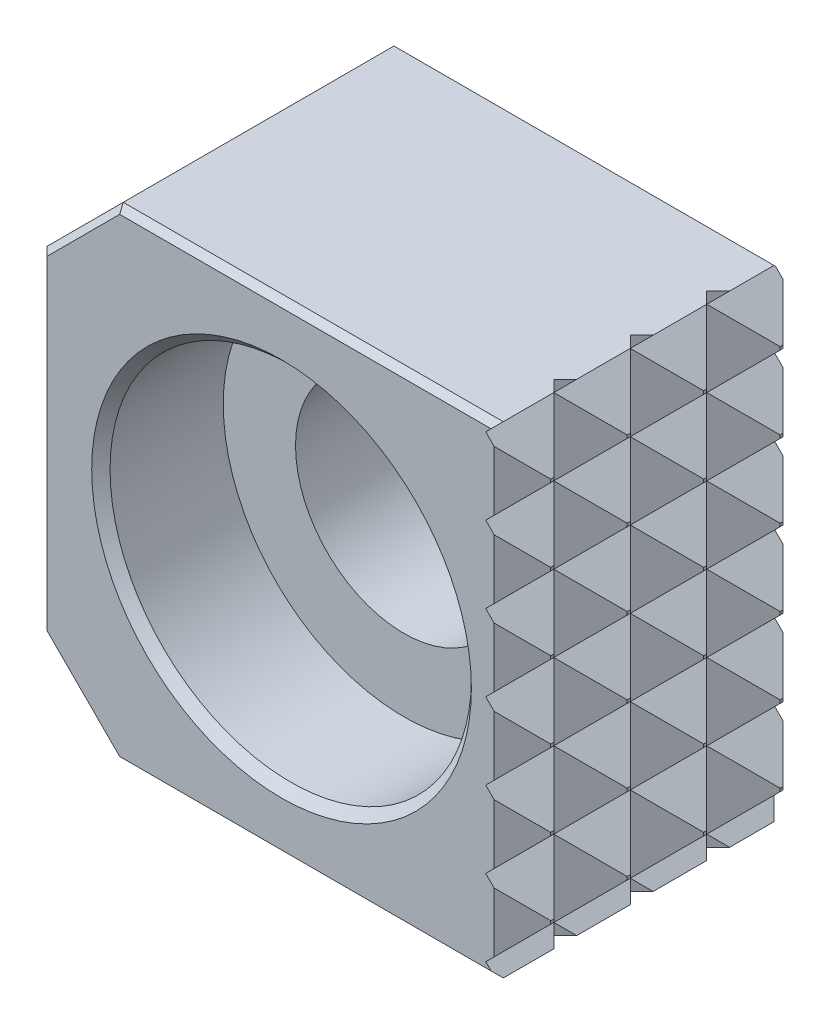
ISO-10303-21;
HEADER;
FILE_DESCRIPTION(('STEP AP214'),'2;1');
FILE_NAME('part.step','',(''),(''),'','','');
FILE_SCHEMA(('AUTOMOTIVE_DESIGN { 1 0 10303 214 1 1 1 1 }'));
ENDSEC;
DATA;
#1=APPLICATION_CONTEXT('core data for automotive mechanical design processes');
#2=APPLICATION_PROTOCOL_DEFINITION('international standard','automotive_design',2000,#1);
#3=PRODUCT_CONTEXT('',#1,'mechanical');
#4=PRODUCT('Part','Part','',(#3));
#5=PRODUCT_RELATED_PRODUCT_CATEGORY('part','',(#4));
#6=PRODUCT_DEFINITION_FORMATION('','',#4);
#7=PRODUCT_DEFINITION_CONTEXT('part definition',#1,'design');
#8=PRODUCT_DEFINITION('design','',#6,#7);
#9=PRODUCT_DEFINITION_SHAPE('','',#8);
#10=(LENGTH_UNIT() NAMED_UNIT(*) SI_UNIT(.MILLI.,.METRE.));
#11=(NAMED_UNIT(*) PLANE_ANGLE_UNIT() SI_UNIT($,.RADIAN.));
#12=(NAMED_UNIT(*) SI_UNIT($,.STERADIAN.) SOLID_ANGLE_UNIT());
#13=UNCERTAINTY_MEASURE_WITH_UNIT(LENGTH_MEASURE(1.E-05),#10,'distance_accuracy_value','');
#14=(GEOMETRIC_REPRESENTATION_CONTEXT(3) GLOBAL_UNCERTAINTY_ASSIGNED_CONTEXT((#13)) GLOBAL_UNIT_ASSIGNED_CONTEXT((#10,
#11,#12)) REPRESENTATION_CONTEXT('',''));
#15=CARTESIAN_POINT('',(0.,0.,0.));
#16=DIRECTION('',(0.,0.,1.));
#17=DIRECTION('',(1.,0.,0.));
#18=AXIS2_PLACEMENT_3D('',#15,#16,#17);
#19=CARTESIAN_POINT('',(10.,-10.,12.));
#20=DIRECTION('',(-1.,0.,0.));
#21=DIRECTION('',(0.,-1.,0.));
#22=AXIS2_PLACEMENT_3D('',#19,#20,#21);
#23=PLANE('',#22);
#24=DIRECTION('',(0.,-1.,0.));
#25=VECTOR('',#24,1.);
#26=CARTESIAN_POINT('',(10.,-10.,7.52399999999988));
#27=LINE('',#26,#25);
#28=CARTESIAN_POINT('',(10.,-1.52399985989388,7.52399999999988));
#29=VERTEX_POINT('',#28);
#30=CARTESIAN_POINT('',(10.,-1.65099985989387,7.52399999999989));
#31=VERTEX_POINT('',#30);
#32=EDGE_CURVE('E1043',#29,#31,#27,.T.);
#33=ORIENTED_EDGE('',*,*,#32,.F.);
#34=DIRECTION('',(0.,0.,-1.));
#35=VECTOR('',#34,1.);
#36=CARTESIAN_POINT('',(10.,-1.52399985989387,12.));
#37=LINE('',#36,#35);
#38=CARTESIAN_POINT('',(10.,-1.52399985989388,7.65099999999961));
#39=VERTEX_POINT('',#38);
#40=EDGE_CURVE('E1516',#39,#29,#37,.T.);
#41=ORIENTED_EDGE('',*,*,#40,.F.);
#42=DIRECTION('',(0.,1.,0.));
#43=VECTOR('',#42,1.);
#44=CARTESIAN_POINT('',(10.,-10.,7.65099999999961));
#45=LINE('',#44,#43);
#46=CARTESIAN_POINT('',(10.,-1.65099985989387,7.65099999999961));
#47=VERTEX_POINT('',#46);
#48=EDGE_CURVE('E998',#47,#39,#45,.T.);
#49=ORIENTED_EDGE('',*,*,#48,.F.);
#50=DIRECTION('',(0.,0.,1.));
#51=VECTOR('',#50,1.);
#52=CARTESIAN_POINT('',(10.,-1.65099985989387,12.));
#53=LINE('',#52,#51);
#54=EDGE_CURVE('E1237',#31,#47,#53,.T.);
#55=ORIENTED_EDGE('',*,*,#54,.F.);
#56=EDGE_LOOP('',(#33,#41,#49,#55));
#57=FACE_BOUND('',#56,.T.);
#58=ADVANCED_FACE('F14',(#57),#23,.F.);
#59=DIRECTION('',(0.,-1.,0.));
#60=VECTOR('',#59,1.);
#61=CARTESIAN_POINT('',(10.,-10.,10.6989999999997));
#62=LINE('',#61,#60);
#63=CARTESIAN_POINT('',(10.,-1.52399985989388,10.6989999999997));
#64=VERTEX_POINT('',#63);
#65=CARTESIAN_POINT('',(10.,-1.65099985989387,10.6989999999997));
#66=VERTEX_POINT('',#65);
#67=EDGE_CURVE('E952',#64,#66,#62,.T.);
#68=ORIENTED_EDGE('',*,*,#67,.F.);
#69=CARTESIAN_POINT('',(10.,-1.52399985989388,10.8259999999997));
#70=VERTEX_POINT('',#69);
#71=EDGE_CURVE('E1243',#70,#64,#37,.T.);
#72=ORIENTED_EDGE('',*,*,#71,.F.);
#73=DIRECTION('',(0.,1.,0.));
#74=VECTOR('',#73,1.);
#75=CARTESIAN_POINT('',(10.,-10.,10.8259999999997));
#76=LINE('',#75,#74);
#77=CARTESIAN_POINT('',(10.,-1.65099985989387,10.8259999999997));
#78=VERTEX_POINT('',#77);
#79=EDGE_CURVE('E913',#78,#70,#76,.T.);
#80=ORIENTED_EDGE('',*,*,#79,.F.);
#81=EDGE_CURVE('E1234',#66,#78,#53,.T.);
#82=ORIENTED_EDGE('',*,*,#81,.F.);
#83=EDGE_LOOP('',(#68,#72,#80,#82));
#84=FACE_BOUND('',#83,.T.);
#85=ADVANCED_FACE('F1527',(#84),#23,.F.);
#86=CARTESIAN_POINT('',(10.,-1.65099985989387,1.17400000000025));
#87=VERTEX_POINT('',#86);
#88=CARTESIAN_POINT('',(10.,-1.65099985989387,1.30100000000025));
#89=VERTEX_POINT('',#88);
#90=EDGE_CURVE('E1238',#87,#89,#53,.T.);
#91=ORIENTED_EDGE('',*,*,#90,.F.);
#92=DIRECTION('',(0.,1.,0.));
#93=VECTOR('',#92,1.);
#94=CARTESIAN_POINT('',(10.,-10.,1.17400000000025));
#95=LINE('',#94,#93);
#96=CARTESIAN_POINT('',(10.,-1.52399985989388,1.17400000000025));
#97=VERTEX_POINT('',#96);
#98=EDGE_CURVE('E859',#87,#97,#95,.T.);
#99=ORIENTED_EDGE('',*,*,#98,.T.);
#100=CARTESIAN_POINT('',(10.,-1.52399985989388,1.30100000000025));
#101=VERTEX_POINT('',#100);
#102=EDGE_CURVE('E1239',#101,#97,#37,.T.);
#103=ORIENTED_EDGE('',*,*,#102,.F.);
#104=DIRECTION('',(0.,-1.,0.));
#105=VECTOR('',#104,1.);
#106=CARTESIAN_POINT('',(10.,-10.,1.30100000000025));
#107=LINE('',#106,#105);
#108=EDGE_CURVE('E799',#101,#89,#107,.T.);
#109=ORIENTED_EDGE('',*,*,#108,.T.);
#110=EDGE_LOOP('',(#91,#99,#103,#109));
#111=FACE_BOUND('',#110,.T.);
#112=ADVANCED_FACE('F1759',(#111),#23,.F.);
#113=DIRECTION('',(0.,-1.,0.));
#114=VECTOR('',#113,1.);
#115=CARTESIAN_POINT('',(10.,-10.,7.52399999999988));
#116=LINE('',#115,#114);
#117=CARTESIAN_POINT('',(10.,-4.69899985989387,7.52399999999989));
#118=VERTEX_POINT('',#117);
#119=CARTESIAN_POINT('',(10.,-4.82599985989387,7.52399999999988));
#120=VERTEX_POINT('',#119);
#121=EDGE_CURVE('E1041',#118,#120,#116,.T.);
#122=ORIENTED_EDGE('',*,*,#121,.F.);
#123=DIRECTION('',(0.,0.,-1.));
#124=VECTOR('',#123,1.);
#125=CARTESIAN_POINT('',(10.,-4.69899985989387,12.));
#126=LINE('',#125,#124);
#127=CARTESIAN_POINT('',(10.,-4.69899985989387,7.65099999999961));
#128=VERTEX_POINT('',#127);
#129=EDGE_CURVE('E1698',#128,#118,#126,.T.);
#130=ORIENTED_EDGE('',*,*,#129,.F.);
#131=DIRECTION('',(0.,1.,0.));
#132=VECTOR('',#131,1.);
#133=CARTESIAN_POINT('',(10.,-10.,7.65099999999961));
#134=LINE('',#133,#132);
#135=CARTESIAN_POINT('',(10.,-4.82599985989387,7.65099999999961));
#136=VERTEX_POINT('',#135);
#137=EDGE_CURVE('E996',#136,#128,#134,.T.);
#138=ORIENTED_EDGE('',*,*,#137,.F.);
#139=DIRECTION('',(0.,0.,1.));
#140=VECTOR('',#139,1.);
#141=CARTESIAN_POINT('',(10.,-4.82599985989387,12.));
#142=LINE('',#141,#140);
#143=EDGE_CURVE('E1227',#120,#136,#142,.T.);
#144=ORIENTED_EDGE('',*,*,#143,.F.);
#145=EDGE_LOOP('',(#122,#130,#138,#144));
#146=FACE_BOUND('',#145,.T.);
#147=ADVANCED_FACE('F1697',(#146),#23,.F.);
#148=DIRECTION('',(0.,-1.,0.));
#149=VECTOR('',#148,1.);
#150=CARTESIAN_POINT('',(10.,-10.,10.6989999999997));
#151=LINE('',#150,#149);
#152=CARTESIAN_POINT('',(10.,-4.69899985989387,10.6989999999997));
#153=VERTEX_POINT('',#152);
#154=CARTESIAN_POINT('',(10.,-4.82599985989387,10.6989999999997));
#155=VERTEX_POINT('',#154);
#156=EDGE_CURVE('E950',#153,#155,#151,.T.);
#157=ORIENTED_EDGE('',*,*,#156,.F.);
#158=CARTESIAN_POINT('',(10.,-4.69899985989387,10.8259999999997));
#159=VERTEX_POINT('',#158);
#160=EDGE_CURVE('E1233',#159,#153,#126,.T.);
#161=ORIENTED_EDGE('',*,*,#160,.F.);
#162=DIRECTION('',(0.,1.,0.));
#163=VECTOR('',#162,1.);
#164=CARTESIAN_POINT('',(10.,-10.,10.8259999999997));
#165=LINE('',#164,#163);
#166=CARTESIAN_POINT('',(10.,-4.82599985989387,10.8259999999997));
#167=VERTEX_POINT('',#166);
#168=EDGE_CURVE('E903',#167,#159,#165,.T.);
#169=ORIENTED_EDGE('',*,*,#168,.F.);
#170=EDGE_CURVE('E1224',#155,#167,#142,.T.);
#171=ORIENTED_EDGE('',*,*,#170,.F.);
#172=EDGE_LOOP('',(#157,#161,#169,#171));
#173=FACE_BOUND('',#172,.T.);
#174=ADVANCED_FACE('F1708',(#173),#23,.F.);
#175=CARTESIAN_POINT('',(10.,-4.82599985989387,1.17400000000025));
#176=VERTEX_POINT('',#175);
#177=CARTESIAN_POINT('',(10.,-4.82599985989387,1.30100000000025));
#178=VERTEX_POINT('',#177);
#179=EDGE_CURVE('E1228',#176,#178,#142,.T.);
#180=ORIENTED_EDGE('',*,*,#179,.F.);
#181=DIRECTION('',(0.,1.,0.));
#182=VECTOR('',#181,1.);
#183=CARTESIAN_POINT('',(10.,-10.,1.17400000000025));
#184=LINE('',#183,#182);
#185=CARTESIAN_POINT('',(10.,-4.69899985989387,1.17400000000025));
#186=VERTEX_POINT('',#185);
#187=EDGE_CURVE('E850',#176,#186,#184,.T.);
#188=ORIENTED_EDGE('',*,*,#187,.T.);
#189=CARTESIAN_POINT('',(10.,-4.69899985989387,1.30100000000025));
#190=VERTEX_POINT('',#189);
#191=EDGE_CURVE('E1229',#190,#186,#126,.T.);
#192=ORIENTED_EDGE('',*,*,#191,.F.);
#193=DIRECTION('',(0.,-1.,0.));
#194=VECTOR('',#193,1.);
#195=CARTESIAN_POINT('',(10.,-10.,1.30100000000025));
#196=LINE('',#195,#194);
#197=EDGE_CURVE('E796',#190,#178,#196,.T.);
#198=ORIENTED_EDGE('',*,*,#197,.T.);
#199=EDGE_LOOP('',(#180,#188,#192,#198));
#200=FACE_BOUND('',#199,.T.);
#201=ADVANCED_FACE('F1685',(#200),#23,.F.);
#202=DIRECTION('',(0.,-1.,0.));
#203=VECTOR('',#202,1.);
#204=CARTESIAN_POINT('',(10.,-10.,7.52399999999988));
#205=LINE('',#204,#203);
#206=CARTESIAN_POINT('',(10.,-7.87399985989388,7.52399999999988));
#207=VERTEX_POINT('',#206);
#208=CARTESIAN_POINT('',(10.,-8.00099985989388,7.52399999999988));
#209=VERTEX_POINT('',#208);
#210=EDGE_CURVE('E1059',#207,#209,#205,.T.);
#211=ORIENTED_EDGE('',*,*,#210,.F.);
#212=DIRECTION('',(0.,0.,-1.));
#213=VECTOR('',#212,1.);
#214=CARTESIAN_POINT('',(10.,-7.87399985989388,12.));
#215=LINE('',#214,#213);
#216=CARTESIAN_POINT('',(10.,-7.87399985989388,7.65099999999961));
#217=VERTEX_POINT('',#216);
#218=EDGE_CURVE('E3207',#217,#207,#215,.T.);
#219=ORIENTED_EDGE('',*,*,#218,.F.);
#220=DIRECTION('',(0.,1.,0.));
#221=VECTOR('',#220,1.);
#222=CARTESIAN_POINT('',(10.,-10.,7.65099999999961));
#223=LINE('',#222,#221);
#224=CARTESIAN_POINT('',(10.,-8.00099985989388,7.65099999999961));
#225=VERTEX_POINT('',#224);
#226=EDGE_CURVE('E1013',#225,#217,#223,.T.);
#227=ORIENTED_EDGE('',*,*,#226,.F.);
#228=DIRECTION('',(0.,0.,1.));
#229=VECTOR('',#228,1.);
#230=CARTESIAN_POINT('',(10.,-8.00099985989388,12.));
#231=LINE('',#230,#229);
#232=EDGE_CURVE('E1217',#209,#225,#231,.T.);
#233=ORIENTED_EDGE('',*,*,#232,.F.);
#234=EDGE_LOOP('',(#211,#219,#227,#233));
#235=FACE_BOUND('',#234,.T.);
#236=ADVANCED_FACE('F2387',(#235),#23,.F.);
#237=DIRECTION('',(0.,-1.,0.));
#238=VECTOR('',#237,1.);
#239=CARTESIAN_POINT('',(10.,-10.,10.6989999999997));
#240=LINE('',#239,#238);
#241=CARTESIAN_POINT('',(10.,-7.87399985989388,10.6989999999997));
#242=VERTEX_POINT('',#241);
#243=CARTESIAN_POINT('',(10.,-8.00099985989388,10.6989999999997));
#244=VERTEX_POINT('',#243);
#245=EDGE_CURVE('E968',#242,#244,#240,.T.);
#246=ORIENTED_EDGE('',*,*,#245,.F.);
#247=CARTESIAN_POINT('',(10.,-7.87399985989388,10.8259999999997));
#248=VERTEX_POINT('',#247);
#249=EDGE_CURVE('E1223',#248,#242,#215,.T.);
#250=ORIENTED_EDGE('',*,*,#249,.F.);
#251=DIRECTION('',(0.,1.,0.));
#252=VECTOR('',#251,1.);
#253=CARTESIAN_POINT('',(10.,-10.,10.8259999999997));
#254=LINE('',#253,#252);
#255=CARTESIAN_POINT('',(10.,-8.00099985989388,10.8259999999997));
#256=VERTEX_POINT('',#255);
#257=EDGE_CURVE('E922',#256,#248,#254,.T.);
#258=ORIENTED_EDGE('',*,*,#257,.F.);
#259=EDGE_CURVE('E1214',#244,#256,#231,.T.);
#260=ORIENTED_EDGE('',*,*,#259,.F.);
#261=EDGE_LOOP('',(#246,#250,#258,#260));
#262=FACE_BOUND('',#261,.T.);
#263=ADVANCED_FACE('F1722',(#262),#23,.F.);
#264=CARTESIAN_POINT('',(10.,-8.00099985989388,1.17400000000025));
#265=VERTEX_POINT('',#264);
#266=CARTESIAN_POINT('',(10.,-8.00099985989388,1.30100000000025));
#267=VERTEX_POINT('',#266);
#268=EDGE_CURVE('E1218',#265,#267,#231,.T.);
#269=ORIENTED_EDGE('',*,*,#268,.F.);
#270=DIRECTION('',(0.,1.,0.));
#271=VECTOR('',#270,1.);
#272=CARTESIAN_POINT('',(10.,-10.,1.17400000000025));
#273=LINE('',#272,#271);
#274=CARTESIAN_POINT('',(10.,-7.87399985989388,1.17400000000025));
#275=VERTEX_POINT('',#274);
#276=EDGE_CURVE('E867',#265,#275,#273,.T.);
#277=ORIENTED_EDGE('',*,*,#276,.T.);
#278=CARTESIAN_POINT('',(10.,-7.87399985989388,1.30100000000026));
#279=VERTEX_POINT('',#278);
#280=EDGE_CURVE('E1219',#279,#275,#215,.T.);
#281=ORIENTED_EDGE('',*,*,#280,.F.);
#282=DIRECTION('',(0.,-1.,0.));
#283=VECTOR('',#282,1.);
#284=CARTESIAN_POINT('',(10.,-10.,1.30100000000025));
#285=LINE('',#284,#283);
#286=EDGE_CURVE('E816',#279,#267,#285,.T.);
#287=ORIENTED_EDGE('',*,*,#286,.T.);
#288=EDGE_LOOP('',(#269,#277,#281,#287));
#289=FACE_BOUND('',#288,.T.);
#290=ADVANCED_FACE('F1635',(#289),#23,.F.);
#291=DIRECTION('',(0.,-1.,0.));
#292=VECTOR('',#291,1.);
#293=CARTESIAN_POINT('',(10.,-10.,7.52399999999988));
#294=LINE('',#293,#292);
#295=CARTESIAN_POINT('',(10.,8.00099985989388,7.52399999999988));
#296=VERTEX_POINT('',#295);
#297=CARTESIAN_POINT('',(10.,7.87399985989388,7.52399999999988));
#298=VERTEX_POINT('',#297);
#299=EDGE_CURVE('E1079',#296,#298,#294,.T.);
#300=ORIENTED_EDGE('',*,*,#299,.F.);
#301=DIRECTION('',(0.,0.,1.));
#302=VECTOR('',#301,1.);
#303=CARTESIAN_POINT('',(10.,8.00099985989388,12.));
#304=LINE('',#303,#302);
#305=CARTESIAN_POINT('',(10.,8.00099985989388,7.65099999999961));
#306=VERTEX_POINT('',#305);
#307=EDGE_CURVE('E1203',#296,#306,#304,.T.);
#308=ORIENTED_EDGE('',*,*,#307,.T.);
#309=DIRECTION('',(0.,1.,0.));
#310=VECTOR('',#309,1.);
#311=CARTESIAN_POINT('',(10.,-10.,7.65099999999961));
#312=LINE('',#311,#310);
#313=CARTESIAN_POINT('',(10.,7.87399985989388,7.65099999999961));
#314=VERTEX_POINT('',#313);
#315=EDGE_CURVE('E1031',#314,#306,#312,.T.);
#316=ORIENTED_EDGE('',*,*,#315,.F.);
#317=DIRECTION('',(0.,0.,-1.));
#318=VECTOR('',#317,1.);
#319=CARTESIAN_POINT('',(10.,7.87399985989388,12.));
#320=LINE('',#319,#318);
#321=EDGE_CURVE('E2062',#314,#298,#320,.T.);
#322=ORIENTED_EDGE('',*,*,#321,.T.);
#323=EDGE_LOOP('',(#300,#308,#316,#322));
#324=FACE_BOUND('',#323,.T.);
#325=ADVANCED_FACE('F2079',(#324),#23,.F.);
#326=DIRECTION('',(0.,-1.,0.));
#327=VECTOR('',#326,1.);
#328=CARTESIAN_POINT('',(10.,-10.,10.6989999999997));
#329=LINE('',#328,#327);
#330=CARTESIAN_POINT('',(10.,8.00099985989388,10.6989999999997));
#331=VERTEX_POINT('',#330);
#332=CARTESIAN_POINT('',(10.,7.87399985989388,10.6989999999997));
#333=VERTEX_POINT('',#332);
#334=EDGE_CURVE('E986',#331,#333,#329,.T.);
#335=ORIENTED_EDGE('',*,*,#334,.F.);
#336=CARTESIAN_POINT('',(10.,8.00099985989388,10.8259999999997));
#337=VERTEX_POINT('',#336);
#338=EDGE_CURVE('E1200',#331,#337,#304,.T.);
#339=ORIENTED_EDGE('',*,*,#338,.T.);
#340=DIRECTION('',(0.,1.,0.));
#341=VECTOR('',#340,1.);
#342=CARTESIAN_POINT('',(10.,-10.,10.8259999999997));
#343=LINE('',#342,#341);
#344=CARTESIAN_POINT('',(10.,7.87399985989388,10.8259999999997));
#345=VERTEX_POINT('',#344);
#346=EDGE_CURVE('E930',#345,#337,#343,.T.);
#347=ORIENTED_EDGE('',*,*,#346,.F.);
#348=EDGE_CURVE('E1199',#345,#333,#320,.T.);
#349=ORIENTED_EDGE('',*,*,#348,.T.);
#350=EDGE_LOOP('',(#335,#339,#347,#349));
#351=FACE_BOUND('',#350,.T.);
#352=ADVANCED_FACE('F2069',(#351),#23,.F.);
#353=CARTESIAN_POINT('',(10.,7.87399985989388,1.30100000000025));
#354=VERTEX_POINT('',#353);
#355=CARTESIAN_POINT('',(10.,7.87399985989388,1.17400000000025));
#356=VERTEX_POINT('',#355);
#357=EDGE_CURVE('E1195',#354,#356,#320,.T.);
#358=ORIENTED_EDGE('',*,*,#357,.T.);
#359=DIRECTION('',(0.,1.,0.));
#360=VECTOR('',#359,1.);
#361=CARTESIAN_POINT('',(10.,-10.,1.17400000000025));
#362=LINE('',#361,#360);
#363=CARTESIAN_POINT('',(10.,8.00099985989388,1.17400000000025));
#364=VERTEX_POINT('',#363);
#365=EDGE_CURVE('E876',#356,#364,#362,.T.);
#366=ORIENTED_EDGE('',*,*,#365,.T.);
#367=CARTESIAN_POINT('',(10.,8.00099985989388,1.30100000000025));
#368=VERTEX_POINT('',#367);
#369=EDGE_CURVE('E1204',#364,#368,#304,.T.);
#370=ORIENTED_EDGE('',*,*,#369,.T.);
#371=DIRECTION('',(0.,-1.,0.));
#372=VECTOR('',#371,1.);
#373=CARTESIAN_POINT('',(10.,-10.,1.30100000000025));
#374=LINE('',#373,#372);
#375=EDGE_CURVE('E839',#368,#354,#374,.T.);
#376=ORIENTED_EDGE('',*,*,#375,.T.);
#377=EDGE_LOOP('',(#358,#366,#370,#376));
#378=FACE_BOUND('',#377,.T.);
#379=ADVANCED_FACE('F1416',(#378),#23,.F.);
#380=DIRECTION('',(0.,-1.,0.));
#381=VECTOR('',#380,1.);
#382=CARTESIAN_POINT('',(10.,-10.,7.52399999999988));
#383=LINE('',#382,#381);
#384=CARTESIAN_POINT('',(10.,4.82599985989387,7.52399999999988));
#385=VERTEX_POINT('',#384);
#386=CARTESIAN_POINT('',(10.,4.69899985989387,7.52399999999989));
#387=VERTEX_POINT('',#386);
#388=EDGE_CURVE('E1072',#385,#387,#383,.T.);
#389=ORIENTED_EDGE('',*,*,#388,.F.);
#390=DIRECTION('',(0.,0.,1.));
#391=VECTOR('',#390,1.);
#392=CARTESIAN_POINT('',(10.,4.82599985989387,12.));
#393=LINE('',#392,#391);
#394=CARTESIAN_POINT('',(10.,4.82599985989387,7.65099999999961));
#395=VERTEX_POINT('',#394);
#396=EDGE_CURVE('E1193',#385,#395,#393,.T.);
#397=ORIENTED_EDGE('',*,*,#396,.T.);
#398=DIRECTION('',(0.,1.,0.));
#399=VECTOR('',#398,1.);
#400=CARTESIAN_POINT('',(10.,-10.,7.65099999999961));
#401=LINE('',#400,#399);
#402=CARTESIAN_POINT('',(10.,4.69899985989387,7.65099999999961));
#403=VERTEX_POINT('',#402);
#404=EDGE_CURVE('E1024',#403,#395,#401,.T.);
#405=ORIENTED_EDGE('',*,*,#404,.F.);
#406=DIRECTION('',(0.,0.,-1.));
#407=VECTOR('',#406,1.);
#408=CARTESIAN_POINT('',(10.,4.69899985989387,12.));
#409=LINE('',#408,#407);
#410=EDGE_CURVE('E1781',#403,#387,#409,.T.);
#411=ORIENTED_EDGE('',*,*,#410,.T.);
#412=EDGE_LOOP('',(#389,#397,#405,#411));
#413=FACE_BOUND('',#412,.T.);
#414=ADVANCED_FACE('F1984',(#413),#23,.F.);
#415=DIRECTION('',(0.,-1.,0.));
#416=VECTOR('',#415,1.);
#417=CARTESIAN_POINT('',(10.,-10.,10.6989999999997));
#418=LINE('',#417,#416);
#419=CARTESIAN_POINT('',(10.,4.82599985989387,10.6989999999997));
#420=VERTEX_POINT('',#419);
#421=CARTESIAN_POINT('',(10.,4.69899985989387,10.6989999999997));
#422=VERTEX_POINT('',#421);
#423=EDGE_CURVE('E979',#420,#422,#418,.T.);
#424=ORIENTED_EDGE('',*,*,#423,.F.);
#425=CARTESIAN_POINT('',(10.,4.82599985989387,10.8259999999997));
#426=VERTEX_POINT('',#425);
#427=EDGE_CURVE('E1190',#420,#426,#393,.T.);
#428=ORIENTED_EDGE('',*,*,#427,.T.);
#429=DIRECTION('',(0.,1.,0.));
#430=VECTOR('',#429,1.);
#431=CARTESIAN_POINT('',(10.,-10.,10.8259999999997));
#432=LINE('',#431,#430);
#433=CARTESIAN_POINT('',(10.,4.69899985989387,10.8259999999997));
#434=VERTEX_POINT('',#433);
#435=EDGE_CURVE('E937',#434,#426,#432,.T.);
#436=ORIENTED_EDGE('',*,*,#435,.F.);
#437=EDGE_CURVE('E1189',#434,#422,#409,.T.);
#438=ORIENTED_EDGE('',*,*,#437,.T.);
#439=EDGE_LOOP('',(#424,#428,#436,#438));
#440=FACE_BOUND('',#439,.T.);
#441=ADVANCED_FACE('F1790',(#440),#23,.F.);
#442=CARTESIAN_POINT('',(10.,4.69899985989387,1.30100000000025));
#443=VERTEX_POINT('',#442);
#444=CARTESIAN_POINT('',(10.,4.69899985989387,1.17400000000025));
#445=VERTEX_POINT('',#444);
#446=EDGE_CURVE('E1185',#443,#445,#409,.T.);
#447=ORIENTED_EDGE('',*,*,#446,.T.);
#448=DIRECTION('',(0.,1.,0.));
#449=VECTOR('',#448,1.);
#450=CARTESIAN_POINT('',(10.,-10.,1.17400000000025));
#451=LINE('',#450,#449);
#452=CARTESIAN_POINT('',(10.,4.82599985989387,1.17400000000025));
#453=VERTEX_POINT('',#452);
#454=EDGE_CURVE('E886',#445,#453,#451,.T.);
#455=ORIENTED_EDGE('',*,*,#454,.T.);
#456=CARTESIAN_POINT('',(10.,4.82599985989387,1.30100000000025));
#457=VERTEX_POINT('',#456);
#458=EDGE_CURVE('E1194',#453,#457,#393,.T.);
#459=ORIENTED_EDGE('',*,*,#458,.T.);
#460=DIRECTION('',(0.,-1.,0.));
#461=VECTOR('',#460,1.);
#462=CARTESIAN_POINT('',(10.,-10.,1.30100000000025));
#463=LINE('',#462,#461);
#464=EDGE_CURVE('E830',#457,#443,#463,.T.);
#465=ORIENTED_EDGE('',*,*,#464,.T.);
#466=EDGE_LOOP('',(#447,#455,#459,#465));
#467=FACE_BOUND('',#466,.T.);
#468=ADVANCED_FACE('F1987',(#467),#23,.F.);
#469=CARTESIAN_POINT('',(10.,-10.,12.));
#470=DIRECTION('',(0.,-1.,0.));
#471=DIRECTION('',(1.,0.,0.));
#472=AXIS2_PLACEMENT_3D('',#469,#470,#471);
#473=PLANE('',#472);
#474=DIRECTION('',(0.,0.,1.));
#475=VECTOR('',#474,1.);
#476=CARTESIAN_POINT('',(8.95100004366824,-10.,12.));
#477=LINE('',#476,#475);
#478=CARTESIAN_POINT('',(8.95100004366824,-10.,9.65000004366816));
#479=VERTEX_POINT('',#478);
#480=CARTESIAN_POINT('',(8.95100004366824,-10.,11.746));
#481=VERTEX_POINT('',#480);
#482=EDGE_CURVE('E1210',#479,#481,#477,.T.);
#483=ORIENTED_EDGE('',*,*,#482,.T.);
#484=DIRECTION('',(-1.,0.,0.));
#485=VECTOR('',#484,1.);
#486=CARTESIAN_POINT('',(-6.825,-10.,11.746));
#487=LINE('',#486,#485);
#488=CARTESIAN_POINT('',(-6.825,-10.,11.746));
#489=VERTEX_POINT('',#488);
#490=EDGE_CURVE('E1338',#481,#489,#487,.T.);
#491=ORIENTED_EDGE('',*,*,#490,.T.);
#492=DIRECTION('',(0.,0.,-1.));
#493=VECTOR('',#492,1.);
#494=CARTESIAN_POINT('',(-6.825,-10.,0.));
#495=LINE('',#494,#493);
#496=CARTESIAN_POINT('',(-6.825,-10.,0.508));
#497=VERTEX_POINT('',#496);
#498=EDGE_CURVE('E1286',#489,#497,#495,.T.);
#499=ORIENTED_EDGE('',*,*,#498,.T.);
#500=DIRECTION('',(1.,0.,0.));
#501=VECTOR('',#500,1.);
#502=CARTESIAN_POINT('',(10.,-10.,0.508));
#503=LINE('',#502,#501);
#504=CARTESIAN_POINT('',(8.95100004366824,-10.,0.508));
#505=VERTEX_POINT('',#504);
#506=EDGE_CURVE('E1318',#497,#505,#503,.T.);
#507=ORIENTED_EDGE('',*,*,#506,.T.);
#508=CARTESIAN_POINT('',(8.95100004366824,-10.,2.34999995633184));
#509=VERTEX_POINT('',#508);
#510=EDGE_CURVE('E1212',#505,#509,#477,.T.);
#511=ORIENTED_EDGE('',*,*,#510,.T.);
#512=DIRECTION('',(0.707106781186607,0.,-0.707106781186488));
#513=VECTOR('',#512,1.);
#514=CARTESIAN_POINT('',(8.476,-10.,2.825));
#515=LINE('',#514,#513);
#516=CARTESIAN_POINT('',(8.476,-10.,2.825));
#517=VERTEX_POINT('',#516);
#518=EDGE_CURVE('E643',#517,#509,#515,.T.);
#519=ORIENTED_EDGE('',*,*,#518,.F.);
#520=DIRECTION('',(-0.707106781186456,0.,-0.707106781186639));
#521=VECTOR('',#520,1.);
#522=CARTESIAN_POINT('',(10.0634999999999,-10.,4.41250000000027));
#523=LINE('',#522,#521);
#524=CARTESIAN_POINT('',(8.95100004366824,-10.,3.30000004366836));
#525=VERTEX_POINT('',#524);
#526=EDGE_CURVE('E658',#525,#517,#523,.T.);
#527=ORIENTED_EDGE('',*,*,#526,.F.);
#528=CARTESIAN_POINT('',(8.95100004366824,-10.,5.5249999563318));
#529=VERTEX_POINT('',#528);
#530=EDGE_CURVE('E1213',#525,#529,#477,.T.);
#531=ORIENTED_EDGE('',*,*,#530,.T.);
#532=DIRECTION('',(0.707106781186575,0.,-0.70710678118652));
#533=VECTOR('',#532,1.);
#534=CARTESIAN_POINT('',(8.476,-10.,6.));
#535=LINE('',#534,#533);
#536=CARTESIAN_POINT('',(8.476,-10.,6.));
#537=VERTEX_POINT('',#536);
#538=EDGE_CURVE('E661',#537,#529,#535,.T.);
#539=ORIENTED_EDGE('',*,*,#538,.F.);
#540=DIRECTION('',(0.707106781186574,0.,0.707106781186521));
#541=VECTOR('',#540,1.);
#542=CARTESIAN_POINT('',(8.476,-10.,6.));
#543=LINE('',#542,#541);
#544=CARTESIAN_POINT('',(8.95100004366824,-10.,6.4750000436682));
#545=VERTEX_POINT('',#544);
#546=EDGE_CURVE('E650',#537,#545,#543,.T.);
#547=ORIENTED_EDGE('',*,*,#546,.T.);
#548=CARTESIAN_POINT('',(8.95100004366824,-10.,8.69999995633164));
#549=VERTEX_POINT('',#548);
#550=EDGE_CURVE('E649',#545,#549,#477,.T.);
#551=ORIENTED_EDGE('',*,*,#550,.T.);
#552=DIRECTION('',(-0.707106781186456,0.,0.707106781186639));
#553=VECTOR('',#552,1.);
#554=CARTESIAN_POINT('',(10.0634999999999,-10.,7.58749999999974));
#555=LINE('',#554,#553);
#556=CARTESIAN_POINT('',(8.476,-10.,9.175));
#557=VERTEX_POINT('',#556);
#558=EDGE_CURVE('E626',#549,#557,#555,.T.);
#559=ORIENTED_EDGE('',*,*,#558,.T.);
#560=DIRECTION('',(0.707106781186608,0.,0.707106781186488));
#561=VECTOR('',#560,1.);
#562=CARTESIAN_POINT('',(8.476,-10.,9.175));
#563=LINE('',#562,#561);
#564=EDGE_CURVE('E636',#557,#479,#563,.T.);
#565=ORIENTED_EDGE('',*,*,#564,.T.);
#566=EDGE_LOOP('',(#483,#491,#499,#507,#511,#519,#527,#531,#539,#547,#551,#559,#565));
#567=FACE_BOUND('',#566,.T.);
#568=ADVANCED_FACE('F646',(#567),#473,.T.);
#569=CARTESIAN_POINT('',(10.,10.,12.));
#570=DIRECTION('',(0.,0.,-1.));
#571=DIRECTION('',(1.,0.,0.));
#572=AXIS2_PLACEMENT_3D('',#569,#570,#571);
#573=PLANE('',#572);
#574=CARTESIAN_POINT('',(0.,0.,12.));
#575=DIRECTION('',(0.,0.,-1.));
#576=DIRECTION('',(1.,0.,0.));
#577=AXIS2_PLACEMENT_3D('',#574,#575,#576);
#578=CIRCLE('',#577,7.881);
#579=CARTESIAN_POINT('',(7.881,0.,12.));
#580=VERTEX_POINT('',#579);
#581=EDGE_CURVE('E1298',#580,#580,#578,.T.);
#582=ORIENTED_EDGE('',*,*,#581,.T.);
#583=EDGE_LOOP('',(#582));
#584=FACE_BOUND('',#583,.T.);
#585=DIRECTION('',(0.707106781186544,-0.707106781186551,0.));
#586=VECTOR('',#585,1.);
#587=CARTESIAN_POINT('',(-6.64539487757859,-9.82039487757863,12.));
#588=LINE('',#587,#586);
#589=CARTESIAN_POINT('',(-9.746,-6.71978975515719,12.));
#590=VERTEX_POINT('',#589);
#591=CARTESIAN_POINT('',(-6.71978975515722,-9.746,12.));
#592=VERTEX_POINT('',#591);
#593=EDGE_CURVE('E1347',#590,#592,#588,.T.);
#594=ORIENTED_EDGE('',*,*,#593,.T.);
#595=DIRECTION('',(1.,0.,0.));
#596=VECTOR('',#595,1.);
#597=CARTESIAN_POINT('',(8.826,-9.746,12.));
#598=LINE('',#597,#596);
#599=CARTESIAN_POINT('',(8.69700002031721,-9.746,12.));
#600=VERTEX_POINT('',#599);
#601=EDGE_CURVE('E1349',#592,#600,#598,.T.);
#602=ORIENTED_EDGE('',*,*,#601,.T.);
#603=DIRECTION('',(0.70710681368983,-0.707106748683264,0.));
#604=VECTOR('',#603,1.);
#605=CARTESIAN_POINT('',(8.476,-9.525,12.));
#606=LINE('',#605,#604);
#607=CARTESIAN_POINT('',(8.476,-9.525,12.));
#608=VERTEX_POINT('',#607);
#609=EDGE_CURVE('E1119',#608,#600,#606,.T.);
#610=ORIENTED_EDGE('',*,*,#609,.F.);
#611=DIRECTION('',(-0.707106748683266,-0.707106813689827,0.));
#612=VECTOR('',#611,1.);
#613=CARTESIAN_POINT('',(10.0635,-7.93749985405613,12.));
#614=LINE('',#613,#612);
#615=CARTESIAN_POINT('',(8.826,-9.17499996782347,12.));
#616=VERTEX_POINT('',#615);
#617=EDGE_CURVE('E1117',#616,#608,#614,.T.);
#618=ORIENTED_EDGE('',*,*,#617,.F.);
#619=DIRECTION('',(0.,-1.,0.));
#620=VECTOR('',#619,1.);
#621=CARTESIAN_POINT('',(8.826,10.,12.));
#622=LINE('',#621,#620);
#623=CARTESIAN_POINT('',(8.826,-6.69999996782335,12.));
#624=VERTEX_POINT('',#623);
#625=EDGE_CURVE('E921',#624,#616,#622,.T.);
#626=ORIENTED_EDGE('',*,*,#625,.F.);
#627=DIRECTION('',(0.707106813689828,-0.707106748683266,0.));
#628=VECTOR('',#627,1.);
#629=CARTESIAN_POINT('',(8.476,-6.35,12.));
#630=LINE('',#629,#628);
#631=CARTESIAN_POINT('',(8.476,-6.35,12.));
#632=VERTEX_POINT('',#631);
#633=EDGE_CURVE('E1114',#632,#624,#630,.T.);
#634=ORIENTED_EDGE('',*,*,#633,.F.);
#635=DIRECTION('',(-0.707106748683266,-0.707106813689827,0.));
#636=VECTOR('',#635,1.);
#637=CARTESIAN_POINT('',(10.0635,-4.76249985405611,12.));
#638=LINE('',#637,#636);
#639=CARTESIAN_POINT('',(8.826,-5.99999996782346,12.));
#640=VERTEX_POINT('',#639);
#641=EDGE_CURVE('E1112',#640,#632,#638,.T.);
#642=ORIENTED_EDGE('',*,*,#641,.F.);
#643=CARTESIAN_POINT('',(8.826,-3.52499996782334,12.));
#644=VERTEX_POINT('',#643);
#645=EDGE_CURVE('E901',#644,#640,#622,.T.);
#646=ORIENTED_EDGE('',*,*,#645,.F.);
#647=DIRECTION('',(0.707106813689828,-0.707106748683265,0.));
#648=VECTOR('',#647,1.);
#649=CARTESIAN_POINT('',(8.476,-3.175,12.));
#650=LINE('',#649,#648);
#651=CARTESIAN_POINT('',(8.476,-3.175,12.));
#652=VERTEX_POINT('',#651);
#653=EDGE_CURVE('E1109',#652,#644,#650,.T.);
#654=ORIENTED_EDGE('',*,*,#653,.F.);
#655=DIRECTION('',(-0.707106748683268,-0.707106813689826,0.));
#656=VECTOR('',#655,1.);
#657=CARTESIAN_POINT('',(10.0635,-1.58749985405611,12.));
#658=LINE('',#657,#656);
#659=CARTESIAN_POINT('',(8.826,-2.82499996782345,12.));
#660=VERTEX_POINT('',#659);
#661=EDGE_CURVE('E1107',#660,#652,#658,.T.);
#662=ORIENTED_EDGE('',*,*,#661,.F.);
#663=CARTESIAN_POINT('',(8.826,-0.34999996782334,12.));
#664=VERTEX_POINT('',#663);
#665=EDGE_CURVE('E905',#664,#660,#622,.T.);
#666=ORIENTED_EDGE('',*,*,#665,.F.);
#667=DIRECTION('',(0.707106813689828,-0.707106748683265,0.));
#668=VECTOR('',#667,1.);
#669=CARTESIAN_POINT('',(8.476,0.,12.));
#670=LINE('',#669,#668);
#671=CARTESIAN_POINT('',(8.476,0.,12.));
#672=VERTEX_POINT('',#671);
#673=EDGE_CURVE('E1104',#672,#664,#670,.T.);
#674=ORIENTED_EDGE('',*,*,#673,.F.);
#675=DIRECTION('',(0.707106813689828,0.707106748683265,0.));
#676=VECTOR('',#675,1.);
#677=CARTESIAN_POINT('',(8.476,0.,12.));
#678=LINE('',#677,#676);
#679=CARTESIAN_POINT('',(8.826,0.34999996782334,12.));
#680=VERTEX_POINT('',#679);
#681=EDGE_CURVE('E1137',#672,#680,#678,.T.);
#682=ORIENTED_EDGE('',*,*,#681,.T.);
#683=CARTESIAN_POINT('',(8.826,2.82499996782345,12.));
#684=VERTEX_POINT('',#683);
#685=EDGE_CURVE('E904',#684,#680,#622,.T.);
#686=ORIENTED_EDGE('',*,*,#685,.F.);
#687=DIRECTION('',(-0.707106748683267,0.707106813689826,0.));
#688=VECTOR('',#687,1.);
#689=CARTESIAN_POINT('',(10.0635,1.58749985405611,12.));
#690=LINE('',#689,#688);
#691=CARTESIAN_POINT('',(8.476,3.175,12.));
#692=VERTEX_POINT('',#691);
#693=EDGE_CURVE('E1135',#684,#692,#690,.T.);
#694=ORIENTED_EDGE('',*,*,#693,.T.);
#695=DIRECTION('',(0.707106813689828,0.707106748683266,0.));
#696=VECTOR('',#695,1.);
#697=CARTESIAN_POINT('',(8.476,3.175,12.));
#698=LINE('',#697,#696);
#699=CARTESIAN_POINT('',(8.826,3.52499996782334,12.));
#700=VERTEX_POINT('',#699);
#701=EDGE_CURVE('E1132',#692,#700,#698,.T.);
#702=ORIENTED_EDGE('',*,*,#701,.T.);
#703=CARTESIAN_POINT('',(8.826,5.99999996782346,12.));
#704=VERTEX_POINT('',#703);
#705=EDGE_CURVE('E936',#704,#700,#622,.T.);
#706=ORIENTED_EDGE('',*,*,#705,.F.);
#707=DIRECTION('',(-0.707106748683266,0.707106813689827,0.));
#708=VECTOR('',#707,1.);
#709=CARTESIAN_POINT('',(10.0635,4.76249985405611,12.));
#710=LINE('',#709,#708);
#711=CARTESIAN_POINT('',(8.476,6.35,12.));
#712=VERTEX_POINT('',#711);
#713=EDGE_CURVE('E1130',#704,#712,#710,.T.);
#714=ORIENTED_EDGE('',*,*,#713,.T.);
#715=DIRECTION('',(0.707106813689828,0.707106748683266,0.));
#716=VECTOR('',#715,1.);
#717=CARTESIAN_POINT('',(8.476,6.35,12.));
#718=LINE('',#717,#716);
#719=CARTESIAN_POINT('',(8.826,6.69999996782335,12.));
#720=VERTEX_POINT('',#719);
#721=EDGE_CURVE('E1127',#712,#720,#718,.T.);
#722=ORIENTED_EDGE('',*,*,#721,.T.);
#723=CARTESIAN_POINT('',(8.826,9.17499996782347,12.));
#724=VERTEX_POINT('',#723);
#725=EDGE_CURVE('E929',#724,#720,#622,.T.);
#726=ORIENTED_EDGE('',*,*,#725,.F.);
#727=DIRECTION('',(-0.707106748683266,0.707106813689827,0.));
#728=VECTOR('',#727,1.);
#729=CARTESIAN_POINT('',(10.0635,7.93749985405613,12.));
#730=LINE('',#729,#728);
#731=CARTESIAN_POINT('',(8.476,9.525,12.));
#732=VERTEX_POINT('',#731);
#733=EDGE_CURVE('E1125',#724,#732,#730,.T.);
#734=ORIENTED_EDGE('',*,*,#733,.T.);
#735=DIRECTION('',(0.70710681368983,0.707106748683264,0.));
#736=VECTOR('',#735,1.);
#737=CARTESIAN_POINT('',(8.476,9.525,12.));
#738=LINE('',#737,#736);
#739=CARTESIAN_POINT('',(8.69700002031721,9.746,12.));
#740=VERTEX_POINT('',#739);
#741=EDGE_CURVE('E1122',#732,#740,#738,.T.);
#742=ORIENTED_EDGE('',*,*,#741,.T.);
#743=DIRECTION('',(-1.,0.,0.));
#744=VECTOR('',#743,1.);
#745=CARTESIAN_POINT('',(-6.825,9.746,12.));
#746=LINE('',#745,#744);
#747=CARTESIAN_POINT('',(-6.71978975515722,9.746,12.));
#748=VERTEX_POINT('',#747);
#749=EDGE_CURVE('E1341',#740,#748,#746,.T.);
#750=ORIENTED_EDGE('',*,*,#749,.T.);
#751=DIRECTION('',(-0.707106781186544,-0.707106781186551,0.));
#752=VECTOR('',#751,1.);
#753=CARTESIAN_POINT('',(-9.82039487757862,6.64539487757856,12.));
#754=LINE('',#753,#752);
#755=CARTESIAN_POINT('',(-9.746,6.71978975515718,12.));
#756=VERTEX_POINT('',#755);
#757=EDGE_CURVE('E1343',#748,#756,#754,.T.);
#758=ORIENTED_EDGE('',*,*,#757,.T.);
#759=DIRECTION('',(0.,-1.,0.));
#760=VECTOR('',#759,1.);
#761=CARTESIAN_POINT('',(-9.746,10.,12.));
#762=LINE('',#761,#760);
#763=EDGE_CURVE('E1345',#756,#590,#762,.T.);
#764=ORIENTED_EDGE('',*,*,#763,.T.);
#765=EDGE_LOOP('',(#594,#602,#610,#618,#626,#634,#642,#646,#654,#662,#666,#674,#682,#686,#694,
#702,#706,#714,#722,#726,#734,#742,#750,#758,#764));
#766=FACE_BOUND('',#765,.T.);
#767=ADVANCED_FACE('F1727',(#584,#766),#573,.F.);
#768=DIRECTION('',(0.,-1.,0.));
#769=VECTOR('',#768,1.);
#770=CARTESIAN_POINT('',(10.,-10.,7.52399999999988));
#771=LINE('',#770,#769);
#772=CARTESIAN_POINT('',(10.,1.65099985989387,7.52399999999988));
#773=VERTEX_POINT('',#772);
#774=CARTESIAN_POINT('',(10.,1.52399985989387,7.52399999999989));
#775=VERTEX_POINT('',#774);
#776=EDGE_CURVE('E1057',#773,#775,#771,.T.);
#777=ORIENTED_EDGE('',*,*,#776,.F.);
#778=DIRECTION('',(0.,0.,1.));
#779=VECTOR('',#778,1.);
#780=CARTESIAN_POINT('',(10.,1.65099985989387,12.));
#781=LINE('',#780,#779);
#782=CARTESIAN_POINT('',(10.,1.65099985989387,7.65099999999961));
#783=VERTEX_POINT('',#782);
#784=EDGE_CURVE('E1183',#773,#783,#781,.T.);
#785=ORIENTED_EDGE('',*,*,#784,.T.);
#786=DIRECTION('',(0.,1.,0.));
#787=VECTOR('',#786,1.);
#788=CARTESIAN_POINT('',(10.,-10.,7.65099999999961));
#789=LINE('',#788,#787);
#790=CARTESIAN_POINT('',(10.,1.52399985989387,7.65099999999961));
#791=VERTEX_POINT('',#790);
#792=EDGE_CURVE('E1011',#791,#783,#789,.T.);
#793=ORIENTED_EDGE('',*,*,#792,.F.);
#794=DIRECTION('',(0.,0.,-1.));
#795=VECTOR('',#794,1.);
#796=CARTESIAN_POINT('',(10.,1.52399985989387,12.));
#797=LINE('',#796,#795);
#798=EDGE_CURVE('E1470',#791,#775,#797,.T.);
#799=ORIENTED_EDGE('',*,*,#798,.T.);
#800=EDGE_LOOP('',(#777,#785,#793,#799));
#801=FACE_BOUND('',#800,.T.);
#802=ADVANCED_FACE('F1467',(#801),#23,.F.);
#803=DIRECTION('',(0.,-1.,0.));
#804=VECTOR('',#803,1.);
#805=CARTESIAN_POINT('',(10.,-10.,10.6989999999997));
#806=LINE('',#805,#804);
#807=CARTESIAN_POINT('',(10.,1.65099985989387,10.6989999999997));
#808=VERTEX_POINT('',#807);
#809=CARTESIAN_POINT('',(10.,1.52399985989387,10.6989999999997));
#810=VERTEX_POINT('',#809);
#811=EDGE_CURVE('E966',#808,#810,#806,.T.);
#812=ORIENTED_EDGE('',*,*,#811,.F.);
#813=CARTESIAN_POINT('',(10.,1.65099985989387,10.8259999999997));
#814=VERTEX_POINT('',#813);
#815=EDGE_CURVE('E1180',#808,#814,#781,.T.);
#816=ORIENTED_EDGE('',*,*,#815,.T.);
#817=DIRECTION('',(0.,1.,0.));
#818=VECTOR('',#817,1.);
#819=CARTESIAN_POINT('',(10.,-10.,10.8259999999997));
#820=LINE('',#819,#818);
#821=CARTESIAN_POINT('',(10.,1.52399985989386,10.8259999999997));
#822=VERTEX_POINT('',#821);
#823=EDGE_CURVE('E943',#822,#814,#820,.T.);
#824=ORIENTED_EDGE('',*,*,#823,.F.);
#825=EDGE_CURVE('E1179',#822,#810,#797,.T.);
#826=ORIENTED_EDGE('',*,*,#825,.T.);
#827=EDGE_LOOP('',(#812,#816,#824,#826));
#828=FACE_BOUND('',#827,.T.);
#829=ADVANCED_FACE('F1995',(#828),#23,.F.);
#830=CARTESIAN_POINT('',(10.,1.52399985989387,1.30100000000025));
#831=VERTEX_POINT('',#830);
#832=CARTESIAN_POINT('',(10.,1.52399985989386,1.17400000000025));
#833=VERTEX_POINT('',#832);
#834=EDGE_CURVE('E1174',#831,#833,#797,.T.);
#835=ORIENTED_EDGE('',*,*,#834,.T.);
#836=DIRECTION('',(0.,1.,0.));
#837=VECTOR('',#836,1.);
#838=CARTESIAN_POINT('',(10.,-10.,1.17400000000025));
#839=LINE('',#838,#837);
#840=CARTESIAN_POINT('',(10.,1.65099985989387,1.17400000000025));
#841=VERTEX_POINT('',#840);
#842=EDGE_CURVE('E895',#833,#841,#839,.T.);
#843=ORIENTED_EDGE('',*,*,#842,.T.);
#844=CARTESIAN_POINT('',(10.,1.65099985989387,1.30100000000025));
#845=VERTEX_POINT('',#844);
#846=EDGE_CURVE('E1184',#841,#845,#781,.T.);
#847=ORIENTED_EDGE('',*,*,#846,.T.);
#848=DIRECTION('',(0.,-1.,0.));
#849=VECTOR('',#848,1.);
#850=CARTESIAN_POINT('',(10.,-10.,1.30100000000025));
#851=LINE('',#850,#849);
#852=EDGE_CURVE('E813',#845,#831,#851,.T.);
#853=ORIENTED_EDGE('',*,*,#852,.T.);
#854=EDGE_LOOP('',(#835,#843,#847,#853));
#855=FACE_BOUND('',#854,.T.);
#856=ADVANCED_FACE('F2000',(#855),#23,.F.);
#857=CARTESIAN_POINT('',(-10.,10.,12.));
#858=DIRECTION('',(0.,1.,0.));
#859=DIRECTION('',(-1.,0.,0.));
#860=AXIS2_PLACEMENT_3D('',#857,#858,#859);
#861=PLANE('',#860);
#862=DIRECTION('',(0.,0.,1.));
#863=VECTOR('',#862,1.);
#864=CARTESIAN_POINT('',(-6.825,10.,12.));
#865=LINE('',#864,#863);
#866=CARTESIAN_POINT('',(-6.825,10.,0.508));
#867=VERTEX_POINT('',#866);
#868=CARTESIAN_POINT('',(-6.825,10.,11.746));
#869=VERTEX_POINT('',#868);
#870=EDGE_CURVE('E1293',#867,#869,#865,.T.);
#871=ORIENTED_EDGE('',*,*,#870,.T.);
#872=DIRECTION('',(1.,0.,0.));
#873=VECTOR('',#872,1.);
#874=CARTESIAN_POINT('',(8.826,10.,11.746));
#875=LINE('',#874,#873);
#876=CARTESIAN_POINT('',(8.95100004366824,10.,11.746));
#877=VERTEX_POINT('',#876);
#878=EDGE_CURVE('E22',#869,#877,#875,.T.);
#879=ORIENTED_EDGE('',*,*,#878,.T.);
#880=DIRECTION('',(0.,0.,1.));
#881=VECTOR('',#880,1.);
#882=CARTESIAN_POINT('',(8.95100004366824,10.,12.));
#883=LINE('',#882,#881);
#884=CARTESIAN_POINT('',(8.95100004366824,10.,9.65000004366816));
#885=VERTEX_POINT('',#884);
#886=EDGE_CURVE('E1205',#885,#877,#883,.T.);
#887=ORIENTED_EDGE('',*,*,#886,.F.);
#888=DIRECTION('',(0.707106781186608,0.,0.707106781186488));
#889=VECTOR('',#888,1.);
#890=CARTESIAN_POINT('',(8.476,10.,9.175));
#891=LINE('',#890,#889);
#892=CARTESIAN_POINT('',(8.476,10.,9.175));
#893=VERTEX_POINT('',#892);
#894=EDGE_CURVE('E667',#893,#885,#891,.T.);
#895=ORIENTED_EDGE('',*,*,#894,.F.);
#896=DIRECTION('',(-0.707106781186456,0.,0.707106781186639));
#897=VECTOR('',#896,1.);
#898=CARTESIAN_POINT('',(10.0634999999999,10.,7.58749999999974));
#899=LINE('',#898,#897);
#900=CARTESIAN_POINT('',(8.95100004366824,10.,8.69999995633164));
#901=VERTEX_POINT('',#900);
#902=EDGE_CURVE('E665',#901,#893,#899,.T.);
#903=ORIENTED_EDGE('',*,*,#902,.F.);
#904=CARTESIAN_POINT('',(8.95100004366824,10.,6.4750000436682));
#905=VERTEX_POINT('',#904);
#906=EDGE_CURVE('E1207',#905,#901,#883,.T.);
#907=ORIENTED_EDGE('',*,*,#906,.F.);
#908=DIRECTION('',(0.707106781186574,0.,0.707106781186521));
#909=VECTOR('',#908,1.);
#910=CARTESIAN_POINT('',(8.476,10.,6.));
#911=LINE('',#910,#909);
#912=CARTESIAN_POINT('',(8.476,10.,6.));
#913=VERTEX_POINT('',#912);
#914=EDGE_CURVE('E663',#913,#905,#911,.T.);
#915=ORIENTED_EDGE('',*,*,#914,.F.);
#916=DIRECTION('',(0.707106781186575,0.,-0.70710678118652));
#917=VECTOR('',#916,1.);
#918=CARTESIAN_POINT('',(8.476,10.,6.));
#919=LINE('',#918,#917);
#920=CARTESIAN_POINT('',(8.95100004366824,10.,5.5249999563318));
#921=VERTEX_POINT('',#920);
#922=EDGE_CURVE('E675',#913,#921,#919,.T.);
#923=ORIENTED_EDGE('',*,*,#922,.T.);
#924=CARTESIAN_POINT('',(8.95100004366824,10.,3.30000004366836));
#925=VERTEX_POINT('',#924);
#926=EDGE_CURVE('E1209',#925,#921,#883,.T.);
#927=ORIENTED_EDGE('',*,*,#926,.F.);
#928=DIRECTION('',(-0.707106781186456,0.,-0.707106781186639));
#929=VECTOR('',#928,1.);
#930=CARTESIAN_POINT('',(10.0634999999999,10.,4.41250000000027));
#931=LINE('',#930,#929);
#932=CARTESIAN_POINT('',(8.476,10.,2.825));
#933=VERTEX_POINT('',#932);
#934=EDGE_CURVE('E672',#925,#933,#931,.T.);
#935=ORIENTED_EDGE('',*,*,#934,.T.);
#936=DIRECTION('',(0.707106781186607,0.,-0.707106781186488));
#937=VECTOR('',#936,1.);
#938=CARTESIAN_POINT('',(8.476,10.,2.825));
#939=LINE('',#938,#937);
#940=CARTESIAN_POINT('',(8.95100004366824,10.,2.34999995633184));
#941=VERTEX_POINT('',#940);
#942=EDGE_CURVE('E669',#933,#941,#939,.T.);
#943=ORIENTED_EDGE('',*,*,#942,.T.);
#944=CARTESIAN_POINT('',(8.95100004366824,10.,0.508));
#945=VERTEX_POINT('',#944);
#946=EDGE_CURVE('E1208',#945,#941,#883,.T.);
#947=ORIENTED_EDGE('',*,*,#946,.F.);
#948=DIRECTION('',(-1.,0.,0.));
#949=VECTOR('',#948,1.);
#950=CARTESIAN_POINT('',(-10.,10.,0.508));
#951=LINE('',#950,#949);
#952=EDGE_CURVE('E1336',#945,#867,#951,.T.);
#953=ORIENTED_EDGE('',*,*,#952,.T.);
#954=EDGE_LOOP('',(#871,#879,#887,#895,#903,#907,#915,#923,#927,#935,#943,#947,#953));
#955=FACE_BOUND('',#954,.T.);
#956=ADVANCED_FACE('F2007',(#955),#861,.T.);
#957=CARTESIAN_POINT('',(8.476,0.,12.));
#958=DIRECTION('',(-0.707106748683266,0.707106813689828,0.));
#959=DIRECTION('',(-0.707106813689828,-0.707106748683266,0.));
#960=AXIS2_PLACEMENT_3D('',#957,#958,#959);
#961=PLANE('',#960);
#962=DIRECTION('',(0.577350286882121,0.577350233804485,-0.577350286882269));
#963=VECTOR('',#962,1.);
#964=CARTESIAN_POINT('',(7.53433327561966,-0.941666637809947,10.1166667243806));
#965=LINE('',#964,#963);
#966=CARTESIAN_POINT('',(8.476,0.,9.175));
#967=VERTEX_POINT('',#966);
#968=EDGE_CURVE('E1009',#967,#791,#965,.T.);
#969=ORIENTED_EDGE('',*,*,#968,.F.);
#970=DIRECTION('',(0.,0.,-1.));
#971=VECTOR('',#970,1.);
#972=CARTESIAN_POINT('',(8.476,0.,12.));
#973=LINE('',#972,#971);
#974=CARTESIAN_POINT('',(8.476,0.,6.));
#975=VERTEX_POINT('',#974);
#976=EDGE_CURVE('E1145',#967,#975,#973,.T.);
#977=ORIENTED_EDGE('',*,*,#976,.T.);
#978=DIRECTION('',(-0.577350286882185,-0.57735023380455,-0.577350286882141));
#979=VECTOR('',#978,1.);
#980=CARTESIAN_POINT('',(10.4760001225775,1.99999993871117,8.00000012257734));
#981=LINE('',#980,#979);
#982=EDGE_CURVE('E1054',#775,#975,#981,.T.);
#983=ORIENTED_EDGE('',*,*,#982,.F.);
#984=ORIENTED_EDGE('',*,*,#798,.F.);
#985=EDGE_LOOP('',(#969,#977,#983,#984));
#986=FACE_BOUND('',#985,.T.);
#987=ADVANCED_FACE('F1567',(#986),#961,.F.);
#988=DIRECTION('',(-0.577350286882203,-0.577350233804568,-0.577350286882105));
#989=VECTOR('',#988,1.);
#990=CARTESIAN_POINT('',(9.41766672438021,0.941666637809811,10.11666672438));
#991=LINE('',#990,#989);
#992=EDGE_CURVE('E963',#810,#967,#991,.T.);
#993=ORIENTED_EDGE('',*,*,#992,.F.);
#994=ORIENTED_EDGE('',*,*,#825,.F.);
#995=DIRECTION('',(0.577350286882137,0.577350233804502,-0.577350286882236));
#996=VECTOR('',#995,1.);
#997=CARTESIAN_POINT('',(8.59266667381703,0.116666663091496,12.2333333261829));
#998=LINE('',#997,#996);
#999=EDGE_CURVE('E945',#680,#822,#998,.T.);
#1000=ORIENTED_EDGE('',*,*,#999,.F.);
#1001=ORIENTED_EDGE('',*,*,#681,.F.);
#1002=EDGE_CURVE('E1141',#672,#967,#973,.T.);
#1003=ORIENTED_EDGE('',*,*,#1002,.T.);
#1004=EDGE_LOOP('',(#993,#994,#1000,#1001,#1003));
#1005=FACE_BOUND('',#1004,.T.);
#1006=ADVANCED_FACE('F1828',(#1005),#961,.F.);
#1007=DIRECTION('',(0.707106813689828,0.707106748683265,0.));
#1008=VECTOR('',#1007,1.);
#1009=CARTESIAN_POINT('',(8.476,0.,0.));
#1010=LINE('',#1009,#1008);
#1011=CARTESIAN_POINT('',(8.476,0.,0.));
#1012=VERTEX_POINT('',#1011);
#1013=CARTESIAN_POINT('',(8.826,0.349999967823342,0.));
#1014=VERTEX_POINT('',#1013);
#1015=EDGE_CURVE('E1101',#1012,#1014,#1010,.T.);
#1016=ORIENTED_EDGE('',*,*,#1015,.T.);
#1017=DIRECTION('',(0.577350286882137,0.577350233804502,0.577350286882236));
#1018=VECTOR('',#1017,1.);
#1019=CARTESIAN_POINT('',(12.5926669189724,4.11666654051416,3.76666691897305));
#1020=LINE('',#1019,#1018);
#1021=EDGE_CURVE('E898',#1014,#833,#1020,.T.);
#1022=ORIENTED_EDGE('',*,*,#1021,.T.);
#1023=ORIENTED_EDGE('',*,*,#834,.F.);
#1024=DIRECTION('',(-0.577350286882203,-0.577350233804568,0.577350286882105));
#1025=VECTOR('',#1024,1.);
#1026=CARTESIAN_POINT('',(5.41766647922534,-3.0583332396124,5.88333352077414));
#1027=LINE('',#1026,#1025);
#1028=CARTESIAN_POINT('',(8.476,0.,2.825));
#1029=VERTEX_POINT('',#1028);
#1030=EDGE_CURVE('E810',#831,#1029,#1027,.T.);
#1031=ORIENTED_EDGE('',*,*,#1030,.T.);
#1032=EDGE_CURVE('E1140',#1029,#1012,#973,.T.);
#1033=ORIENTED_EDGE('',*,*,#1032,.T.);
#1034=EDGE_LOOP('',(#1016,#1022,#1023,#1031,#1033));
#1035=FACE_BOUND('',#1034,.T.);
#1036=ADVANCED_FACE('F1508',(#1035),#961,.F.);
#1037=CARTESIAN_POINT('',(8.476,0.,12.));
#1038=DIRECTION('',(0.707106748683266,0.707106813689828,0.));
#1039=DIRECTION('',(-0.707106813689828,0.707106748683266,0.));
#1040=AXIS2_PLACEMENT_3D('',#1037,#1038,#1039);
#1041=PLANE('',#1040);
#1042=ORIENTED_EDGE('',*,*,#976,.F.);
#1043=DIRECTION('',(0.577350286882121,-0.577350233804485,-0.577350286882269));
#1044=VECTOR('',#1043,1.);
#1045=CARTESIAN_POINT('',(7.53433327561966,0.941666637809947,10.1166667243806));
#1046=LINE('',#1045,#1044);
#1047=EDGE_CURVE('E1006',#967,#39,#1046,.T.);
#1048=ORIENTED_EDGE('',*,*,#1047,.T.);
#1049=ORIENTED_EDGE('',*,*,#40,.T.);
#1050=DIRECTION('',(-0.577350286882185,0.57735023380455,-0.577350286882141));
#1051=VECTOR('',#1050,1.);
#1052=CARTESIAN_POINT('',(10.4760001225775,-1.99999993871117,8.00000012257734));
#1053=LINE('',#1052,#1051);
#1054=EDGE_CURVE('E1051',#29,#975,#1053,.T.);
#1055=ORIENTED_EDGE('',*,*,#1054,.T.);
#1056=EDGE_LOOP('',(#1042,#1048,#1049,#1055));
#1057=FACE_BOUND('',#1056,.T.);
#1058=ADVANCED_FACE('F1566',(#1057),#1041,.T.);
#1059=ORIENTED_EDGE('',*,*,#71,.T.);
#1060=DIRECTION('',(-0.577350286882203,0.577350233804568,-0.577350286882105));
#1061=VECTOR('',#1060,1.);
#1062=CARTESIAN_POINT('',(9.41766672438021,-0.941666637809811,10.11666672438));
#1063=LINE('',#1062,#1061);
#1064=EDGE_CURVE('E960',#64,#967,#1063,.T.);
#1065=ORIENTED_EDGE('',*,*,#1064,.T.);
#1066=ORIENTED_EDGE('',*,*,#1002,.F.);
#1067=ORIENTED_EDGE('',*,*,#673,.T.);
#1068=DIRECTION('',(0.577350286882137,-0.577350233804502,-0.577350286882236));
#1069=VECTOR('',#1068,1.);
#1070=CARTESIAN_POINT('',(8.59266667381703,-0.116666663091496,12.2333333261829));
#1071=LINE('',#1070,#1069);
#1072=EDGE_CURVE('E915',#664,#70,#1071,.T.);
#1073=ORIENTED_EDGE('',*,*,#1072,.T.);
#1074=EDGE_LOOP('',(#1059,#1065,#1066,#1067,#1073));
#1075=FACE_BOUND('',#1074,.T.);
#1076=ADVANCED_FACE('F1523',(#1075),#1041,.T.);
#1077=DIRECTION('',(0.577350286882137,-0.577350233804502,0.577350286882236));
#1078=VECTOR('',#1077,1.);
#1079=CARTESIAN_POINT('',(12.5926669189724,-4.11666654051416,3.76666691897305));
#1080=LINE('',#1079,#1078);
#1081=CARTESIAN_POINT('',(8.826,-0.349999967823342,0.));
#1082=VERTEX_POINT('',#1081);
#1083=EDGE_CURVE('E862',#1082,#97,#1080,.T.);
#1084=ORIENTED_EDGE('',*,*,#1083,.F.);
#1085=DIRECTION('',(0.707106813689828,-0.707106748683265,0.));
#1086=VECTOR('',#1085,1.);
#1087=CARTESIAN_POINT('',(8.476,0.,0.));
#1088=LINE('',#1087,#1086);
#1089=EDGE_CURVE('E1086',#1012,#1082,#1088,.T.);
#1090=ORIENTED_EDGE('',*,*,#1089,.F.);
#1091=ORIENTED_EDGE('',*,*,#1032,.F.);
#1092=DIRECTION('',(-0.577350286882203,0.577350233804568,0.577350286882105));
#1093=VECTOR('',#1092,1.);
#1094=CARTESIAN_POINT('',(5.41766647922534,3.0583332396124,5.88333352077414));
#1095=LINE('',#1094,#1093);
#1096=EDGE_CURVE('E807',#101,#1029,#1095,.T.);
#1097=ORIENTED_EDGE('',*,*,#1096,.F.);
#1098=ORIENTED_EDGE('',*,*,#102,.T.);
#1099=EDGE_LOOP('',(#1084,#1090,#1091,#1097,#1098));
#1100=FACE_BOUND('',#1099,.T.);
#1101=ADVANCED_FACE('F1505',(#1100),#1041,.T.);
#1102=CARTESIAN_POINT('',(10.0635,1.58749985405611,12.));
#1103=DIRECTION('',(-0.707106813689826,-0.707106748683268,0.));
#1104=DIRECTION('',(0.707106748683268,-0.707106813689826,0.));
#1105=AXIS2_PLACEMENT_3D('',#1102,#1103,#1104);
#1106=PLANE('',#1105);
#1107=DIRECTION('',(-0.577350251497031,0.577350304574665,0.57735025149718));
#1108=VECTOR('',#1107,1.);
#1109=CARTESIAN_POINT('',(8.59266675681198,3.05833323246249,9.058333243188));
#1110=LINE('',#1109,#1108);
#1111=CARTESIAN_POINT('',(8.476,3.175,9.175));
#1112=VERTEX_POINT('',#1111);
#1113=EDGE_CURVE('E1019',#783,#1112,#1110,.T.);
#1114=ORIENTED_EDGE('',*,*,#1113,.F.);
#1115=ORIENTED_EDGE('',*,*,#784,.F.);
#1116=DIRECTION('',(0.577350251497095,-0.577350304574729,0.577350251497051));
#1117=VECTOR('',#1116,1.);
#1118=CARTESIAN_POINT('',(11.5343332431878,0.116666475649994,9.05833324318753));
#1119=LINE('',#1118,#1117);
#1120=CARTESIAN_POINT('',(8.476,3.175,6.));
#1121=VERTEX_POINT('',#1120);
#1122=EDGE_CURVE('E1067',#1121,#773,#1119,.T.);
#1123=ORIENTED_EDGE('',*,*,#1122,.F.);
#1124=DIRECTION('',(0.,0.,-1.));
#1125=VECTOR('',#1124,1.);
#1126=CARTESIAN_POINT('',(8.476,3.175,12.));
#1127=LINE('',#1126,#1125);
#1128=EDGE_CURVE('E1150',#1112,#1121,#1127,.T.);
#1129=ORIENTED_EDGE('',*,*,#1128,.F.);
#1130=EDGE_LOOP('',(#1114,#1115,#1123,#1129));
#1131=FACE_BOUND('',#1130,.T.);
#1132=ADVANCED_FACE('F1456',(#1131),#1106,.F.);
#1133=DIRECTION('',(0.577350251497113,-0.577350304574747,0.577350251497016));
#1134=VECTOR('',#1133,1.);
#1135=CARTESIAN_POINT('',(10.4759999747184,1.17499984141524,11.1749999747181));
#1136=LINE('',#1135,#1134);
#1137=EDGE_CURVE('E974',#1112,#808,#1136,.T.);
#1138=ORIENTED_EDGE('',*,*,#1137,.F.);
#1139=EDGE_CURVE('E1146',#692,#1112,#1127,.T.);
#1140=ORIENTED_EDGE('',*,*,#1139,.F.);
#1141=ORIENTED_EDGE('',*,*,#693,.F.);
#1142=DIRECTION('',(-0.577350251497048,0.577350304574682,0.577350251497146));
#1143=VECTOR('',#1142,1.);
#1144=CARTESIAN_POINT('',(9.65100002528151,1.99999986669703,11.1749999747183));
#1145=LINE('',#1144,#1143);
#1146=EDGE_CURVE('E941',#814,#684,#1145,.T.);
#1147=ORIENTED_EDGE('',*,*,#1146,.F.);
#1148=ORIENTED_EDGE('',*,*,#815,.F.);
#1149=EDGE_LOOP('',(#1138,#1140,#1141,#1147,#1148));
#1150=FACE_BOUND('',#1149,.T.);
#1151=ADVANCED_FACE('F2250',(#1150),#1106,.F.);
#1152=ORIENTED_EDGE('',*,*,#846,.F.);
#1153=DIRECTION('',(-0.577350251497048,0.577350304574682,-0.577350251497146));
#1154=VECTOR('',#1153,1.);
#1155=CARTESIAN_POINT('',(13.6509997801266,-2.00000025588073,4.82499978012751));
#1156=LINE('',#1155,#1154);
#1157=CARTESIAN_POINT('',(8.826,2.82499996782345,0.));
#1158=VERTEX_POINT('',#1157);
#1159=EDGE_CURVE('E892',#841,#1158,#1156,.T.);
#1160=ORIENTED_EDGE('',*,*,#1159,.T.);
#1161=DIRECTION('',(-0.707106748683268,0.707106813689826,0.));
#1162=VECTOR('',#1161,1.);
#1163=CARTESIAN_POINT('',(5.82549992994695,5.8255003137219,0.));
#1164=LINE('',#1163,#1162);
#1165=CARTESIAN_POINT('',(8.476,3.175,0.));
#1166=VERTEX_POINT('',#1165);
#1167=EDGE_CURVE('E1250',#1158,#1166,#1164,.T.);
#1168=ORIENTED_EDGE('',*,*,#1167,.T.);
#1169=CARTESIAN_POINT('',(8.476,3.175,2.825));
#1170=VERTEX_POINT('',#1169);
#1171=EDGE_CURVE('E1144',#1170,#1166,#1127,.T.);
#1172=ORIENTED_EDGE('',*,*,#1171,.F.);
#1173=DIRECTION('',(0.577350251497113,-0.577350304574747,-0.577350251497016));
#1174=VECTOR('',#1173,1.);
#1175=CARTESIAN_POINT('',(6.47600021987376,5.17499996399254,4.8249997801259));
#1176=LINE('',#1175,#1174);
#1177=EDGE_CURVE('E824',#1170,#845,#1176,.T.);
#1178=ORIENTED_EDGE('',*,*,#1177,.T.);
#1179=EDGE_LOOP('',(#1152,#1160,#1168,#1172,#1178));
#1180=FACE_BOUND('',#1179,.T.);
#1181=ADVANCED_FACE('F1432',(#1180),#1106,.F.);
#1182=CARTESIAN_POINT('',(8.476,3.175,12.));
#1183=DIRECTION('',(-0.707106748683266,0.707106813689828,0.));
#1184=DIRECTION('',(-0.707106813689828,-0.707106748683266,0.));
#1185=AXIS2_PLACEMENT_3D('',#1182,#1183,#1184);
#1186=PLANE('',#1185);
#1187=DIRECTION('',(0.577350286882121,0.577350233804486,-0.577350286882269));
#1188=VECTOR('',#1187,1.);
#1189=CARTESIAN_POINT('',(7.53433327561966,2.23333336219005,10.1166667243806));
#1190=LINE('',#1189,#1188);
#1191=EDGE_CURVE('E1022',#1112,#403,#1190,.T.);
#1192=ORIENTED_EDGE('',*,*,#1191,.F.);
#1193=ORIENTED_EDGE('',*,*,#1128,.T.);
#1194=DIRECTION('',(-0.577350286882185,-0.57735023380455,-0.577350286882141));
#1195=VECTOR('',#1194,1.);
#1196=CARTESIAN_POINT('',(10.4760001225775,5.17499993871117,8.00000012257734));
#1197=LINE('',#1196,#1195);
#1198=EDGE_CURVE('E1069',#387,#1121,#1197,.T.);
#1199=ORIENTED_EDGE('',*,*,#1198,.F.);
#1200=ORIENTED_EDGE('',*,*,#410,.F.);
#1201=EDGE_LOOP('',(#1192,#1193,#1199,#1200));
#1202=FACE_BOUND('',#1201,.T.);
#1203=ADVANCED_FACE('F1449',(#1202),#1186,.F.);
#1204=DIRECTION('',(-0.577350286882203,-0.577350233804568,-0.577350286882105));
#1205=VECTOR('',#1204,1.);
#1206=CARTESIAN_POINT('',(9.41766672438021,4.11666663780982,10.11666672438));
#1207=LINE('',#1206,#1205);
#1208=EDGE_CURVE('E976',#422,#1112,#1207,.T.);
#1209=ORIENTED_EDGE('',*,*,#1208,.F.);
#1210=ORIENTED_EDGE('',*,*,#437,.F.);
#1211=DIRECTION('',(0.577350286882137,0.577350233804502,-0.577350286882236));
#1212=VECTOR('',#1211,1.);
#1213=CARTESIAN_POINT('',(8.59266667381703,3.2916666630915,12.2333333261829));
#1214=LINE('',#1213,#1212);
#1215=EDGE_CURVE('E939',#700,#434,#1214,.T.);
#1216=ORIENTED_EDGE('',*,*,#1215,.F.);
#1217=ORIENTED_EDGE('',*,*,#701,.F.);
#1218=ORIENTED_EDGE('',*,*,#1139,.T.);
#1219=EDGE_LOOP('',(#1209,#1210,#1216,#1217,#1218));
#1220=FACE_BOUND('',#1219,.T.);
#1221=ADVANCED_FACE('F1795',(#1220),#1186,.F.);
#1222=DIRECTION('',(0.707106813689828,0.707106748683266,0.));
#1223=VECTOR('',#1222,1.);
#1224=CARTESIAN_POINT('',(8.476,3.175,0.));
#1225=LINE('',#1224,#1223);
#1226=CARTESIAN_POINT('',(8.826,3.52499996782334,0.));
#1227=VERTEX_POINT('',#1226);
#1228=EDGE_CURVE('E1098',#1166,#1227,#1225,.T.);
#1229=ORIENTED_EDGE('',*,*,#1228,.T.);
#1230=DIRECTION('',(0.577350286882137,0.577350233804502,0.577350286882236));
#1231=VECTOR('',#1230,1.);
#1232=CARTESIAN_POINT('',(12.5926669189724,7.29166654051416,3.76666691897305));
#1233=LINE('',#1232,#1231);
#1234=EDGE_CURVE('E889',#1227,#445,#1233,.T.);
#1235=ORIENTED_EDGE('',*,*,#1234,.T.);
#1236=ORIENTED_EDGE('',*,*,#446,.F.);
#1237=DIRECTION('',(-0.577350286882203,-0.577350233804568,0.577350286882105));
#1238=VECTOR('',#1237,1.);
#1239=CARTESIAN_POINT('',(5.41766647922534,0.116666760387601,5.88333352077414));
#1240=LINE('',#1239,#1238);
#1241=EDGE_CURVE('E827',#443,#1170,#1240,.T.);
#1242=ORIENTED_EDGE('',*,*,#1241,.T.);
#1243=ORIENTED_EDGE('',*,*,#1171,.T.);
#1244=EDGE_LOOP('',(#1229,#1235,#1236,#1242,#1243));
#1245=FACE_BOUND('',#1244,.T.);
#1246=ADVANCED_FACE('F1438',(#1245),#1186,.F.);
#1247=CARTESIAN_POINT('',(10.0635,4.76249985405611,12.));
#1248=DIRECTION('',(-0.707106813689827,-0.707106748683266,0.));
#1249=DIRECTION('',(0.707106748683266,-0.707106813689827,0.));
#1250=AXIS2_PLACEMENT_3D('',#1247,#1248,#1249);
#1251=PLANE('',#1250);
#1252=DIRECTION('',(-0.57735025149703,0.577350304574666,0.577350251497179));
#1253=VECTOR('',#1252,1.);
#1254=CARTESIAN_POINT('',(8.59266675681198,6.23333323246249,9.05833324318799));
#1255=LINE('',#1254,#1253);
#1256=CARTESIAN_POINT('',(8.476,6.35,9.175));
#1257=VERTEX_POINT('',#1256);
#1258=EDGE_CURVE('E1026',#395,#1257,#1255,.T.);
#1259=ORIENTED_EDGE('',*,*,#1258,.F.);
#1260=ORIENTED_EDGE('',*,*,#396,.F.);
#1261=DIRECTION('',(0.577350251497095,-0.57735030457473,0.577350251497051));
#1262=VECTOR('',#1261,1.);
#1263=CARTESIAN_POINT('',(11.5343332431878,3.29166647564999,9.05833324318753));
#1264=LINE('',#1263,#1262);
#1265=CARTESIAN_POINT('',(8.476,6.35,6.));
#1266=VERTEX_POINT('',#1265);
#1267=EDGE_CURVE('E1074',#1266,#385,#1264,.T.);
#1268=ORIENTED_EDGE('',*,*,#1267,.F.);
#1269=DIRECTION('',(0.,0.,-1.));
#1270=VECTOR('',#1269,1.);
#1271=CARTESIAN_POINT('',(8.476,6.35,12.));
#1272=LINE('',#1271,#1270);
#1273=EDGE_CURVE('E1155',#1257,#1266,#1272,.T.);
#1274=ORIENTED_EDGE('',*,*,#1273,.F.);
#1275=EDGE_LOOP('',(#1259,#1260,#1268,#1274));
#1276=FACE_BOUND('',#1275,.T.);
#1277=ADVANCED_FACE('F1977',(#1276),#1251,.F.);
#1278=DIRECTION('',(0.577350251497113,-0.577350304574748,0.577350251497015));
#1279=VECTOR('',#1278,1.);
#1280=CARTESIAN_POINT('',(10.4759999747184,4.34999984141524,11.1749999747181));
#1281=LINE('',#1280,#1279);
#1282=EDGE_CURVE('E981',#1257,#420,#1281,.T.);
#1283=ORIENTED_EDGE('',*,*,#1282,.F.);
#1284=EDGE_CURVE('E1151',#712,#1257,#1272,.T.);
#1285=ORIENTED_EDGE('',*,*,#1284,.F.);
#1286=ORIENTED_EDGE('',*,*,#713,.F.);
#1287=DIRECTION('',(-0.577350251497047,0.577350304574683,0.577350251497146));
#1288=VECTOR('',#1287,1.);
#1289=CARTESIAN_POINT('',(9.65100002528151,5.17499986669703,11.1749999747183));
#1290=LINE('',#1289,#1288);
#1291=EDGE_CURVE('E934',#426,#704,#1290,.T.);
#1292=ORIENTED_EDGE('',*,*,#1291,.F.);
#1293=ORIENTED_EDGE('',*,*,#427,.F.);
#1294=EDGE_LOOP('',(#1283,#1285,#1286,#1292,#1293));
#1295=FACE_BOUND('',#1294,.T.);
#1296=ADVANCED_FACE('F1805',(#1295),#1251,.F.);
#1297=ORIENTED_EDGE('',*,*,#458,.F.);
#1298=DIRECTION('',(-0.577350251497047,0.577350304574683,-0.577350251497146));
#1299=VECTOR('',#1298,1.);
#1300=CARTESIAN_POINT('',(13.6509997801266,1.17499974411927,4.82499978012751));
#1301=LINE('',#1300,#1299);
#1302=CARTESIAN_POINT('',(8.826,5.99999996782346,0.));
#1303=VERTEX_POINT('',#1302);
#1304=EDGE_CURVE('E882',#453,#1303,#1301,.T.);
#1305=ORIENTED_EDGE('',*,*,#1304,.T.);
#1306=DIRECTION('',(-0.707106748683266,0.707106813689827,0.));
#1307=VECTOR('',#1306,1.);
#1308=CARTESIAN_POINT('',(7.41299992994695,7.41300016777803,0.));
#1309=LINE('',#1308,#1307);
#1310=CARTESIAN_POINT('',(8.476,6.35,0.));
#1311=VERTEX_POINT('',#1310);
#1312=EDGE_CURVE('E1252',#1303,#1311,#1309,.T.);
#1313=ORIENTED_EDGE('',*,*,#1312,.T.);
#1314=CARTESIAN_POINT('',(8.476,6.35,2.825));
#1315=VERTEX_POINT('',#1314);
#1316=EDGE_CURVE('E1149',#1315,#1311,#1272,.T.);
#1317=ORIENTED_EDGE('',*,*,#1316,.F.);
#1318=DIRECTION('',(0.577350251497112,-0.577350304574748,-0.577350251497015));
#1319=VECTOR('',#1318,1.);
#1320=CARTESIAN_POINT('',(6.47600021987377,8.34999996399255,4.82499978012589));
#1321=LINE('',#1320,#1319);
#1322=EDGE_CURVE('E833',#1315,#457,#1321,.T.);
#1323=ORIENTED_EDGE('',*,*,#1322,.T.);
#1324=EDGE_LOOP('',(#1297,#1305,#1313,#1317,#1323));
#1325=FACE_BOUND('',#1324,.T.);
#1326=ADVANCED_FACE('F1964',(#1325),#1251,.F.);
#1327=CARTESIAN_POINT('',(8.476,6.35,12.));
#1328=DIRECTION('',(-0.707106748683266,0.707106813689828,0.));
#1329=DIRECTION('',(-0.707106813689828,-0.707106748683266,0.));
#1330=AXIS2_PLACEMENT_3D('',#1327,#1328,#1329);
#1331=PLANE('',#1330);
#1332=DIRECTION('',(0.57735028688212,0.577350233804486,-0.577350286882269));
#1333=VECTOR('',#1332,1.);
#1334=CARTESIAN_POINT('',(7.53433327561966,5.40833336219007,10.1166667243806));
#1335=LINE('',#1334,#1333);
#1336=EDGE_CURVE('E1029',#1257,#314,#1335,.T.);
#1337=ORIENTED_EDGE('',*,*,#1336,.F.);
#1338=ORIENTED_EDGE('',*,*,#1273,.T.);
#1339=DIRECTION('',(-0.577350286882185,-0.57735023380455,-0.577350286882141));
#1340=VECTOR('',#1339,1.);
#1341=CARTESIAN_POINT('',(10.4760001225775,8.34999993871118,8.00000012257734));
#1342=LINE('',#1341,#1340);
#1343=EDGE_CURVE('E1076',#298,#1266,#1342,.T.);
#1344=ORIENTED_EDGE('',*,*,#1343,.F.);
#1345=ORIENTED_EDGE('',*,*,#321,.F.);
#1346=EDGE_LOOP('',(#1337,#1338,#1344,#1345));
#1347=FACE_BOUND('',#1346,.T.);
#1348=ADVANCED_FACE('F1971',(#1347),#1331,.F.);
#1349=DIRECTION('',(-0.577350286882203,-0.577350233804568,-0.577350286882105));
#1350=VECTOR('',#1349,1.);
#1351=CARTESIAN_POINT('',(9.41766672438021,7.29166663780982,10.11666672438));
#1352=LINE('',#1351,#1350);
#1353=EDGE_CURVE('E983',#333,#1257,#1352,.T.);
#1354=ORIENTED_EDGE('',*,*,#1353,.F.);
#1355=ORIENTED_EDGE('',*,*,#348,.F.);
#1356=DIRECTION('',(0.577350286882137,0.577350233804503,-0.577350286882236));
#1357=VECTOR('',#1356,1.);
#1358=CARTESIAN_POINT('',(8.59266667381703,6.46666666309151,12.233333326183));
#1359=LINE('',#1358,#1357);
#1360=EDGE_CURVE('E932',#720,#345,#1359,.T.);
#1361=ORIENTED_EDGE('',*,*,#1360,.F.);
#1362=ORIENTED_EDGE('',*,*,#721,.F.);
#1363=ORIENTED_EDGE('',*,*,#1284,.T.);
#1364=EDGE_LOOP('',(#1354,#1355,#1361,#1362,#1363));
#1365=FACE_BOUND('',#1364,.T.);
#1366=ADVANCED_FACE('F1811',(#1365),#1331,.F.);
#1367=DIRECTION('',(0.707106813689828,0.707106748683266,0.));
#1368=VECTOR('',#1367,1.);
#1369=CARTESIAN_POINT('',(8.476,6.35,0.));
#1370=LINE('',#1369,#1368);
#1371=CARTESIAN_POINT('',(8.826,6.69999996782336,0.));
#1372=VERTEX_POINT('',#1371);
#1373=EDGE_CURVE('E1095',#1311,#1372,#1370,.T.);
#1374=ORIENTED_EDGE('',*,*,#1373,.T.);
#1375=DIRECTION('',(0.577350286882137,0.577350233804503,0.577350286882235));
#1376=VECTOR('',#1375,1.);
#1377=CARTESIAN_POINT('',(12.5926669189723,10.4666665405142,3.76666691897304));
#1378=LINE('',#1377,#1376);
#1379=EDGE_CURVE('E879',#1372,#356,#1378,.T.);
#1380=ORIENTED_EDGE('',*,*,#1379,.T.);
#1381=ORIENTED_EDGE('',*,*,#357,.F.);
#1382=DIRECTION('',(-0.577350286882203,-0.577350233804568,0.577350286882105));
#1383=VECTOR('',#1382,1.);
#1384=CARTESIAN_POINT('',(5.41766647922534,3.29166676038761,5.88333352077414));
#1385=LINE('',#1384,#1383);
#1386=EDGE_CURVE('E836',#354,#1315,#1385,.T.);
#1387=ORIENTED_EDGE('',*,*,#1386,.T.);
#1388=ORIENTED_EDGE('',*,*,#1316,.T.);
#1389=EDGE_LOOP('',(#1374,#1380,#1381,#1387,#1388));
#1390=FACE_BOUND('',#1389,.T.);
#1391=ADVANCED_FACE('F1419',(#1390),#1331,.F.);
#1392=CARTESIAN_POINT('',(10.0635,7.93749985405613,12.));
#1393=DIRECTION('',(-0.707106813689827,-0.707106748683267,0.));
#1394=DIRECTION('',(0.707106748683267,-0.707106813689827,0.));
#1395=AXIS2_PLACEMENT_3D('',#1392,#1393,#1394);
#1396=PLANE('',#1395);
#1397=DIRECTION('',(-0.577350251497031,0.577350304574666,0.577350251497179));
#1398=VECTOR('',#1397,1.);
#1399=CARTESIAN_POINT('',(8.59266675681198,9.4083332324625,9.05833324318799));
#1400=LINE('',#1399,#1398);
#1401=CARTESIAN_POINT('',(8.476,9.525,9.175));
#1402=VERTEX_POINT('',#1401);
#1403=EDGE_CURVE('E1033',#306,#1402,#1400,.T.);
#1404=ORIENTED_EDGE('',*,*,#1403,.F.);
#1405=ORIENTED_EDGE('',*,*,#307,.F.);
#1406=DIRECTION('',(0.577350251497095,-0.57735030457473,0.577350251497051));
#1407=VECTOR('',#1406,1.);
#1408=CARTESIAN_POINT('',(11.5343332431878,6.46666647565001,9.05833324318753));
#1409=LINE('',#1408,#1407);
#1410=CARTESIAN_POINT('',(8.476,9.525,6.));
#1411=VERTEX_POINT('',#1410);
#1412=EDGE_CURVE('E1081',#1411,#296,#1409,.T.);
#1413=ORIENTED_EDGE('',*,*,#1412,.F.);
#1414=DIRECTION('',(0.,0.,-1.));
#1415=VECTOR('',#1414,1.);
#1416=CARTESIAN_POINT('',(8.476,9.525,12.));
#1417=LINE('',#1416,#1415);
#1418=EDGE_CURVE('E1160',#1402,#1411,#1417,.T.);
#1419=ORIENTED_EDGE('',*,*,#1418,.F.);
#1420=EDGE_LOOP('',(#1404,#1405,#1413,#1419));
#1421=FACE_BOUND('',#1420,.T.);
#1422=ADVANCED_FACE('F2074',(#1421),#1396,.F.);
#1423=DIRECTION('',(0.577350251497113,-0.577350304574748,0.577350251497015));
#1424=VECTOR('',#1423,1.);
#1425=CARTESIAN_POINT('',(10.4759999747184,7.52499984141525,11.1749999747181));
#1426=LINE('',#1425,#1424);
#1427=EDGE_CURVE('E988',#1402,#331,#1426,.T.);
#1428=ORIENTED_EDGE('',*,*,#1427,.F.);
#1429=EDGE_CURVE('E1156',#732,#1402,#1417,.T.);
#1430=ORIENTED_EDGE('',*,*,#1429,.F.);
#1431=ORIENTED_EDGE('',*,*,#733,.F.);
#1432=DIRECTION('',(-0.577350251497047,0.577350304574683,0.577350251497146));
#1433=VECTOR('',#1432,1.);
#1434=CARTESIAN_POINT('',(9.65100002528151,8.34999986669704,11.1749999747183));
#1435=LINE('',#1434,#1433);
#1436=EDGE_CURVE('E927',#337,#724,#1435,.T.);
#1437=ORIENTED_EDGE('',*,*,#1436,.F.);
#1438=ORIENTED_EDGE('',*,*,#338,.F.);
#1439=EDGE_LOOP('',(#1428,#1430,#1431,#1437,#1438));
#1440=FACE_BOUND('',#1439,.T.);
#1441=ADVANCED_FACE('F2029',(#1440),#1396,.F.);
#1442=DIRECTION('',(-0.707106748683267,0.707106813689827,0.));
#1443=VECTOR('',#1442,1.);
#1444=CARTESIAN_POINT('',(9.00049992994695,9.00050002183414,0.));
#1445=LINE('',#1444,#1443);
#1446=CARTESIAN_POINT('',(8.826,9.17499996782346,0.));
#1447=VERTEX_POINT('',#1446);
#1448=CARTESIAN_POINT('',(8.50899999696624,9.492,0.));
#1449=VERTEX_POINT('',#1448);
#1450=EDGE_CURVE('E1254',#1447,#1449,#1445,.T.);
#1451=ORIENTED_EDGE('',*,*,#1450,.T.);
#1452=DIRECTION('',(0.577350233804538,-0.577350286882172,-0.577350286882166));
#1453=VECTOR('',#1452,1.);
#1454=CARTESIAN_POINT('',(9.00599993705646,8.995000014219,-0.496999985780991));
#1455=LINE('',#1454,#1453);
#1456=CARTESIAN_POINT('',(8.476,9.525,0.0330000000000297));
#1457=VERTEX_POINT('',#1456);
#1458=EDGE_CURVE('E1332',#1449,#1457,#1455,.F.);
#1459=ORIENTED_EDGE('',*,*,#1458,.T.);
#1460=CARTESIAN_POINT('',(8.476,9.525,2.825));
#1461=VERTEX_POINT('',#1460);
#1462=EDGE_CURVE('E1154',#1461,#1457,#1417,.T.);
#1463=ORIENTED_EDGE('',*,*,#1462,.F.);
#1464=DIRECTION('',(0.577350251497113,-0.577350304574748,-0.577350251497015));
#1465=VECTOR('',#1464,1.);
#1466=CARTESIAN_POINT('',(6.47600021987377,11.5249999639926,4.82499978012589));
#1467=LINE('',#1466,#1465);
#1468=EDGE_CURVE('E842',#1461,#368,#1467,.T.);
#1469=ORIENTED_EDGE('',*,*,#1468,.T.);
#1470=ORIENTED_EDGE('',*,*,#369,.F.);
#1471=DIRECTION('',(-0.577350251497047,0.577350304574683,-0.577350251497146));
#1472=VECTOR('',#1471,1.);
#1473=CARTESIAN_POINT('',(13.6509997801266,4.34999974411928,4.82499978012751));
#1474=LINE('',#1473,#1472);
#1475=EDGE_CURVE('E872',#364,#1447,#1474,.T.);
#1476=ORIENTED_EDGE('',*,*,#1475,.T.);
#1477=EDGE_LOOP('',(#1451,#1459,#1463,#1469,#1470,#1476));
#1478=FACE_BOUND('',#1477,.T.);
#1479=ADVANCED_FACE('F1408',(#1478),#1396,.F.);
#1480=CARTESIAN_POINT('',(8.476,9.525,12.));
#1481=DIRECTION('',(-0.707106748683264,0.70710681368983,0.));
#1482=DIRECTION('',(-0.70710681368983,-0.707106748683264,0.));
#1483=AXIS2_PLACEMENT_3D('',#1480,#1481,#1482);
#1484=PLANE('',#1483);
#1485=DIRECTION('',(0.577350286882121,0.577350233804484,-0.57735028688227));
#1486=VECTOR('',#1485,1.);
#1487=CARTESIAN_POINT('',(7.53433327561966,8.58333336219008,10.1166667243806));
#1488=LINE('',#1487,#1486);
#1489=EDGE_CURVE('E1036',#1402,#901,#1488,.T.);
#1490=ORIENTED_EDGE('',*,*,#1489,.F.);
#1491=ORIENTED_EDGE('',*,*,#1418,.T.);
#1492=DIRECTION('',(-0.577350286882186,-0.577350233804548,-0.577350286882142));
#1493=VECTOR('',#1492,1.);
#1494=CARTESIAN_POINT('',(10.4760001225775,11.5249999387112,8.00000012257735));
#1495=LINE('',#1494,#1493);
#1496=EDGE_CURVE('E1083',#905,#1411,#1495,.T.);
#1497=ORIENTED_EDGE('',*,*,#1496,.F.);
#1498=ORIENTED_EDGE('',*,*,#906,.T.);
#1499=EDGE_LOOP('',(#1490,#1491,#1497,#1498));
#1500=FACE_BOUND('',#1499,.T.);
#1501=ADVANCED_FACE('F2040',(#1500),#1484,.F.);
#1502=ORIENTED_EDGE('',*,*,#886,.T.);
#1503=DIRECTION('',(-0.577350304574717,-0.577350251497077,0.577350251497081));
#1504=VECTOR('',#1503,1.);
#1505=CARTESIAN_POINT('',(2.63399925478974,3.68299979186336,18.0630002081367));
#1506=LINE('',#1505,#1504);
#1507=EDGE_CURVE('E9',#877,#740,#1506,.T.);
#1508=ORIENTED_EDGE('',*,*,#1507,.T.);
#1509=ORIENTED_EDGE('',*,*,#741,.F.);
#1510=ORIENTED_EDGE('',*,*,#1429,.T.);
#1511=DIRECTION('',(-0.577350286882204,-0.577350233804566,-0.577350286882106));
#1512=VECTOR('',#1511,1.);
#1513=CARTESIAN_POINT('',(9.41766672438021,10.4666666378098,10.11666672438));
#1514=LINE('',#1513,#1512);
#1515=EDGE_CURVE('E990',#885,#1402,#1514,.T.);
#1516=ORIENTED_EDGE('',*,*,#1515,.F.);
#1517=EDGE_LOOP('',(#1502,#1508,#1509,#1510,#1516));
#1518=FACE_BOUND('',#1517,.T.);
#1519=ADVANCED_FACE('F2023',(#1518),#1484,.F.);
#1520=ORIENTED_EDGE('',*,*,#1462,.T.);
#1521=DIRECTION('',(-0.57735030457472,-0.577350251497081,-0.577350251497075));
#1522=VECTOR('',#1521,1.);
#1523=CARTESIAN_POINT('',(8.96200006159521,10.0110000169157,0.519000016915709));
#1524=LINE('',#1523,#1522);
#1525=EDGE_CURVE('E1334',#1457,#945,#1524,.F.);
#1526=ORIENTED_EDGE('',*,*,#1525,.T.);
#1527=ORIENTED_EDGE('',*,*,#946,.T.);
#1528=DIRECTION('',(-0.577350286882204,-0.577350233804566,0.577350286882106));
#1529=VECTOR('',#1528,1.);
#1530=CARTESIAN_POINT('',(5.41766647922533,6.46666676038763,5.88333352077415));
#1531=LINE('',#1530,#1529);
#1532=EDGE_CURVE('E845',#941,#1461,#1531,.T.);
#1533=ORIENTED_EDGE('',*,*,#1532,.T.);
#1534=EDGE_LOOP('',(#1520,#1526,#1527,#1533));
#1535=FACE_BOUND('',#1534,.T.);
#1536=ADVANCED_FACE('F2047',(#1535),#1484,.F.);
#1537=CARTESIAN_POINT('',(8.476,-9.525,12.));
#1538=DIRECTION('',(0.707106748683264,0.70710681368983,0.));
#1539=DIRECTION('',(-0.70710681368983,0.707106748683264,0.));
#1540=AXIS2_PLACEMENT_3D('',#1537,#1538,#1539);
#1541=PLANE('',#1540);
#1542=DIRECTION('',(0.,0.,-1.));
#1543=VECTOR('',#1542,1.);
#1544=CARTESIAN_POINT('',(8.476,-9.525,12.));
#1545=LINE('',#1544,#1543);
#1546=CARTESIAN_POINT('',(8.476,-9.525,9.175));
#1547=VERTEX_POINT('',#1546);
#1548=CARTESIAN_POINT('',(8.476,-9.525,6.));
#1549=VERTEX_POINT('',#1548);
#1550=EDGE_CURVE('E1165',#1547,#1549,#1545,.T.);
#1551=ORIENTED_EDGE('',*,*,#1550,.F.);
#1552=DIRECTION('',(0.577350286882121,-0.577350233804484,-0.57735028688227));
#1553=VECTOR('',#1552,1.);
#1554=CARTESIAN_POINT('',(7.53433327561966,-8.58333336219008,10.1166667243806));
#1555=LINE('',#1554,#1553);
#1556=EDGE_CURVE('E628',#1547,#549,#1555,.T.);
#1557=ORIENTED_EDGE('',*,*,#1556,.T.);
#1558=ORIENTED_EDGE('',*,*,#550,.F.);
#1559=DIRECTION('',(-0.577350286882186,0.577350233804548,-0.577350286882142));
#1560=VECTOR('',#1559,1.);
#1561=CARTESIAN_POINT('',(10.4760001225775,-11.5249999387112,8.00000012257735));
#1562=LINE('',#1561,#1560);
#1563=EDGE_CURVE('E1064',#545,#1549,#1562,.T.);
#1564=ORIENTED_EDGE('',*,*,#1563,.T.);
#1565=EDGE_LOOP('',(#1551,#1557,#1558,#1564));
#1566=FACE_BOUND('',#1565,.T.);
#1567=ADVANCED_FACE('F1604',(#1566),#1541,.T.);
#1568=ORIENTED_EDGE('',*,*,#609,.T.);
#1569=DIRECTION('',(0.577350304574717,-0.577350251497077,-0.577350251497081));
#1570=VECTOR('',#1569,1.);
#1571=CARTESIAN_POINT('',(8.54966666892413,-9.59866666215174,12.1473333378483));
#1572=LINE('',#1571,#1570);
#1573=EDGE_CURVE('E1351',#600,#481,#1572,.T.);
#1574=ORIENTED_EDGE('',*,*,#1573,.T.);
#1575=ORIENTED_EDGE('',*,*,#482,.F.);
#1576=DIRECTION('',(-0.577350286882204,0.577350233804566,-0.577350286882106));
#1577=VECTOR('',#1576,1.);
#1578=CARTESIAN_POINT('',(9.41766672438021,-10.4666666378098,10.11666672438));
#1579=LINE('',#1578,#1577);
#1580=EDGE_CURVE('E639',#479,#1547,#1579,.T.);
#1581=ORIENTED_EDGE('',*,*,#1580,.T.);
#1582=EDGE_CURVE('E1161',#608,#1547,#1545,.T.);
#1583=ORIENTED_EDGE('',*,*,#1582,.F.);
#1584=EDGE_LOOP('',(#1568,#1574,#1575,#1581,#1583));
#1585=FACE_BOUND('',#1584,.T.);
#1586=ADVANCED_FACE('F1596',(#1585),#1541,.T.);
#1587=ORIENTED_EDGE('',*,*,#510,.F.);
#1588=DIRECTION('',(0.57735030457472,-0.57735025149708,0.577350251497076));
#1589=VECTOR('',#1588,1.);
#1590=CARTESIAN_POINT('',(12.4650001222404,-13.5139997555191,4.02199975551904));
#1591=LINE('',#1590,#1589);
#1592=CARTESIAN_POINT('',(8.476,-9.525,0.0330000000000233));
#1593=VERTEX_POINT('',#1592);
#1594=EDGE_CURVE('E1320',#505,#1593,#1591,.F.);
#1595=ORIENTED_EDGE('',*,*,#1594,.T.);
#1596=CARTESIAN_POINT('',(8.476,-9.525,2.825));
#1597=VERTEX_POINT('',#1596);
#1598=EDGE_CURVE('E1159',#1597,#1593,#1545,.T.);
#1599=ORIENTED_EDGE('',*,*,#1598,.F.);
#1600=DIRECTION('',(-0.577350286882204,0.577350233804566,0.577350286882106));
#1601=VECTOR('',#1600,1.);
#1602=CARTESIAN_POINT('',(5.41766647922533,-6.46666676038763,5.88333352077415));
#1603=LINE('',#1602,#1601);
#1604=EDGE_CURVE('E821',#509,#1597,#1603,.T.);
#1605=ORIENTED_EDGE('',*,*,#1604,.F.);
#1606=EDGE_LOOP('',(#1587,#1595,#1599,#1605));
#1607=FACE_BOUND('',#1606,.T.);
#1608=ADVANCED_FACE('F2506',(#1607),#1541,.T.);
#1609=CARTESIAN_POINT('',(10.0635,-7.93749985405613,12.));
#1610=DIRECTION('',(0.707106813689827,-0.707106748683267,0.));
#1611=DIRECTION('',(0.707106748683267,0.707106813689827,0.));
#1612=AXIS2_PLACEMENT_3D('',#1609,#1610,#1611);
#1613=PLANE('',#1612);
#1614=ORIENTED_EDGE('',*,*,#232,.T.);
#1615=DIRECTION('',(-0.577350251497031,-0.577350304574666,0.577350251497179));
#1616=VECTOR('',#1615,1.);
#1617=CARTESIAN_POINT('',(8.59266675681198,-9.4083332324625,9.05833324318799));
#1618=LINE('',#1617,#1616);
#1619=EDGE_CURVE('E1015',#225,#1547,#1618,.T.);
#1620=ORIENTED_EDGE('',*,*,#1619,.T.);
#1621=ORIENTED_EDGE('',*,*,#1550,.T.);
#1622=DIRECTION('',(0.577350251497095,0.57735030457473,0.577350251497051));
#1623=VECTOR('',#1622,1.);
#1624=CARTESIAN_POINT('',(11.5343332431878,-6.46666647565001,9.05833324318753));
#1625=LINE('',#1624,#1623);
#1626=EDGE_CURVE('E1061',#1549,#209,#1625,.T.);
#1627=ORIENTED_EDGE('',*,*,#1626,.T.);
#1628=EDGE_LOOP('',(#1614,#1620,#1621,#1627));
#1629=FACE_BOUND('',#1628,.T.);
#1630=ADVANCED_FACE('F1601',(#1629),#1613,.T.);
#1631=ORIENTED_EDGE('',*,*,#1582,.T.);
#1632=DIRECTION('',(0.577350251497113,0.577350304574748,0.577350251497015));
#1633=VECTOR('',#1632,1.);
#1634=CARTESIAN_POINT('',(10.4759999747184,-7.52499984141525,11.1749999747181));
#1635=LINE('',#1634,#1633);
#1636=EDGE_CURVE('E970',#1547,#244,#1635,.T.);
#1637=ORIENTED_EDGE('',*,*,#1636,.T.);
#1638=ORIENTED_EDGE('',*,*,#259,.T.);
#1639=DIRECTION('',(-0.577350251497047,-0.577350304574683,0.577350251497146));
#1640=VECTOR('',#1639,1.);
#1641=CARTESIAN_POINT('',(9.65100002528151,-8.34999986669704,11.1749999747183));
#1642=LINE('',#1641,#1640);
#1643=EDGE_CURVE('E924',#256,#616,#1642,.T.);
#1644=ORIENTED_EDGE('',*,*,#1643,.T.);
#1645=ORIENTED_EDGE('',*,*,#617,.T.);
#1646=EDGE_LOOP('',(#1631,#1637,#1638,#1644,#1645));
#1647=FACE_BOUND('',#1646,.T.);
#1648=ADVANCED_FACE('F1591',(#1647),#1613,.T.);
#1649=ORIENTED_EDGE('',*,*,#1598,.T.);
#1650=DIRECTION('',(-0.577350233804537,-0.577350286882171,0.577350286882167));
#1651=VECTOR('',#1650,1.);
#1652=CARTESIAN_POINT('',(5.54533342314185,-12.4556668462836,2.9636668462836));
#1653=LINE('',#1652,#1651);
#1654=CARTESIAN_POINT('',(8.50899999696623,-9.492,0.));
#1655=VERTEX_POINT('',#1654);
#1656=EDGE_CURVE('E1322',#1593,#1655,#1653,.F.);
#1657=ORIENTED_EDGE('',*,*,#1656,.T.);
#1658=DIRECTION('',(-0.707106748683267,-0.707106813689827,0.));
#1659=VECTOR('',#1658,1.);
#1660=CARTESIAN_POINT('',(19.0004999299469,0.999500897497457,0.));
#1661=LINE('',#1660,#1659);
#1662=CARTESIAN_POINT('',(8.826,-9.17499996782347,0.));
#1663=VERTEX_POINT('',#1662);
#1664=EDGE_CURVE('E1257',#1663,#1655,#1661,.T.);
#1665=ORIENTED_EDGE('',*,*,#1664,.F.);
#1666=DIRECTION('',(-0.577350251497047,-0.577350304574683,-0.577350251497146));
#1667=VECTOR('',#1666,1.);
#1668=CARTESIAN_POINT('',(13.6509997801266,-4.34999974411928,4.82499978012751));
#1669=LINE('',#1668,#1667);
#1670=EDGE_CURVE('E870',#265,#1663,#1669,.T.);
#1671=ORIENTED_EDGE('',*,*,#1670,.F.);
#1672=ORIENTED_EDGE('',*,*,#268,.T.);
#1673=DIRECTION('',(0.577350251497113,0.577350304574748,-0.577350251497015));
#1674=VECTOR('',#1673,1.);
#1675=CARTESIAN_POINT('',(6.47600021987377,-11.5249999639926,4.82499978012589));
#1676=LINE('',#1675,#1674);
#1677=EDGE_CURVE('E819',#1597,#267,#1676,.T.);
#1678=ORIENTED_EDGE('',*,*,#1677,.F.);
#1679=EDGE_LOOP('',(#1649,#1657,#1665,#1671,#1672,#1678));
#1680=FACE_BOUND('',#1679,.T.);
#1681=ADVANCED_FACE('F1617',(#1680),#1613,.T.);
#1682=CARTESIAN_POINT('',(8.476,-6.35,12.));
#1683=DIRECTION('',(0.707106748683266,0.707106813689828,0.));
#1684=DIRECTION('',(-0.707106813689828,0.707106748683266,0.));
#1685=AXIS2_PLACEMENT_3D('',#1682,#1683,#1684);
#1686=PLANE('',#1685);
#1687=DIRECTION('',(0.,0.,-1.));
#1688=VECTOR('',#1687,1.);
#1689=CARTESIAN_POINT('',(8.476,-6.35,12.));
#1690=LINE('',#1689,#1688);
#1691=CARTESIAN_POINT('',(8.476,-6.35,9.175));
#1692=VERTEX_POINT('',#1691);
#1693=CARTESIAN_POINT('',(8.476,-6.35,6.));
#1694=VERTEX_POINT('',#1693);
#1695=EDGE_CURVE('E1170',#1692,#1694,#1690,.T.);
#1696=ORIENTED_EDGE('',*,*,#1695,.F.);
#1697=DIRECTION('',(0.57735028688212,-0.577350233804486,-0.577350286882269));
#1698=VECTOR('',#1697,1.);
#1699=CARTESIAN_POINT('',(7.53433327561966,-5.40833336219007,10.1166667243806));
#1700=LINE('',#1699,#1698);
#1701=EDGE_CURVE('E1003',#1692,#217,#1700,.T.);
#1702=ORIENTED_EDGE('',*,*,#1701,.T.);
#1703=ORIENTED_EDGE('',*,*,#218,.T.);
#1704=DIRECTION('',(-0.577350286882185,0.57735023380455,-0.577350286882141));
#1705=VECTOR('',#1704,1.);
#1706=CARTESIAN_POINT('',(10.4760001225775,-8.34999993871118,8.00000012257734));
#1707=LINE('',#1706,#1705);
#1708=EDGE_CURVE('E1048',#207,#1694,#1707,.T.);
#1709=ORIENTED_EDGE('',*,*,#1708,.T.);
#1710=EDGE_LOOP('',(#1696,#1702,#1703,#1709));
#1711=FACE_BOUND('',#1710,.T.);
#1712=ADVANCED_FACE('F2798',(#1711),#1686,.T.);
#1713=ORIENTED_EDGE('',*,*,#249,.T.);
#1714=DIRECTION('',(-0.577350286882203,0.577350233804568,-0.577350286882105));
#1715=VECTOR('',#1714,1.);
#1716=CARTESIAN_POINT('',(9.41766672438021,-7.29166663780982,10.11666672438));
#1717=LINE('',#1716,#1715);
#1718=EDGE_CURVE('E957',#242,#1692,#1717,.T.);
#1719=ORIENTED_EDGE('',*,*,#1718,.T.);
#1720=EDGE_CURVE('E1166',#632,#1692,#1690,.T.);
#1721=ORIENTED_EDGE('',*,*,#1720,.F.);
#1722=ORIENTED_EDGE('',*,*,#633,.T.);
#1723=DIRECTION('',(0.577350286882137,-0.577350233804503,-0.577350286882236));
#1724=VECTOR('',#1723,1.);
#1725=CARTESIAN_POINT('',(8.59266667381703,-6.46666666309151,12.233333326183));
#1726=LINE('',#1725,#1724);
#1727=EDGE_CURVE('E918',#624,#248,#1726,.T.);
#1728=ORIENTED_EDGE('',*,*,#1727,.T.);
#1729=EDGE_LOOP('',(#1713,#1719,#1721,#1722,#1728));
#1730=FACE_BOUND('',#1729,.T.);
#1731=ADVANCED_FACE('F1717',(#1730),#1686,.T.);
#1732=DIRECTION('',(0.577350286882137,-0.577350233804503,0.577350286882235));
#1733=VECTOR('',#1732,1.);
#1734=CARTESIAN_POINT('',(12.5926669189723,-10.4666665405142,3.76666691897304));
#1735=LINE('',#1734,#1733);
#1736=CARTESIAN_POINT('',(8.826,-6.69999996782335,0.));
#1737=VERTEX_POINT('',#1736);
#1738=EDGE_CURVE('E864',#1737,#275,#1735,.T.);
#1739=ORIENTED_EDGE('',*,*,#1738,.F.);
#1740=DIRECTION('',(0.707106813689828,-0.707106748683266,0.));
#1741=VECTOR('',#1740,1.);
#1742=CARTESIAN_POINT('',(8.476,-6.35,0.));
#1743=LINE('',#1742,#1741);
#1744=CARTESIAN_POINT('',(8.476,-6.35,0.));
#1745=VERTEX_POINT('',#1744);
#1746=EDGE_CURVE('E1092',#1745,#1737,#1743,.T.);
#1747=ORIENTED_EDGE('',*,*,#1746,.F.);
#1748=CARTESIAN_POINT('',(8.476,-6.35,2.825));
#1749=VERTEX_POINT('',#1748);
#1750=EDGE_CURVE('E1164',#1749,#1745,#1690,.T.);
#1751=ORIENTED_EDGE('',*,*,#1750,.F.);
#1752=DIRECTION('',(-0.577350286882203,0.577350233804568,0.577350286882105));
#1753=VECTOR('',#1752,1.);
#1754=CARTESIAN_POINT('',(5.41766647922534,-3.29166676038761,5.88333352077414));
#1755=LINE('',#1754,#1753);
#1756=EDGE_CURVE('E804',#279,#1749,#1755,.T.);
#1757=ORIENTED_EDGE('',*,*,#1756,.F.);
#1758=ORIENTED_EDGE('',*,*,#280,.T.);
#1759=EDGE_LOOP('',(#1739,#1747,#1751,#1757,#1758));
#1760=FACE_BOUND('',#1759,.T.);
#1761=ADVANCED_FACE('F1672',(#1760),#1686,.T.);
#1762=CARTESIAN_POINT('',(10.0635,-4.76249985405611,12.));
#1763=DIRECTION('',(0.707106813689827,-0.707106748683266,0.));
#1764=DIRECTION('',(0.707106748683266,0.707106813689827,0.));
#1765=AXIS2_PLACEMENT_3D('',#1762,#1763,#1764);
#1766=PLANE('',#1765);
#1767=ORIENTED_EDGE('',*,*,#143,.T.);
#1768=DIRECTION('',(-0.57735025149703,-0.577350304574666,0.577350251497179));
#1769=VECTOR('',#1768,1.);
#1770=CARTESIAN_POINT('',(8.59266675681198,-6.23333323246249,9.05833324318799));
#1771=LINE('',#1770,#1769);
#1772=EDGE_CURVE('E1000',#136,#1692,#1771,.T.);
#1773=ORIENTED_EDGE('',*,*,#1772,.T.);
#1774=ORIENTED_EDGE('',*,*,#1695,.T.);
#1775=DIRECTION('',(0.577350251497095,0.57735030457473,0.577350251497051));
#1776=VECTOR('',#1775,1.);
#1777=CARTESIAN_POINT('',(11.5343332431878,-3.29166647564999,9.05833324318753));
#1778=LINE('',#1777,#1776);
#1779=EDGE_CURVE('E1045',#1694,#120,#1778,.T.);
#1780=ORIENTED_EDGE('',*,*,#1779,.T.);
#1781=EDGE_LOOP('',(#1767,#1773,#1774,#1780));
#1782=FACE_BOUND('',#1781,.T.);
#1783=ADVANCED_FACE('F1692',(#1782),#1766,.T.);
#1784=ORIENTED_EDGE('',*,*,#1720,.T.);
#1785=DIRECTION('',(0.577350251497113,0.577350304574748,0.577350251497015));
#1786=VECTOR('',#1785,1.);
#1787=CARTESIAN_POINT('',(10.4759999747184,-4.34999984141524,11.1749999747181));
#1788=LINE('',#1787,#1786);
#1789=EDGE_CURVE('E954',#1692,#155,#1788,.T.);
#1790=ORIENTED_EDGE('',*,*,#1789,.T.);
#1791=ORIENTED_EDGE('',*,*,#170,.T.);
#1792=DIRECTION('',(-0.577350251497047,-0.577350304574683,0.577350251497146));
#1793=VECTOR('',#1792,1.);
#1794=CARTESIAN_POINT('',(9.65100002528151,-5.17499986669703,11.1749999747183));
#1795=LINE('',#1794,#1793);
#1796=EDGE_CURVE('E907',#167,#640,#1795,.T.);
#1797=ORIENTED_EDGE('',*,*,#1796,.T.);
#1798=ORIENTED_EDGE('',*,*,#641,.T.);
#1799=EDGE_LOOP('',(#1784,#1790,#1791,#1797,#1798));
#1800=FACE_BOUND('',#1799,.T.);
#1801=ADVANCED_FACE('F1711',(#1800),#1766,.T.);
#1802=DIRECTION('',(-0.577350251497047,-0.577350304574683,-0.577350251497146));
#1803=VECTOR('',#1802,1.);
#1804=CARTESIAN_POINT('',(13.6509997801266,-1.17499974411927,4.82499978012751));
#1805=LINE('',#1804,#1803);
#1806=CARTESIAN_POINT('',(8.826,-5.99999996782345,0.));
#1807=VERTEX_POINT('',#1806);
#1808=EDGE_CURVE('E855',#176,#1807,#1805,.T.);
#1809=ORIENTED_EDGE('',*,*,#1808,.F.);
#1810=ORIENTED_EDGE('',*,*,#179,.T.);
#1811=DIRECTION('',(0.577350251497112,0.577350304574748,-0.577350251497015));
#1812=VECTOR('',#1811,1.);
#1813=CARTESIAN_POINT('',(6.47600021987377,-8.34999996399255,4.82499978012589));
#1814=LINE('',#1813,#1812);
#1815=EDGE_CURVE('E802',#1749,#178,#1814,.T.);
#1816=ORIENTED_EDGE('',*,*,#1815,.F.);
#1817=ORIENTED_EDGE('',*,*,#1750,.T.);
#1818=DIRECTION('',(-0.707106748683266,-0.707106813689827,0.));
#1819=VECTOR('',#1818,1.);
#1820=CARTESIAN_POINT('',(17.4129999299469,2.58700075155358,0.));
#1821=LINE('',#1820,#1819);
#1822=EDGE_CURVE('E1260',#1807,#1745,#1821,.T.);
#1823=ORIENTED_EDGE('',*,*,#1822,.F.);
#1824=EDGE_LOOP('',(#1809,#1810,#1816,#1817,#1823));
#1825=FACE_BOUND('',#1824,.T.);
#1826=ADVANCED_FACE('F1667',(#1825),#1766,.T.);
#1827=CARTESIAN_POINT('',(10.0635,-1.58749985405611,12.));
#1828=DIRECTION('',(0.707106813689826,-0.707106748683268,0.));
#1829=DIRECTION('',(0.707106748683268,0.707106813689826,0.));
#1830=AXIS2_PLACEMENT_3D('',#1827,#1828,#1829);
#1831=PLANE('',#1830);
#1832=ORIENTED_EDGE('',*,*,#54,.T.);
#1833=DIRECTION('',(-0.577350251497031,-0.577350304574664,0.57735025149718));
#1834=VECTOR('',#1833,1.);
#1835=CARTESIAN_POINT('',(8.59266675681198,-3.05833323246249,9.058333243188));
#1836=LINE('',#1835,#1834);
#1837=CARTESIAN_POINT('',(8.476,-3.175,9.175));
#1838=VERTEX_POINT('',#1837);
#1839=EDGE_CURVE('E993',#47,#1838,#1836,.T.);
#1840=ORIENTED_EDGE('',*,*,#1839,.T.);
#1841=DIRECTION('',(0.,0.,-1.));
#1842=VECTOR('',#1841,1.);
#1843=CARTESIAN_POINT('',(8.476,-3.175,12.));
#1844=LINE('',#1843,#1842);
#1845=CARTESIAN_POINT('',(8.476,-3.175,6.));
#1846=VERTEX_POINT('',#1845);
#1847=EDGE_CURVE('E1175',#1838,#1846,#1844,.T.);
#1848=ORIENTED_EDGE('',*,*,#1847,.T.);
#1849=DIRECTION('',(0.577350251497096,0.577350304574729,0.577350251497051));
#1850=VECTOR('',#1849,1.);
#1851=CARTESIAN_POINT('',(11.5343332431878,-0.116666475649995,9.05833324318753));
#1852=LINE('',#1851,#1850);
#1853=EDGE_CURVE('E1038',#1846,#31,#1852,.T.);
#1854=ORIENTED_EDGE('',*,*,#1853,.T.);
#1855=EDGE_LOOP('',(#1832,#1840,#1848,#1854));
#1856=FACE_BOUND('',#1855,.T.);
#1857=ADVANCED_FACE('F1550',(#1856),#1831,.T.);
#1858=EDGE_CURVE('E1171',#652,#1838,#1844,.T.);
#1859=ORIENTED_EDGE('',*,*,#1858,.T.);
#1860=DIRECTION('',(0.577350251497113,0.577350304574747,0.577350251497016));
#1861=VECTOR('',#1860,1.);
#1862=CARTESIAN_POINT('',(10.4759999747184,-1.17499984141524,11.1749999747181));
#1863=LINE('',#1862,#1861);
#1864=EDGE_CURVE('E947',#1838,#66,#1863,.T.);
#1865=ORIENTED_EDGE('',*,*,#1864,.T.);
#1866=ORIENTED_EDGE('',*,*,#81,.T.);
#1867=DIRECTION('',(-0.577350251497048,-0.577350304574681,0.577350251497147));
#1868=VECTOR('',#1867,1.);
#1869=CARTESIAN_POINT('',(9.65100002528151,-1.99999986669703,11.1749999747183));
#1870=LINE('',#1869,#1868);
#1871=EDGE_CURVE('E910',#78,#660,#1870,.T.);
#1872=ORIENTED_EDGE('',*,*,#1871,.T.);
#1873=ORIENTED_EDGE('',*,*,#661,.T.);
#1874=EDGE_LOOP('',(#1859,#1865,#1866,#1872,#1873));
#1875=FACE_BOUND('',#1874,.T.);
#1876=ADVANCED_FACE('F1535',(#1875),#1831,.T.);
#1877=DIRECTION('',(-0.577350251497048,-0.577350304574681,-0.577350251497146));
#1878=VECTOR('',#1877,1.);
#1879=CARTESIAN_POINT('',(13.6509997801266,2.00000025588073,4.82499978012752));
#1880=LINE('',#1879,#1878);
#1881=CARTESIAN_POINT('',(8.826,-2.82499996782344,0.));
#1882=VERTEX_POINT('',#1881);
#1883=EDGE_CURVE('E857',#87,#1882,#1880,.T.);
#1884=ORIENTED_EDGE('',*,*,#1883,.F.);
#1885=ORIENTED_EDGE('',*,*,#90,.T.);
#1886=DIRECTION('',(0.577350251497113,0.577350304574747,-0.577350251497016));
#1887=VECTOR('',#1886,1.);
#1888=CARTESIAN_POINT('',(6.47600021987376,-5.17499996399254,4.8249997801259));
#1889=LINE('',#1888,#1887);
#1890=CARTESIAN_POINT('',(8.476,-3.175,2.825));
#1891=VERTEX_POINT('',#1890);
#1892=EDGE_CURVE('E794',#1891,#89,#1889,.T.);
#1893=ORIENTED_EDGE('',*,*,#1892,.F.);
#1894=CARTESIAN_POINT('',(8.476,-3.175,0.));
#1895=VERTEX_POINT('',#1894);
#1896=EDGE_CURVE('E1169',#1891,#1895,#1844,.T.);
#1897=ORIENTED_EDGE('',*,*,#1896,.T.);
#1898=DIRECTION('',(-0.707106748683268,-0.707106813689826,0.));
#1899=VECTOR('',#1898,1.);
#1900=CARTESIAN_POINT('',(15.8254999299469,4.17450060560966,0.));
#1901=LINE('',#1900,#1899);
#1902=EDGE_CURVE('E1262',#1882,#1895,#1901,.T.);
#1903=ORIENTED_EDGE('',*,*,#1902,.F.);
#1904=EDGE_LOOP('',(#1884,#1885,#1893,#1897,#1903));
#1905=FACE_BOUND('',#1904,.T.);
#1906=ADVANCED_FACE('F2168',(#1905),#1831,.T.);
#1907=CARTESIAN_POINT('',(8.476,-3.175,12.));
#1908=DIRECTION('',(0.707106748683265,0.707106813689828,0.));
#1909=DIRECTION('',(-0.707106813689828,0.707106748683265,0.));
#1910=AXIS2_PLACEMENT_3D('',#1907,#1908,#1909);
#1911=PLANE('',#1910);
#1912=ORIENTED_EDGE('',*,*,#1847,.F.);
#1913=DIRECTION('',(0.577350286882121,-0.577350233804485,-0.57735028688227));
#1914=VECTOR('',#1913,1.);
#1915=CARTESIAN_POINT('',(7.53433327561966,-2.23333336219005,10.1166667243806));
#1916=LINE('',#1915,#1914);
#1917=EDGE_CURVE('E1283',#1838,#128,#1916,.T.);
#1918=ORIENTED_EDGE('',*,*,#1917,.T.);
#1919=ORIENTED_EDGE('',*,*,#129,.T.);
#1920=DIRECTION('',(-0.577350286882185,0.577350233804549,-0.577350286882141));
#1921=VECTOR('',#1920,1.);
#1922=CARTESIAN_POINT('',(10.4760001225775,-5.17499993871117,8.00000012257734));
#1923=LINE('',#1922,#1921);
#1924=EDGE_CURVE('E1267',#118,#1846,#1923,.T.);
#1925=ORIENTED_EDGE('',*,*,#1924,.T.);
#1926=EDGE_LOOP('',(#1912,#1918,#1919,#1925));
#1927=FACE_BOUND('',#1926,.T.);
#1928=ADVANCED_FACE('F1543',(#1927),#1911,.T.);
#1929=ORIENTED_EDGE('',*,*,#160,.T.);
#1930=DIRECTION('',(-0.577350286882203,0.577350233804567,-0.577350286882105));
#1931=VECTOR('',#1930,1.);
#1932=CARTESIAN_POINT('',(9.41766672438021,-4.11666663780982,10.11666672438));
#1933=LINE('',#1932,#1931);
#1934=EDGE_CURVE('E1280',#153,#1838,#1933,.T.);
#1935=ORIENTED_EDGE('',*,*,#1934,.T.);
#1936=ORIENTED_EDGE('',*,*,#1858,.F.);
#1937=ORIENTED_EDGE('',*,*,#653,.T.);
#1938=DIRECTION('',(0.577350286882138,-0.577350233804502,-0.577350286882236));
#1939=VECTOR('',#1938,1.);
#1940=CARTESIAN_POINT('',(8.59266667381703,-3.2916666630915,12.233333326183));
#1941=LINE('',#1940,#1939);
#1942=EDGE_CURVE('E1277',#644,#159,#1941,.T.);
#1943=ORIENTED_EDGE('',*,*,#1942,.T.);
#1944=EDGE_LOOP('',(#1929,#1935,#1936,#1937,#1943));
#1945=FACE_BOUND('',#1944,.T.);
#1946=ADVANCED_FACE('F1701',(#1945),#1911,.T.);
#1947=DIRECTION('',(0.577350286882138,-0.577350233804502,0.577350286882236));
#1948=VECTOR('',#1947,1.);
#1949=CARTESIAN_POINT('',(12.5926669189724,-7.29166654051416,3.76666691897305));
#1950=LINE('',#1949,#1948);
#1951=CARTESIAN_POINT('',(8.826,-3.52499996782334,0.));
#1952=VERTEX_POINT('',#1951);
#1953=EDGE_CURVE('E1275',#1952,#186,#1950,.T.);
#1954=ORIENTED_EDGE('',*,*,#1953,.F.);
#1955=DIRECTION('',(0.707106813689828,-0.707106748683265,0.));
#1956=VECTOR('',#1955,1.);
#1957=CARTESIAN_POINT('',(8.476,-3.175,0.));
#1958=LINE('',#1957,#1956);
#1959=EDGE_CURVE('E1089',#1895,#1952,#1958,.T.);
#1960=ORIENTED_EDGE('',*,*,#1959,.F.);
#1961=ORIENTED_EDGE('',*,*,#1896,.F.);
#1962=DIRECTION('',(-0.577350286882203,0.577350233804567,0.577350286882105));
#1963=VECTOR('',#1962,1.);
#1964=CARTESIAN_POINT('',(5.41766647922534,-0.116666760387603,5.88333352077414));
#1965=LINE('',#1964,#1963);
#1966=EDGE_CURVE('E1272',#190,#1891,#1965,.T.);
#1967=ORIENTED_EDGE('',*,*,#1966,.F.);
#1968=ORIENTED_EDGE('',*,*,#191,.T.);
#1969=EDGE_LOOP('',(#1954,#1960,#1961,#1967,#1968));
#1970=FACE_BOUND('',#1969,.T.);
#1971=ADVANCED_FACE('F1679',(#1970),#1911,.T.);
#1972=CARTESIAN_POINT('',(10.,-1.65099985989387,4.34900000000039));
#1973=VERTEX_POINT('',#1972);
#1974=CARTESIAN_POINT('',(10.,-1.65099985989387,4.47600000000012));
#1975=VERTEX_POINT('',#1974);
#1976=EDGE_CURVE('E2162',#1973,#1975,#53,.T.);
#1977=ORIENTED_EDGE('',*,*,#1976,.F.);
#1978=DIRECTION('',(0.,1.,0.));
#1979=VECTOR('',#1978,1.);
#1980=CARTESIAN_POINT('',(10.,-10.,4.34900000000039));
#1981=LINE('',#1980,#1979);
#1982=CARTESIAN_POINT('',(10.,-1.52399985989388,4.34900000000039));
#1983=VERTEX_POINT('',#1982);
#1984=EDGE_CURVE('E746',#1973,#1983,#1981,.T.);
#1985=ORIENTED_EDGE('',*,*,#1984,.T.);
#1986=CARTESIAN_POINT('',(10.,-1.52399985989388,4.47600000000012));
#1987=VERTEX_POINT('',#1986);
#1988=EDGE_CURVE('E1242',#1987,#1983,#37,.T.);
#1989=ORIENTED_EDGE('',*,*,#1988,.F.);
#1990=DIRECTION('',(0.,-1.,0.));
#1991=VECTOR('',#1990,1.);
#1992=CARTESIAN_POINT('',(10.,-10.,4.47600000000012));
#1993=LINE('',#1992,#1991);
#1994=EDGE_CURVE('E691',#1987,#1975,#1993,.T.);
#1995=ORIENTED_EDGE('',*,*,#1994,.T.);
#1996=EDGE_LOOP('',(#1977,#1985,#1989,#1995));
#1997=FACE_BOUND('',#1996,.T.);
#1998=ADVANCED_FACE('F2015',(#1997),#23,.F.);
#1999=CARTESIAN_POINT('',(10.,-4.82599985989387,4.34900000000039));
#2000=VERTEX_POINT('',#1999);
#2001=CARTESIAN_POINT('',(10.,-4.82599985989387,4.47600000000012));
#2002=VERTEX_POINT('',#2001);
#2003=EDGE_CURVE('E1686',#2000,#2002,#142,.T.);
#2004=ORIENTED_EDGE('',*,*,#2003,.F.);
#2005=DIRECTION('',(0.,1.,0.));
#2006=VECTOR('',#2005,1.);
#2007=CARTESIAN_POINT('',(10.,-10.,4.34900000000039));
#2008=LINE('',#2007,#2006);
#2009=CARTESIAN_POINT('',(10.,-4.69899985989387,4.34900000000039));
#2010=VERTEX_POINT('',#2009);
#2011=EDGE_CURVE('E743',#2000,#2010,#2008,.T.);
#2012=ORIENTED_EDGE('',*,*,#2011,.T.);
#2013=CARTESIAN_POINT('',(10.,-4.69899985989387,4.47600000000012));
#2014=VERTEX_POINT('',#2013);
#2015=EDGE_CURVE('E1232',#2014,#2010,#126,.T.);
#2016=ORIENTED_EDGE('',*,*,#2015,.F.);
#2017=DIRECTION('',(0.,-1.,0.));
#2018=VECTOR('',#2017,1.);
#2019=CARTESIAN_POINT('',(10.,-10.,4.47600000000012));
#2020=LINE('',#2019,#2018);
#2021=EDGE_CURVE('E688',#2014,#2002,#2020,.T.);
#2022=ORIENTED_EDGE('',*,*,#2021,.T.);
#2023=EDGE_LOOP('',(#2004,#2012,#2016,#2022));
#2024=FACE_BOUND('',#2023,.T.);
#2025=ADVANCED_FACE('F2152',(#2024),#23,.F.);
#2026=CARTESIAN_POINT('',(10.,-8.00099985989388,4.34900000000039));
#2027=VERTEX_POINT('',#2026);
#2028=CARTESIAN_POINT('',(10.,-8.00099985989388,4.47600000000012));
#2029=VERTEX_POINT('',#2028);
#2030=EDGE_CURVE('E1637',#2027,#2029,#231,.T.);
#2031=ORIENTED_EDGE('',*,*,#2030,.F.);
#2032=DIRECTION('',(0.,1.,0.));
#2033=VECTOR('',#2032,1.);
#2034=CARTESIAN_POINT('',(10.,-10.,4.34900000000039));
#2035=LINE('',#2034,#2033);
#2036=CARTESIAN_POINT('',(10.,-7.87399985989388,4.34900000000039));
#2037=VERTEX_POINT('',#2036);
#2038=EDGE_CURVE('E762',#2027,#2037,#2035,.T.);
#2039=ORIENTED_EDGE('',*,*,#2038,.T.);
#2040=CARTESIAN_POINT('',(10.,-7.87399985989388,4.47600000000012));
#2041=VERTEX_POINT('',#2040);
#2042=EDGE_CURVE('E1222',#2041,#2037,#215,.T.);
#2043=ORIENTED_EDGE('',*,*,#2042,.F.);
#2044=DIRECTION('',(0.,-1.,0.));
#2045=VECTOR('',#2044,1.);
#2046=CARTESIAN_POINT('',(10.,-10.,4.47600000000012));
#2047=LINE('',#2046,#2045);
#2048=EDGE_CURVE('E708',#2041,#2029,#2047,.T.);
#2049=ORIENTED_EDGE('',*,*,#2048,.T.);
#2050=EDGE_LOOP('',(#2031,#2039,#2043,#2049));
#2051=FACE_BOUND('',#2050,.T.);
#2052=ADVANCED_FACE('F1642',(#2051),#23,.F.);
#2053=CARTESIAN_POINT('',(10.,7.87399985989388,4.47600000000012));
#2054=VERTEX_POINT('',#2053);
#2055=CARTESIAN_POINT('',(10.,7.87399985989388,4.34900000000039));
#2056=VERTEX_POINT('',#2055);
#2057=EDGE_CURVE('E1198',#2054,#2056,#320,.T.);
#2058=ORIENTED_EDGE('',*,*,#2057,.T.);
#2059=DIRECTION('',(0.,1.,0.));
#2060=VECTOR('',#2059,1.);
#2061=CARTESIAN_POINT('',(10.,-10.,4.34900000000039));
#2062=LINE('',#2061,#2060);
#2063=CARTESIAN_POINT('',(10.,8.00099985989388,4.34900000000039));
#2064=VERTEX_POINT('',#2063);
#2065=EDGE_CURVE('E785',#2056,#2064,#2062,.T.);
#2066=ORIENTED_EDGE('',*,*,#2065,.T.);
#2067=CARTESIAN_POINT('',(10.,8.00099985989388,4.47600000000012));
#2068=VERTEX_POINT('',#2067);
#2069=EDGE_CURVE('E2061',#2064,#2068,#304,.T.);
#2070=ORIENTED_EDGE('',*,*,#2069,.T.);
#2071=DIRECTION('',(0.,-1.,0.));
#2072=VECTOR('',#2071,1.);
#2073=CARTESIAN_POINT('',(10.,-10.,4.47600000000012));
#2074=LINE('',#2073,#2072);
#2075=EDGE_CURVE('E731',#2068,#2054,#2074,.T.);
#2076=ORIENTED_EDGE('',*,*,#2075,.T.);
#2077=EDGE_LOOP('',(#2058,#2066,#2070,#2076));
#2078=FACE_BOUND('',#2077,.T.);
#2079=ADVANCED_FACE('F1771',(#2078),#23,.F.);
#2080=CARTESIAN_POINT('',(10.,4.69899985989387,4.47600000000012));
#2081=VERTEX_POINT('',#2080);
#2082=CARTESIAN_POINT('',(10.,4.69899985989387,4.34900000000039));
#2083=VERTEX_POINT('',#2082);
#2084=EDGE_CURVE('E1188',#2081,#2083,#409,.T.);
#2085=ORIENTED_EDGE('',*,*,#2084,.T.);
#2086=DIRECTION('',(0.,1.,0.));
#2087=VECTOR('',#2086,1.);
#2088=CARTESIAN_POINT('',(10.,-10.,4.34900000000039));
#2089=LINE('',#2088,#2087);
#2090=CARTESIAN_POINT('',(10.,4.82599985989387,4.34900000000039));
#2091=VERTEX_POINT('',#2090);
#2092=EDGE_CURVE('E776',#2083,#2091,#2089,.T.);
#2093=ORIENTED_EDGE('',*,*,#2092,.T.);
#2094=CARTESIAN_POINT('',(10.,4.82599985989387,4.47600000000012));
#2095=VERTEX_POINT('',#2094);
#2096=EDGE_CURVE('E1985',#2091,#2095,#393,.T.);
#2097=ORIENTED_EDGE('',*,*,#2096,.T.);
#2098=DIRECTION('',(0.,-1.,0.));
#2099=VECTOR('',#2098,1.);
#2100=CARTESIAN_POINT('',(10.,-10.,4.47600000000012));
#2101=LINE('',#2100,#2099);
#2102=EDGE_CURVE('E722',#2095,#2081,#2101,.T.);
#2103=ORIENTED_EDGE('',*,*,#2102,.T.);
#2104=EDGE_LOOP('',(#2085,#2093,#2097,#2103));
#2105=FACE_BOUND('',#2104,.T.);
#2106=ADVANCED_FACE('F1761',(#2105),#23,.F.);
#2107=CARTESIAN_POINT('',(10.,10.,0.));
#2108=DIRECTION('',(0.,0.,-1.));
#2109=DIRECTION('',(1.,0.,0.));
#2110=AXIS2_PLACEMENT_3D('',#2107,#2108,#2109);
#2111=PLANE('',#2110);
#2112=CARTESIAN_POINT('',(0.,0.,0.));
#2113=DIRECTION('',(0.,0.,-1.));
#2114=DIRECTION('',(1.,0.,0.));
#2115=AXIS2_PLACEMENT_3D('',#2112,#2113,#2114);
#2116=CIRCLE('',#2115,4.881);
#2117=CARTESIAN_POINT('',(4.881,0.,0.));
#2118=VERTEX_POINT('',#2117);
#2119=EDGE_CURVE('E1301',#2118,#2118,#2116,.F.);
#2120=ORIENTED_EDGE('',*,*,#2119,.T.);
#2121=EDGE_LOOP('',(#2120));
#2122=FACE_BOUND('',#2121,.T.);
#2123=ORIENTED_EDGE('',*,*,#1664,.T.);
#2124=DIRECTION('',(-1.,0.,0.));
#2125=VECTOR('',#2124,1.);
#2126=CARTESIAN_POINT('',(10.,-9.492,0.));
#2127=LINE('',#2126,#2125);
#2128=CARTESIAN_POINT('',(-6.61457951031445,-9.492,0.));
#2129=VERTEX_POINT('',#2128);
#2130=EDGE_CURVE('E1315',#1655,#2129,#2127,.T.);
#2131=ORIENTED_EDGE('',*,*,#2130,.T.);
#2132=DIRECTION('',(-0.707106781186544,0.707106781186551,0.));
#2133=VECTOR('',#2132,1.);
#2134=CARTESIAN_POINT('',(-8.05328975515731,-8.05328975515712,0.));
#2135=LINE('',#2134,#2133);
#2136=CARTESIAN_POINT('',(-9.492,-6.61457951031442,0.));
#2137=VERTEX_POINT('',#2136);
#2138=EDGE_CURVE('E1313',#2129,#2137,#2135,.T.);
#2139=ORIENTED_EDGE('',*,*,#2138,.T.);
#2140=DIRECTION('',(0.,1.,0.));
#2141=VECTOR('',#2140,1.);
#2142=CARTESIAN_POINT('',(-9.492,6.825,0.));
#2143=LINE('',#2142,#2141);
#2144=CARTESIAN_POINT('',(-9.492,6.61457951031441,0.));
#2145=VERTEX_POINT('',#2144);
#2146=EDGE_CURVE('E1311',#2137,#2145,#2143,.T.);
#2147=ORIENTED_EDGE('',*,*,#2146,.T.);
#2148=DIRECTION('',(0.707106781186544,0.707106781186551,0.));
#2149=VECTOR('',#2148,1.);
#2150=CARTESIAN_POINT('',(1.9467102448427,18.0532897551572,0.));
#2151=LINE('',#2150,#2149);
#2152=CARTESIAN_POINT('',(-6.61457951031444,9.492,0.));
#2153=VERTEX_POINT('',#2152);
#2154=EDGE_CURVE('E1309',#2145,#2153,#2151,.T.);
#2155=ORIENTED_EDGE('',*,*,#2154,.T.);
#2156=DIRECTION('',(1.,0.,0.));
#2157=VECTOR('',#2156,1.);
#2158=CARTESIAN_POINT('',(10.,9.492,0.));
#2159=LINE('',#2158,#2157);
#2160=EDGE_CURVE('E1307',#2153,#1449,#2159,.T.);
#2161=ORIENTED_EDGE('',*,*,#2160,.T.);
#2162=ORIENTED_EDGE('',*,*,#1450,.F.);
#2163=DIRECTION('',(0.,1.,0.));
#2164=VECTOR('',#2163,1.);
#2165=CARTESIAN_POINT('',(8.826,10.,0.));
#2166=LINE('',#2165,#2164);
#2167=EDGE_CURVE('E875',#1372,#1447,#2166,.T.);
#2168=ORIENTED_EDGE('',*,*,#2167,.F.);
#2169=ORIENTED_EDGE('',*,*,#1373,.F.);
#2170=ORIENTED_EDGE('',*,*,#1312,.F.);
#2171=EDGE_CURVE('E885',#1227,#1303,#2166,.T.);
#2172=ORIENTED_EDGE('',*,*,#2171,.F.);
#2173=ORIENTED_EDGE('',*,*,#1228,.F.);
#2174=ORIENTED_EDGE('',*,*,#1167,.F.);
#2175=EDGE_CURVE('E851',#1014,#1158,#2166,.T.);
#2176=ORIENTED_EDGE('',*,*,#2175,.F.);
#2177=ORIENTED_EDGE('',*,*,#1015,.F.);
#2178=ORIENTED_EDGE('',*,*,#1089,.T.);
#2179=EDGE_CURVE('E852',#1882,#1082,#2166,.T.);
#2180=ORIENTED_EDGE('',*,*,#2179,.F.);
#2181=ORIENTED_EDGE('',*,*,#1902,.T.);
#2182=ORIENTED_EDGE('',*,*,#1959,.T.);
#2183=EDGE_CURVE('E848',#1807,#1952,#2166,.T.);
#2184=ORIENTED_EDGE('',*,*,#2183,.F.);
#2185=ORIENTED_EDGE('',*,*,#1822,.T.);
#2186=ORIENTED_EDGE('',*,*,#1746,.T.);
#2187=EDGE_CURVE('E866',#1663,#1737,#2166,.T.);
#2188=ORIENTED_EDGE('',*,*,#2187,.F.);
#2189=EDGE_LOOP('',(#2123,#2131,#2139,#2147,#2155,#2161,#2162,#2168,#2169,#2170,#2172,#2173,
#2174,#2176,#2177,#2178,#2180,#2181,#2182,#2184,#2185,#2186,#2188));
#2190=FACE_BOUND('',#2189,.T.);
#2191=ADVANCED_FACE('F1405',(#2122,#2190),#2111,.T.);
#2192=CARTESIAN_POINT('',(10.,1.52399985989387,4.47600000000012));
#2193=VERTEX_POINT('',#2192);
#2194=CARTESIAN_POINT('',(10.,1.52399985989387,4.34900000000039));
#2195=VERTEX_POINT('',#2194);
#2196=EDGE_CURVE('E1178',#2193,#2195,#797,.T.);
#2197=ORIENTED_EDGE('',*,*,#2196,.T.);
#2198=DIRECTION('',(0.,1.,0.));
#2199=VECTOR('',#2198,1.);
#2200=CARTESIAN_POINT('',(10.,-10.,4.34900000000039));
#2201=LINE('',#2200,#2199);
#2202=CARTESIAN_POINT('',(10.,1.65099985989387,4.34900000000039));
#2203=VERTEX_POINT('',#2202);
#2204=EDGE_CURVE('E759',#2195,#2203,#2201,.T.);
#2205=ORIENTED_EDGE('',*,*,#2204,.T.);
#2206=CARTESIAN_POINT('',(10.,1.65099985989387,4.47600000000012));
#2207=VERTEX_POINT('',#2206);
#2208=EDGE_CURVE('E2173',#2203,#2207,#781,.T.);
#2209=ORIENTED_EDGE('',*,*,#2208,.T.);
#2210=DIRECTION('',(0.,-1.,0.));
#2211=VECTOR('',#2210,1.);
#2212=CARTESIAN_POINT('',(10.,-10.,4.47600000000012));
#2213=LINE('',#2212,#2211);
#2214=EDGE_CURVE('E705',#2207,#2193,#2213,.T.);
#2215=ORIENTED_EDGE('',*,*,#2214,.T.);
#2216=EDGE_LOOP('',(#2197,#2205,#2209,#2215));
#2217=FACE_BOUND('',#2216,.T.);
#2218=ADVANCED_FACE('F16',(#2217),#23,.F.);
#2219=CARTESIAN_POINT('',(-10.,10.,12.));
#2220=DIRECTION('',(1.,0.,0.));
#2221=DIRECTION('',(0.,0.,1.));
#2222=AXIS2_PLACEMENT_3D('',#2219,#2220,#2221);
#2223=PLANE('',#2222);
#2224=DIRECTION('',(0.,0.,1.));
#2225=VECTOR('',#2224,1.);
#2226=CARTESIAN_POINT('',(-10.,-6.825,12.));
#2227=LINE('',#2226,#2225);
#2228=CARTESIAN_POINT('',(-10.,-6.825,0.508));
#2229=VERTEX_POINT('',#2228);
#2230=CARTESIAN_POINT('',(-10.,-6.825,11.746));
#2231=VERTEX_POINT('',#2230);
#2232=EDGE_CURVE('E1290',#2229,#2231,#2227,.T.);
#2233=ORIENTED_EDGE('',*,*,#2232,.T.);
#2234=DIRECTION('',(0.,1.,0.));
#2235=VECTOR('',#2234,1.);
#2236=CARTESIAN_POINT('',(-10.,10.,11.746));
#2237=LINE('',#2236,#2235);
#2238=CARTESIAN_POINT('',(-10.,6.825,11.746));
#2239=VERTEX_POINT('',#2238);
#2240=EDGE_CURVE('E1355',#2231,#2239,#2237,.T.);
#2241=ORIENTED_EDGE('',*,*,#2240,.T.);
#2242=DIRECTION('',(0.,0.,-1.));
#2243=VECTOR('',#2242,1.);
#2244=CARTESIAN_POINT('',(-10.,6.825,0.));
#2245=LINE('',#2244,#2243);
#2246=CARTESIAN_POINT('',(-10.,6.825,0.508));
#2247=VERTEX_POINT('',#2246);
#2248=EDGE_CURVE('E1288',#2239,#2247,#2245,.T.);
#2249=ORIENTED_EDGE('',*,*,#2248,.T.);
#2250=DIRECTION('',(0.,-1.,0.));
#2251=VECTOR('',#2250,1.);
#2252=CARTESIAN_POINT('',(-10.,-6.825,0.508));
#2253=LINE('',#2252,#2251);
#2254=EDGE_CURVE('E1327',#2247,#2229,#2253,.T.);
#2255=ORIENTED_EDGE('',*,*,#2254,.T.);
#2256=EDGE_LOOP('',(#2233,#2241,#2249,#2255));
#2257=FACE_BOUND('',#2256,.T.);
#2258=ADVANCED_FACE('F1359',(#2257),#2223,.F.);
#2259=CARTESIAN_POINT('',(0.,0.,6.92));
#2260=DIRECTION('',(0.,0.,1.));
#2261=DIRECTION('',(-1.,0.,0.));
#2262=AXIS2_PLACEMENT_3D('',#2259,#2260,#2261);
#2263=CYLINDRICAL_SURFACE('',#2262,7.5);
#2264=CARTESIAN_POINT('',(0.,0.,11.619));
#2265=DIRECTION('',(0.,0.,-1.));
#2266=DIRECTION('',(1.,0.,0.));
#2267=AXIS2_PLACEMENT_3D('',#2264,#2265,#2266);
#2268=CIRCLE('',#2267,7.5);
#2269=CARTESIAN_POINT('',(7.5,0.,11.619));
#2270=VERTEX_POINT('',#2269);
#2271=EDGE_CURVE('E1295',#2270,#2270,#2268,.F.);
#2272=ORIENTED_EDGE('',*,*,#2271,.T.);
#2273=EDGE_LOOP('',(#2272));
#2274=FACE_BOUND('',#2273,.T.);
#2275=CARTESIAN_POINT('',(0.,0.,6.92));
#2276=DIRECTION('',(0.,0.,1.));
#2277=DIRECTION('',(-1.,0.,0.));
#2278=AXIS2_PLACEMENT_3D('',#2275,#2276,#2277);
#2279=CIRCLE('',#2278,7.5);
#2280=CARTESIAN_POINT('',(-7.5,0.,6.92));
#2281=VERTEX_POINT('',#2280);
#2282=EDGE_CURVE('E1247',#2281,#2281,#2279,.T.);
#2283=ORIENTED_EDGE('',*,*,#2282,.F.);
#2284=EDGE_LOOP('',(#2283));
#2285=FACE_BOUND('',#2284,.T.);
#2286=ADVANCED_FACE('F1766',(#2274,#2285),#2263,.F.);
#2287=CARTESIAN_POINT('',(0.,0.,6.92));
#2288=DIRECTION('',(0.,0.,1.));
#2289=DIRECTION('',(-1.,0.,0.));
#2290=AXIS2_PLACEMENT_3D('',#2287,#2288,#2289);
#2291=PLANE('',#2290);
#2292=CARTESIAN_POINT('',(0.,0.,6.92));
#2293=DIRECTION('',(0.,0.,1.));
#2294=DIRECTION('',(-1.,0.,0.));
#2295=AXIS2_PLACEMENT_3D('',#2292,#2293,#2294);
#2296=CIRCLE('',#2295,4.5);
#2297=CARTESIAN_POINT('',(-4.5,0.,6.92));
#2298=VERTEX_POINT('',#2297);
#2299=EDGE_CURVE('E1244',#2298,#2298,#2296,.T.);
#2300=ORIENTED_EDGE('',*,*,#2299,.F.);
#2301=EDGE_LOOP('',(#2300));
#2302=FACE_BOUND('',#2301,.T.);
#2303=ORIENTED_EDGE('',*,*,#2282,.T.);
#2304=EDGE_LOOP('',(#2303));
#2305=FACE_BOUND('',#2304,.T.);
#2306=ADVANCED_FACE('F2776',(#2302,#2305),#2291,.T.);
#2307=CARTESIAN_POINT('',(0.,0.,0.));
#2308=DIRECTION('',(0.,0.,1.));
#2309=DIRECTION('',(-1.,0.,0.));
#2310=AXIS2_PLACEMENT_3D('',#2307,#2308,#2309);
#2311=CYLINDRICAL_SURFACE('',#2310,4.5);
#2312=CARTESIAN_POINT('',(0.,0.,0.381));
#2313=DIRECTION('',(0.,0.,-1.));
#2314=DIRECTION('',(1.,0.,0.));
#2315=AXIS2_PLACEMENT_3D('',#2312,#2313,#2314);
#2316=CIRCLE('',#2315,4.5);
#2317=CARTESIAN_POINT('',(4.5,0.,0.381));
#2318=VERTEX_POINT('',#2317);
#2319=EDGE_CURVE('E1304',#2318,#2318,#2316,.T.);
#2320=ORIENTED_EDGE('',*,*,#2319,.T.);
#2321=EDGE_LOOP('',(#2320));
#2322=FACE_BOUND('',#2321,.T.);
#2323=ORIENTED_EDGE('',*,*,#2299,.T.);
#2324=EDGE_LOOP('',(#2323));
#2325=FACE_BOUND('',#2324,.T.);
#2326=ADVANCED_FACE('F2773',(#2322,#2325),#2311,.F.);
#2327=EDGE_CURVE('E1484',#975,#1029,#973,.T.);
#2328=ORIENTED_EDGE('',*,*,#2327,.T.);
#2329=DIRECTION('',(0.577350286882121,0.577350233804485,0.57735028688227));
#2330=VECTOR('',#2329,1.);
#2331=CARTESIAN_POINT('',(11.5343335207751,3.05833323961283,5.88333352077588));
#2332=LINE('',#2331,#2330);
#2333=EDGE_CURVE('E756',#1029,#2195,#2332,.T.);
#2334=ORIENTED_EDGE('',*,*,#2333,.T.);
#2335=ORIENTED_EDGE('',*,*,#2196,.F.);
#2336=DIRECTION('',(-0.577350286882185,-0.57735023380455,0.577350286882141));
#2337=VECTOR('',#2336,1.);
#2338=CARTESIAN_POINT('',(6.47599987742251,-1.99999993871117,8.00000012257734));
#2339=LINE('',#2338,#2337);
#2340=EDGE_CURVE('E702',#2193,#975,#2339,.T.);
#2341=ORIENTED_EDGE('',*,*,#2340,.T.);
#2342=EDGE_LOOP('',(#2328,#2334,#2335,#2341));
#2343=FACE_BOUND('',#2342,.T.);
#2344=ADVANCED_FACE('F1481',(#2343),#961,.F.);
#2345=DIRECTION('',(0.577350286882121,-0.577350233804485,0.57735028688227));
#2346=VECTOR('',#2345,1.);
#2347=CARTESIAN_POINT('',(11.5343335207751,-3.05833323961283,5.88333352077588));
#2348=LINE('',#2347,#2346);
#2349=EDGE_CURVE('E754',#1029,#1983,#2348,.T.);
#2350=ORIENTED_EDGE('',*,*,#2349,.F.);
#2351=ORIENTED_EDGE('',*,*,#2327,.F.);
#2352=DIRECTION('',(-0.577350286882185,0.57735023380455,0.577350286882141));
#2353=VECTOR('',#2352,1.);
#2354=CARTESIAN_POINT('',(6.47599987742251,1.99999993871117,8.00000012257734));
#2355=LINE('',#2354,#2353);
#2356=EDGE_CURVE('E699',#1987,#975,#2355,.T.);
#2357=ORIENTED_EDGE('',*,*,#2356,.F.);
#2358=ORIENTED_EDGE('',*,*,#1988,.T.);
#2359=EDGE_LOOP('',(#2350,#2351,#2357,#2358));
#2360=FACE_BOUND('',#2359,.T.);
#2361=ADVANCED_FACE('F1512',(#2360),#1041,.T.);
#2362=ORIENTED_EDGE('',*,*,#2208,.F.);
#2363=DIRECTION('',(-0.577350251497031,0.577350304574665,-0.57735025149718));
#2364=VECTOR('',#2363,1.);
#2365=CARTESIAN_POINT('',(12.5926665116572,-0.941666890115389,6.94166651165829));
#2366=LINE('',#2365,#2364);
#2367=EDGE_CURVE('E770',#2203,#1170,#2366,.T.);
#2368=ORIENTED_EDGE('',*,*,#2367,.T.);
#2369=EDGE_CURVE('E1440',#1121,#1170,#1127,.T.);
#2370=ORIENTED_EDGE('',*,*,#2369,.F.);
#2371=DIRECTION('',(0.577350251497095,-0.577350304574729,-0.577350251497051));
#2372=VECTOR('',#2371,1.);
#2373=CARTESIAN_POINT('',(7.53433348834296,4.11666659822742,6.94166651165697));
#2374=LINE('',#2373,#2372);
#2375=EDGE_CURVE('E716',#1121,#2207,#2374,.T.);
#2376=ORIENTED_EDGE('',*,*,#2375,.T.);
#2377=EDGE_LOOP('',(#2362,#2368,#2370,#2376));
#2378=FACE_BOUND('',#2377,.T.);
#2379=ADVANCED_FACE('F2175',(#2378),#1106,.F.);
#2380=ORIENTED_EDGE('',*,*,#2369,.T.);
#2381=DIRECTION('',(0.577350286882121,0.577350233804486,0.57735028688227));
#2382=VECTOR('',#2381,1.);
#2383=CARTESIAN_POINT('',(11.5343335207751,6.23333323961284,5.88333352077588));
#2384=LINE('',#2383,#2382);
#2385=EDGE_CURVE('E773',#1170,#2083,#2384,.T.);
#2386=ORIENTED_EDGE('',*,*,#2385,.T.);
#2387=ORIENTED_EDGE('',*,*,#2084,.F.);
#2388=DIRECTION('',(-0.577350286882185,-0.57735023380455,0.577350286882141));
#2389=VECTOR('',#2388,1.);
#2390=CARTESIAN_POINT('',(6.47599987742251,1.17500006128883,8.00000012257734));
#2391=LINE('',#2390,#2389);
#2392=EDGE_CURVE('E719',#2081,#1121,#2391,.T.);
#2393=ORIENTED_EDGE('',*,*,#2392,.T.);
#2394=EDGE_LOOP('',(#2380,#2386,#2387,#2393));
#2395=FACE_BOUND('',#2394,.T.);
#2396=ADVANCED_FACE('F2189',(#2395),#1186,.F.);
#2397=ORIENTED_EDGE('',*,*,#2096,.F.);
#2398=DIRECTION('',(-0.57735025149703,0.577350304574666,-0.577350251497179));
#2399=VECTOR('',#2398,1.);
#2400=CARTESIAN_POINT('',(12.5926665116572,2.23333310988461,6.94166651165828));
#2401=LINE('',#2400,#2399);
#2402=EDGE_CURVE('E779',#2091,#1315,#2401,.T.);
#2403=ORIENTED_EDGE('',*,*,#2402,.T.);
#2404=EDGE_CURVE('E1965',#1266,#1315,#1272,.T.);
#2405=ORIENTED_EDGE('',*,*,#2404,.F.);
#2406=DIRECTION('',(0.577350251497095,-0.57735030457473,-0.577350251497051));
#2407=VECTOR('',#2406,1.);
#2408=CARTESIAN_POINT('',(7.53433348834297,7.29166659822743,6.94166651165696));
#2409=LINE('',#2408,#2407);
#2410=EDGE_CURVE('E725',#1266,#2095,#2409,.T.);
#2411=ORIENTED_EDGE('',*,*,#2410,.T.);
#2412=EDGE_LOOP('',(#2397,#2403,#2405,#2411));
#2413=FACE_BOUND('',#2412,.T.);
#2414=ADVANCED_FACE('F2180',(#2413),#1251,.F.);
#2415=ORIENTED_EDGE('',*,*,#2404,.T.);
#2416=DIRECTION('',(0.57735028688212,0.577350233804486,0.577350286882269));
#2417=VECTOR('',#2416,1.);
#2418=CARTESIAN_POINT('',(11.5343335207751,9.40833323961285,5.88333352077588));
#2419=LINE('',#2418,#2417);
#2420=EDGE_CURVE('E782',#1315,#2056,#2419,.T.);
#2421=ORIENTED_EDGE('',*,*,#2420,.T.);
#2422=ORIENTED_EDGE('',*,*,#2057,.F.);
#2423=DIRECTION('',(-0.577350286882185,-0.57735023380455,0.577350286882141));
#2424=VECTOR('',#2423,1.);
#2425=CARTESIAN_POINT('',(6.47599987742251,4.35000006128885,8.00000012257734));
#2426=LINE('',#2425,#2424);
#2427=EDGE_CURVE('E728',#2054,#1266,#2426,.T.);
#2428=ORIENTED_EDGE('',*,*,#2427,.T.);
#2429=EDGE_LOOP('',(#2415,#2421,#2422,#2428));
#2430=FACE_BOUND('',#2429,.T.);
#2431=ADVANCED_FACE('F2181',(#2430),#1331,.F.);
#2432=ORIENTED_EDGE('',*,*,#2069,.F.);
#2433=DIRECTION('',(-0.57735025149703,0.577350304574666,-0.57735025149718));
#2434=VECTOR('',#2433,1.);
#2435=CARTESIAN_POINT('',(12.5926665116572,5.40833310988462,6.94166651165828));
#2436=LINE('',#2435,#2434);
#2437=EDGE_CURVE('E788',#2064,#1461,#2436,.T.);
#2438=ORIENTED_EDGE('',*,*,#2437,.T.);
#2439=EDGE_CURVE('E2054',#1411,#1461,#1417,.T.);
#2440=ORIENTED_EDGE('',*,*,#2439,.F.);
#2441=DIRECTION('',(0.577350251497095,-0.57735030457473,-0.577350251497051));
#2442=VECTOR('',#2441,1.);
#2443=CARTESIAN_POINT('',(7.53433348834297,10.4666665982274,6.94166651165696));
#2444=LINE('',#2443,#2442);
#2445=EDGE_CURVE('E734',#1411,#2068,#2444,.T.);
#2446=ORIENTED_EDGE('',*,*,#2445,.T.);
#2447=EDGE_LOOP('',(#2432,#2438,#2440,#2446));
#2448=FACE_BOUND('',#2447,.T.);
#2449=ADVANCED_FACE('F2058',(#2448),#1396,.F.);
#2450=ORIENTED_EDGE('',*,*,#2439,.T.);
#2451=DIRECTION('',(0.577350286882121,0.577350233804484,0.577350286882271));
#2452=VECTOR('',#2451,1.);
#2453=CARTESIAN_POINT('',(11.5343335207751,12.5833332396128,5.88333352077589));
#2454=LINE('',#2453,#2452);
#2455=EDGE_CURVE('E791',#1461,#925,#2454,.T.);
#2456=ORIENTED_EDGE('',*,*,#2455,.T.);
#2457=ORIENTED_EDGE('',*,*,#926,.T.);
#2458=DIRECTION('',(-0.577350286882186,-0.577350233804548,0.577350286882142));
#2459=VECTOR('',#2458,1.);
#2460=CARTESIAN_POINT('',(6.4759998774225,7.52500006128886,8.00000012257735));
#2461=LINE('',#2460,#2459);
#2462=EDGE_CURVE('E737',#921,#1411,#2461,.T.);
#2463=ORIENTED_EDGE('',*,*,#2462,.T.);
#2464=EDGE_LOOP('',(#2450,#2456,#2457,#2463));
#2465=FACE_BOUND('',#2464,.T.);
#2466=ADVANCED_FACE('F2052',(#2465),#1484,.F.);
#2467=DIRECTION('',(0.577350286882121,-0.577350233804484,0.577350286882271));
#2468=VECTOR('',#2467,1.);
#2469=CARTESIAN_POINT('',(11.5343335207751,-12.5833332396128,5.88333352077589));
#2470=LINE('',#2469,#2468);
#2471=EDGE_CURVE('E768',#1597,#525,#2470,.T.);
#2472=ORIENTED_EDGE('',*,*,#2471,.F.);
#2473=EDGE_CURVE('E1606',#1549,#1597,#1545,.T.);
#2474=ORIENTED_EDGE('',*,*,#2473,.F.);
#2475=DIRECTION('',(-0.577350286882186,0.577350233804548,0.577350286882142));
#2476=VECTOR('',#2475,1.);
#2477=CARTESIAN_POINT('',(6.4759998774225,-7.52500006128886,8.00000012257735));
#2478=LINE('',#2477,#2476);
#2479=EDGE_CURVE('E713',#529,#1549,#2478,.T.);
#2480=ORIENTED_EDGE('',*,*,#2479,.F.);
#2481=ORIENTED_EDGE('',*,*,#530,.F.);
#2482=EDGE_LOOP('',(#2472,#2474,#2480,#2481));
#2483=FACE_BOUND('',#2482,.T.);
#2484=ADVANCED_FACE('F2515',(#2483),#1541,.T.);
#2485=DIRECTION('',(-0.57735025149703,-0.577350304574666,-0.57735025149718));
#2486=VECTOR('',#2485,1.);
#2487=CARTESIAN_POINT('',(12.5926665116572,-5.40833310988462,6.94166651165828));
#2488=LINE('',#2487,#2486);
#2489=EDGE_CURVE('E765',#2027,#1597,#2488,.T.);
#2490=ORIENTED_EDGE('',*,*,#2489,.F.);
#2491=ORIENTED_EDGE('',*,*,#2030,.T.);
#2492=DIRECTION('',(0.577350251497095,0.57735030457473,-0.577350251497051));
#2493=VECTOR('',#2492,1.);
#2494=CARTESIAN_POINT('',(7.53433348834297,-10.4666665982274,6.94166651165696));
#2495=LINE('',#2494,#2493);
#2496=EDGE_CURVE('E711',#1549,#2029,#2495,.T.);
#2497=ORIENTED_EDGE('',*,*,#2496,.F.);
#2498=ORIENTED_EDGE('',*,*,#2473,.T.);
#2499=EDGE_LOOP('',(#2490,#2491,#2497,#2498));
#2500=FACE_BOUND('',#2499,.T.);
#2501=ADVANCED_FACE('F1640',(#2500),#1613,.T.);
#2502=DIRECTION('',(0.57735028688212,-0.577350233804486,0.577350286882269));
#2503=VECTOR('',#2502,1.);
#2504=CARTESIAN_POINT('',(11.5343335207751,-9.40833323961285,5.88333352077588));
#2505=LINE('',#2504,#2503);
#2506=EDGE_CURVE('E752',#1749,#2037,#2505,.T.);
#2507=ORIENTED_EDGE('',*,*,#2506,.F.);
#2508=EDGE_CURVE('E1655',#1694,#1749,#1690,.T.);
#2509=ORIENTED_EDGE('',*,*,#2508,.F.);
#2510=DIRECTION('',(-0.577350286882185,0.57735023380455,0.577350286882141));
#2511=VECTOR('',#2510,1.);
#2512=CARTESIAN_POINT('',(6.47599987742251,-4.35000006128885,8.00000012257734));
#2513=LINE('',#2512,#2511);
#2514=EDGE_CURVE('E696',#2041,#1694,#2513,.T.);
#2515=ORIENTED_EDGE('',*,*,#2514,.F.);
#2516=ORIENTED_EDGE('',*,*,#2042,.T.);
#2517=EDGE_LOOP('',(#2507,#2509,#2515,#2516));
#2518=FACE_BOUND('',#2517,.T.);
#2519=ADVANCED_FACE('F1653',(#2518),#1686,.T.);
#2520=DIRECTION('',(-0.57735025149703,-0.577350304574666,-0.577350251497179));
#2521=VECTOR('',#2520,1.);
#2522=CARTESIAN_POINT('',(12.5926665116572,-2.23333310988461,6.94166651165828));
#2523=LINE('',#2522,#2521);
#2524=EDGE_CURVE('E749',#2000,#1749,#2523,.T.);
#2525=ORIENTED_EDGE('',*,*,#2524,.F.);
#2526=ORIENTED_EDGE('',*,*,#2003,.T.);
#2527=DIRECTION('',(0.577350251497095,0.57735030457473,-0.577350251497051));
#2528=VECTOR('',#2527,1.);
#2529=CARTESIAN_POINT('',(7.53433348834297,-7.29166659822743,6.94166651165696));
#2530=LINE('',#2529,#2528);
#2531=EDGE_CURVE('E694',#1694,#2002,#2530,.T.);
#2532=ORIENTED_EDGE('',*,*,#2531,.F.);
#2533=ORIENTED_EDGE('',*,*,#2508,.T.);
#2534=EDGE_LOOP('',(#2525,#2526,#2532,#2533));
#2535=FACE_BOUND('',#2534,.T.);
#2536=ADVANCED_FACE('F2792',(#2535),#1766,.T.);
#2537=DIRECTION('',(-0.577350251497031,-0.577350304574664,-0.57735025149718));
#2538=VECTOR('',#2537,1.);
#2539=CARTESIAN_POINT('',(12.5926665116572,0.941666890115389,6.94166651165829));
#2540=LINE('',#2539,#2538);
#2541=EDGE_CURVE('E740',#1973,#1891,#2540,.T.);
#2542=ORIENTED_EDGE('',*,*,#2541,.F.);
#2543=ORIENTED_EDGE('',*,*,#1976,.T.);
#2544=DIRECTION('',(0.577350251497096,0.577350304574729,-0.577350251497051));
#2545=VECTOR('',#2544,1.);
#2546=CARTESIAN_POINT('',(7.53433348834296,-4.11666659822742,6.94166651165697));
#2547=LINE('',#2546,#2545);
#2548=EDGE_CURVE('E685',#1846,#1975,#2547,.T.);
#2549=ORIENTED_EDGE('',*,*,#2548,.F.);
#2550=EDGE_CURVE('E1548',#1846,#1891,#1844,.T.);
#2551=ORIENTED_EDGE('',*,*,#2550,.T.);
#2552=EDGE_LOOP('',(#2542,#2543,#2549,#2551));
#2553=FACE_BOUND('',#2552,.T.);
#2554=ADVANCED_FACE('F2143',(#2553),#1831,.T.);
#2555=DIRECTION('',(0.577350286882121,-0.577350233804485,0.57735028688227));
#2556=VECTOR('',#2555,1.);
#2557=CARTESIAN_POINT('',(11.5343335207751,-6.23333323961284,5.88333352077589));
#2558=LINE('',#2557,#2556);
#2559=EDGE_CURVE('E1270',#1891,#2010,#2558,.T.);
#2560=ORIENTED_EDGE('',*,*,#2559,.F.);
#2561=ORIENTED_EDGE('',*,*,#2550,.F.);
#2562=DIRECTION('',(-0.577350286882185,0.577350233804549,0.577350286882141));
#2563=VECTOR('',#2562,1.);
#2564=CARTESIAN_POINT('',(6.4759998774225,-1.17500006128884,8.00000012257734));
#2565=LINE('',#2564,#2563);
#2566=EDGE_CURVE('E1264',#2014,#1846,#2565,.T.);
#2567=ORIENTED_EDGE('',*,*,#2566,.F.);
#2568=ORIENTED_EDGE('',*,*,#2015,.T.);
#2569=EDGE_LOOP('',(#2560,#2561,#2567,#2568));
#2570=FACE_BOUND('',#2569,.T.);
#2571=ADVANCED_FACE('F2136',(#2570),#1911,.T.);
#2572=CARTESIAN_POINT('',(8.476,10.,6.));
#2573=DIRECTION('',(-0.707106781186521,0.,-0.707106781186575));
#2574=DIRECTION('',(0.707106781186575,0.,-0.707106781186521));
#2575=AXIS2_PLACEMENT_3D('',#2572,#2573,#2574);
#2576=PLANE('',#2575);
#2577=ORIENTED_EDGE('',*,*,#2531,.T.);
#2578=ORIENTED_EDGE('',*,*,#2021,.F.);
#2579=ORIENTED_EDGE('',*,*,#2566,.T.);
#2580=DIRECTION('',(0.,-1.,0.));
#2581=VECTOR('',#2580,1.);
#2582=CARTESIAN_POINT('',(8.476,10.,6.));
#2583=LINE('',#2582,#2581);
#2584=EDGE_CURVE('E2149',#1846,#1694,#2583,.T.);
#2585=ORIENTED_EDGE('',*,*,#2584,.T.);
#2586=EDGE_LOOP('',(#2577,#2578,#2579,#2585));
#2587=FACE_BOUND('',#2586,.T.);
#2588=ADVANCED_FACE('F2105',(#2587),#2576,.F.);
#2589=CARTESIAN_POINT('',(8.476,10.,6.));
#2590=DIRECTION('',(0.707106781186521,0.,-0.707106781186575));
#2591=DIRECTION('',(0.707106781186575,0.,0.707106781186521));
#2592=AXIS2_PLACEMENT_3D('',#2589,#2590,#2591);
#2593=PLANE('',#2592);
#2594=ORIENTED_EDGE('',*,*,#2584,.F.);
#2595=ORIENTED_EDGE('',*,*,#1924,.F.);
#2596=ORIENTED_EDGE('',*,*,#121,.T.);
#2597=ORIENTED_EDGE('',*,*,#1779,.F.);
#2598=EDGE_LOOP('',(#2594,#2595,#2596,#2597));
#2599=FACE_BOUND('',#2598,.T.);
#2600=ADVANCED_FACE('F1925',(#2599),#2593,.T.);
#2601=CARTESIAN_POINT('',(10.0634999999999,10.,4.41250000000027));
#2602=DIRECTION('',(-0.707106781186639,0.,0.707106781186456));
#2603=DIRECTION('',(-0.707106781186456,0.,-0.707106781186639));
#2604=AXIS2_PLACEMENT_3D('',#2601,#2602,#2603);
#2605=PLANE('',#2604);
#2606=ORIENTED_EDGE('',*,*,#2524,.T.);
#2607=DIRECTION('',(0.,-1.,0.));
#2608=VECTOR('',#2607,1.);
#2609=CARTESIAN_POINT('',(8.476,10.,2.825));
#2610=LINE('',#2609,#2608);
#2611=EDGE_CURVE('E1502',#1891,#1749,#2610,.T.);
#2612=ORIENTED_EDGE('',*,*,#2611,.F.);
#2613=ORIENTED_EDGE('',*,*,#2559,.T.);
#2614=ORIENTED_EDGE('',*,*,#2011,.F.);
#2615=EDGE_LOOP('',(#2606,#2612,#2613,#2614));
#2616=FACE_BOUND('',#2615,.T.);
#2617=ADVANCED_FACE('F1918',(#2616),#2605,.F.);
#2618=CARTESIAN_POINT('',(8.476,10.,2.825));
#2619=DIRECTION('',(-0.707106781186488,0.,-0.707106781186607));
#2620=DIRECTION('',(0.707106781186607,0.,-0.707106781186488));
#2621=AXIS2_PLACEMENT_3D('',#2618,#2619,#2620);
#2622=PLANE('',#2621);
#2623=ORIENTED_EDGE('',*,*,#1815,.T.);
#2624=ORIENTED_EDGE('',*,*,#197,.F.);
#2625=ORIENTED_EDGE('',*,*,#1966,.T.);
#2626=ORIENTED_EDGE('',*,*,#2611,.T.);
#2627=EDGE_LOOP('',(#2623,#2624,#2625,#2626));
#2628=FACE_BOUND('',#2627,.T.);
#2629=ADVANCED_FACE('F1845',(#2628),#2622,.F.);
#2630=CARTESIAN_POINT('',(10.0635,10.,1.23750000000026));
#2631=DIRECTION('',(-0.707106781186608,0.,0.707106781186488));
#2632=DIRECTION('',(-0.707106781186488,0.,-0.707106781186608));
#2633=AXIS2_PLACEMENT_3D('',#2630,#2631,#2632);
#2634=PLANE('',#2633);
#2635=ORIENTED_EDGE('',*,*,#1808,.T.);
#2636=ORIENTED_EDGE('',*,*,#2183,.T.);
#2637=ORIENTED_EDGE('',*,*,#1953,.T.);
#2638=ORIENTED_EDGE('',*,*,#187,.F.);
#2639=EDGE_LOOP('',(#2635,#2636,#2637,#2638));
#2640=FACE_BOUND('',#2639,.T.);
#2641=ADVANCED_FACE('F1677',(#2640),#2634,.F.);
#2642=CARTESIAN_POINT('',(10.0635,10.,10.7624999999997));
#2643=DIRECTION('',(0.707106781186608,0.,0.707106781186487));
#2644=DIRECTION('',(-0.707106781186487,0.,0.707106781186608));
#2645=AXIS2_PLACEMENT_3D('',#2642,#2643,#2644);
#2646=PLANE('',#2645);
#2647=ORIENTED_EDGE('',*,*,#168,.T.);
#2648=ORIENTED_EDGE('',*,*,#1942,.F.);
#2649=ORIENTED_EDGE('',*,*,#645,.T.);
#2650=ORIENTED_EDGE('',*,*,#1796,.F.);
#2651=EDGE_LOOP('',(#2647,#2648,#2649,#2650));
#2652=FACE_BOUND('',#2651,.T.);
#2653=ADVANCED_FACE('F1835',(#2652),#2646,.T.);
#2654=CARTESIAN_POINT('',(8.476,10.,9.175));
#2655=DIRECTION('',(0.707106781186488,0.,-0.707106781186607));
#2656=DIRECTION('',(0.707106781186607,0.,0.707106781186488));
#2657=AXIS2_PLACEMENT_3D('',#2654,#2655,#2656);
#2658=PLANE('',#2657);
#2659=DIRECTION('',(0.,-1.,0.));
#2660=VECTOR('',#2659,1.);
#2661=CARTESIAN_POINT('',(8.476,10.,9.175));
#2662=LINE('',#2661,#2660);
#2663=EDGE_CURVE('E1579',#1838,#1692,#2662,.T.);
#2664=ORIENTED_EDGE('',*,*,#2663,.F.);
#2665=ORIENTED_EDGE('',*,*,#1934,.F.);
#2666=ORIENTED_EDGE('',*,*,#156,.T.);
#2667=ORIENTED_EDGE('',*,*,#1789,.F.);
#2668=EDGE_LOOP('',(#2664,#2665,#2666,#2667));
#2669=FACE_BOUND('',#2668,.T.);
#2670=ADVANCED_FACE('F1705',(#2669),#2658,.T.);
#2671=CARTESIAN_POINT('',(10.0634999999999,10.,7.58749999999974));
#2672=DIRECTION('',(0.707106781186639,0.,0.707106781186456));
#2673=DIRECTION('',(-0.707106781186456,0.,0.707106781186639));
#2674=AXIS2_PLACEMENT_3D('',#2671,#2672,#2673);
#2675=PLANE('',#2674);
#2676=ORIENTED_EDGE('',*,*,#137,.T.);
#2677=ORIENTED_EDGE('',*,*,#1917,.F.);
#2678=ORIENTED_EDGE('',*,*,#2663,.T.);
#2679=ORIENTED_EDGE('',*,*,#1772,.F.);
#2680=EDGE_LOOP('',(#2676,#2677,#2678,#2679));
#2681=FACE_BOUND('',#2680,.T.);
#2682=ADVANCED_FACE('F1699',(#2681),#2675,.T.);
#2683=ORIENTED_EDGE('',*,*,#2356,.T.);
#2684=EDGE_CURVE('E1563',#975,#1846,#2583,.T.);
#2685=ORIENTED_EDGE('',*,*,#2684,.T.);
#2686=ORIENTED_EDGE('',*,*,#2548,.T.);
#2687=ORIENTED_EDGE('',*,*,#1994,.F.);
#2688=EDGE_LOOP('',(#2683,#2685,#2686,#2687));
#2689=FACE_BOUND('',#2688,.T.);
#2690=ADVANCED_FACE('F2100',(#2689),#2576,.F.);
#2691=ORIENTED_EDGE('',*,*,#32,.T.);
#2692=ORIENTED_EDGE('',*,*,#1853,.F.);
#2693=ORIENTED_EDGE('',*,*,#2684,.F.);
#2694=ORIENTED_EDGE('',*,*,#1054,.F.);
#2695=EDGE_LOOP('',(#2691,#2692,#2693,#2694));
#2696=FACE_BOUND('',#2695,.T.);
#2697=ADVANCED_FACE('F1561',(#2696),#2593,.T.);
#2698=ORIENTED_EDGE('',*,*,#2349,.T.);
#2699=ORIENTED_EDGE('',*,*,#1984,.F.);
#2700=ORIENTED_EDGE('',*,*,#2541,.T.);
#2701=EDGE_CURVE('E1493',#1029,#1891,#2610,.T.);
#2702=ORIENTED_EDGE('',*,*,#2701,.F.);
#2703=EDGE_LOOP('',(#2698,#2699,#2700,#2702));
#2704=FACE_BOUND('',#2703,.T.);
#2705=ADVANCED_FACE('F1498',(#2704),#2605,.F.);
#2706=ORIENTED_EDGE('',*,*,#1096,.T.);
#2707=ORIENTED_EDGE('',*,*,#2701,.T.);
#2708=ORIENTED_EDGE('',*,*,#1892,.T.);
#2709=ORIENTED_EDGE('',*,*,#108,.F.);
#2710=EDGE_LOOP('',(#2706,#2707,#2708,#2709));
#2711=FACE_BOUND('',#2710,.T.);
#2712=ADVANCED_FACE('F1492',(#2711),#2622,.F.);
#2713=ORIENTED_EDGE('',*,*,#1083,.T.);
#2714=ORIENTED_EDGE('',*,*,#98,.F.);
#2715=ORIENTED_EDGE('',*,*,#1883,.T.);
#2716=ORIENTED_EDGE('',*,*,#2179,.T.);
#2717=EDGE_LOOP('',(#2713,#2714,#2715,#2716));
#2718=FACE_BOUND('',#2717,.T.);
#2719=ADVANCED_FACE('F1847',(#2718),#2634,.F.);
#2720=ORIENTED_EDGE('',*,*,#665,.T.);
#2721=ORIENTED_EDGE('',*,*,#1871,.F.);
#2722=ORIENTED_EDGE('',*,*,#79,.T.);
#2723=ORIENTED_EDGE('',*,*,#1072,.F.);
#2724=EDGE_LOOP('',(#2720,#2721,#2722,#2723));
#2725=FACE_BOUND('',#2724,.T.);
#2726=ADVANCED_FACE('F1838',(#2725),#2646,.T.);
#2727=ORIENTED_EDGE('',*,*,#67,.T.);
#2728=ORIENTED_EDGE('',*,*,#1864,.F.);
#2729=EDGE_CURVE('E1556',#967,#1838,#2662,.T.);
#2730=ORIENTED_EDGE('',*,*,#2729,.F.);
#2731=ORIENTED_EDGE('',*,*,#1064,.F.);
#2732=EDGE_LOOP('',(#2727,#2728,#2730,#2731));
#2733=FACE_BOUND('',#2732,.T.);
#2734=ADVANCED_FACE('F1531',(#2733),#2658,.T.);
#2735=ORIENTED_EDGE('',*,*,#2729,.T.);
#2736=ORIENTED_EDGE('',*,*,#1839,.F.);
#2737=ORIENTED_EDGE('',*,*,#48,.T.);
#2738=ORIENTED_EDGE('',*,*,#1047,.F.);
#2739=EDGE_LOOP('',(#2735,#2736,#2737,#2738));
#2740=FACE_BOUND('',#2739,.T.);
#2741=ADVANCED_FACE('F1554',(#2740),#2675,.T.);
#2742=ORIENTED_EDGE('',*,*,#2496,.T.);
#2743=ORIENTED_EDGE('',*,*,#2048,.F.);
#2744=ORIENTED_EDGE('',*,*,#2514,.T.);
#2745=EDGE_CURVE('E2158',#1694,#1549,#2583,.T.);
#2746=ORIENTED_EDGE('',*,*,#2745,.T.);
#2747=EDGE_LOOP('',(#2742,#2743,#2744,#2746));
#2748=FACE_BOUND('',#2747,.T.);
#2749=ADVANCED_FACE('F1647',(#2748),#2576,.F.);
#2750=ORIENTED_EDGE('',*,*,#2745,.F.);
#2751=ORIENTED_EDGE('',*,*,#1708,.F.);
#2752=ORIENTED_EDGE('',*,*,#210,.T.);
#2753=ORIENTED_EDGE('',*,*,#1626,.F.);
#2754=EDGE_LOOP('',(#2750,#2751,#2752,#2753));
#2755=FACE_BOUND('',#2754,.T.);
#2756=ADVANCED_FACE('F1912',(#2755),#2593,.T.);
#2757=ORIENTED_EDGE('',*,*,#2489,.T.);
#2758=EDGE_CURVE('E3208',#1749,#1597,#2610,.T.);
#2759=ORIENTED_EDGE('',*,*,#2758,.F.);
#2760=ORIENTED_EDGE('',*,*,#2506,.T.);
#2761=ORIENTED_EDGE('',*,*,#2038,.F.);
#2762=EDGE_LOOP('',(#2757,#2759,#2760,#2761));
#2763=FACE_BOUND('',#2762,.T.);
#2764=ADVANCED_FACE('F1906',(#2763),#2605,.F.);
#2765=ORIENTED_EDGE('',*,*,#1677,.T.);
#2766=ORIENTED_EDGE('',*,*,#286,.F.);
#2767=ORIENTED_EDGE('',*,*,#1756,.T.);
#2768=ORIENTED_EDGE('',*,*,#2758,.T.);
#2769=EDGE_LOOP('',(#2765,#2766,#2767,#2768));
#2770=FACE_BOUND('',#2769,.T.);
#2771=ADVANCED_FACE('F1862',(#2770),#2622,.F.);
#2772=ORIENTED_EDGE('',*,*,#1670,.T.);
#2773=ORIENTED_EDGE('',*,*,#2187,.T.);
#2774=ORIENTED_EDGE('',*,*,#1738,.T.);
#2775=ORIENTED_EDGE('',*,*,#276,.F.);
#2776=EDGE_LOOP('',(#2772,#2773,#2774,#2775));
#2777=FACE_BOUND('',#2776,.T.);
#2778=ADVANCED_FACE('F1855',(#2777),#2634,.F.);
#2779=ORIENTED_EDGE('',*,*,#257,.T.);
#2780=ORIENTED_EDGE('',*,*,#1727,.F.);
#2781=ORIENTED_EDGE('',*,*,#625,.T.);
#2782=ORIENTED_EDGE('',*,*,#1643,.F.);
#2783=EDGE_LOOP('',(#2779,#2780,#2781,#2782));
#2784=FACE_BOUND('',#2783,.T.);
#2785=ADVANCED_FACE('F1832',(#2784),#2646,.T.);
#2786=EDGE_CURVE('E631',#1692,#1547,#2662,.T.);
#2787=ORIENTED_EDGE('',*,*,#2786,.F.);
#2788=ORIENTED_EDGE('',*,*,#1718,.F.);
#2789=ORIENTED_EDGE('',*,*,#245,.T.);
#2790=ORIENTED_EDGE('',*,*,#1636,.F.);
#2791=EDGE_LOOP('',(#2787,#2788,#2789,#2790));
#2792=FACE_BOUND('',#2791,.T.);
#2793=ADVANCED_FACE('F1720',(#2792),#2658,.T.);
#2794=ORIENTED_EDGE('',*,*,#226,.T.);
#2795=ORIENTED_EDGE('',*,*,#1701,.F.);
#2796=ORIENTED_EDGE('',*,*,#2786,.T.);
#2797=ORIENTED_EDGE('',*,*,#1619,.F.);
#2798=EDGE_LOOP('',(#2794,#2795,#2796,#2797));
#2799=FACE_BOUND('',#2798,.T.);
#2800=ADVANCED_FACE('F1585',(#2799),#2675,.T.);
#2801=ORIENTED_EDGE('',*,*,#2479,.T.);
#2802=EDGE_CURVE('E678',#1549,#537,#2583,.T.);
#2803=ORIENTED_EDGE('',*,*,#2802,.T.);
#2804=ORIENTED_EDGE('',*,*,#538,.T.);
#2805=EDGE_LOOP('',(#2801,#2803,#2804));
#2806=FACE_BOUND('',#2805,.T.);
#2807=ADVANCED_FACE('F2110',(#2806),#2576,.F.);
#2808=ORIENTED_EDGE('',*,*,#546,.F.);
#2809=ORIENTED_EDGE('',*,*,#2802,.F.);
#2810=ORIENTED_EDGE('',*,*,#1563,.F.);
#2811=EDGE_LOOP('',(#2808,#2809,#2810));
#2812=FACE_BOUND('',#2811,.T.);
#2813=ADVANCED_FACE('F1904',(#2812),#2593,.T.);
#2814=ORIENTED_EDGE('',*,*,#2471,.T.);
#2815=ORIENTED_EDGE('',*,*,#526,.T.);
#2816=EDGE_CURVE('E681',#1597,#517,#2610,.T.);
#2817=ORIENTED_EDGE('',*,*,#2816,.F.);
#2818=EDGE_LOOP('',(#2814,#2815,#2817));
#2819=FACE_BOUND('',#2818,.T.);
#2820=ADVANCED_FACE('F1897',(#2819),#2605,.F.);
#2821=ORIENTED_EDGE('',*,*,#1604,.T.);
#2822=ORIENTED_EDGE('',*,*,#2816,.T.);
#2823=ORIENTED_EDGE('',*,*,#518,.T.);
#2824=EDGE_LOOP('',(#2821,#2822,#2823));
#2825=FACE_BOUND('',#2824,.T.);
#2826=ADVANCED_FACE('F1892',(#2825),#2622,.F.);
#2827=ORIENTED_EDGE('',*,*,#564,.F.);
#2828=EDGE_CURVE('E622',#1547,#557,#2662,.T.);
#2829=ORIENTED_EDGE('',*,*,#2828,.F.);
#2830=ORIENTED_EDGE('',*,*,#1580,.F.);
#2831=EDGE_LOOP('',(#2827,#2829,#2830));
#2832=FACE_BOUND('',#2831,.T.);
#2833=ADVANCED_FACE('F637',(#2832),#2658,.T.);
#2834=ORIENTED_EDGE('',*,*,#2828,.T.);
#2835=ORIENTED_EDGE('',*,*,#558,.F.);
#2836=ORIENTED_EDGE('',*,*,#1556,.F.);
#2837=EDGE_LOOP('',(#2834,#2835,#2836));
#2838=FACE_BOUND('',#2837,.T.);
#2839=ADVANCED_FACE('F624',(#2838),#2675,.T.);
#2840=ORIENTED_EDGE('',*,*,#922,.F.);
#2841=EDGE_CURVE('E679',#913,#1411,#2583,.T.);
#2842=ORIENTED_EDGE('',*,*,#2841,.T.);
#2843=ORIENTED_EDGE('',*,*,#2462,.F.);
#2844=EDGE_LOOP('',(#2840,#2842,#2843));
#2845=FACE_BOUND('',#2844,.T.);
#2846=ADVANCED_FACE('F2098',(#2845),#2576,.F.);
#2847=ORIENTED_EDGE('',*,*,#1496,.T.);
#2848=ORIENTED_EDGE('',*,*,#2841,.F.);
#2849=ORIENTED_EDGE('',*,*,#914,.T.);
#2850=EDGE_LOOP('',(#2847,#2848,#2849));
#2851=FACE_BOUND('',#2850,.T.);
#2852=ADVANCED_FACE('F1936',(#2851),#2593,.T.);
#2853=EDGE_CURVE('E632',#933,#1461,#2610,.T.);
#2854=ORIENTED_EDGE('',*,*,#2853,.F.);
#2855=ORIENTED_EDGE('',*,*,#934,.F.);
#2856=ORIENTED_EDGE('',*,*,#2455,.F.);
#2857=EDGE_LOOP('',(#2854,#2855,#2856));
#2858=FACE_BOUND('',#2857,.T.);
#2859=ADVANCED_FACE('F1927',(#2858),#2605,.F.);
#2860=ORIENTED_EDGE('',*,*,#942,.F.);
#2861=ORIENTED_EDGE('',*,*,#2853,.T.);
#2862=ORIENTED_EDGE('',*,*,#1532,.F.);
#2863=EDGE_LOOP('',(#2860,#2861,#2862));
#2864=FACE_BOUND('',#2863,.T.);
#2865=ADVANCED_FACE('F1921',(#2864),#2622,.F.);
#2866=ORIENTED_EDGE('',*,*,#1515,.T.);
#2867=EDGE_CURVE('E634',#893,#1402,#2662,.T.);
#2868=ORIENTED_EDGE('',*,*,#2867,.F.);
#2869=ORIENTED_EDGE('',*,*,#894,.T.);
#2870=EDGE_LOOP('',(#2866,#2868,#2869));
#2871=FACE_BOUND('',#2870,.T.);
#2872=ADVANCED_FACE('F1844',(#2871),#2658,.T.);
#2873=ORIENTED_EDGE('',*,*,#1489,.T.);
#2874=ORIENTED_EDGE('',*,*,#902,.T.);
#2875=ORIENTED_EDGE('',*,*,#2867,.T.);
#2876=EDGE_LOOP('',(#2873,#2874,#2875));
#2877=FACE_BOUND('',#2876,.T.);
#2878=ADVANCED_FACE('F1934',(#2877),#2675,.T.);
#2879=EDGE_CURVE('E682',#1411,#1266,#2583,.T.);
#2880=ORIENTED_EDGE('',*,*,#2879,.T.);
#2881=ORIENTED_EDGE('',*,*,#2427,.F.);
#2882=ORIENTED_EDGE('',*,*,#2075,.F.);
#2883=ORIENTED_EDGE('',*,*,#2445,.F.);
#2884=EDGE_LOOP('',(#2880,#2881,#2882,#2883));
#2885=FACE_BOUND('',#2884,.T.);
#2886=ADVANCED_FACE('F2089',(#2885),#2576,.F.);
#2887=ORIENTED_EDGE('',*,*,#1412,.T.);
#2888=ORIENTED_EDGE('',*,*,#299,.T.);
#2889=ORIENTED_EDGE('',*,*,#1343,.T.);
#2890=ORIENTED_EDGE('',*,*,#2879,.F.);
#2891=EDGE_LOOP('',(#2887,#2888,#2889,#2890));
#2892=FACE_BOUND('',#2891,.T.);
#2893=ADVANCED_FACE('F1945',(#2892),#2593,.T.);
#2894=ORIENTED_EDGE('',*,*,#2065,.F.);
#2895=ORIENTED_EDGE('',*,*,#2420,.F.);
#2896=EDGE_CURVE('E683',#1461,#1315,#2610,.T.);
#2897=ORIENTED_EDGE('',*,*,#2896,.F.);
#2898=ORIENTED_EDGE('',*,*,#2437,.F.);
#2899=EDGE_LOOP('',(#2894,#2895,#2897,#2898));
#2900=FACE_BOUND('',#2899,.T.);
#2901=ADVANCED_FACE('F1938',(#2900),#2605,.F.);
#2902=ORIENTED_EDGE('',*,*,#2896,.T.);
#2903=ORIENTED_EDGE('',*,*,#1386,.F.);
#2904=ORIENTED_EDGE('',*,*,#375,.F.);
#2905=ORIENTED_EDGE('',*,*,#1468,.F.);
#2906=EDGE_LOOP('',(#2902,#2903,#2904,#2905));
#2907=FACE_BOUND('',#2906,.T.);
#2908=ADVANCED_FACE('F1872',(#2907),#2622,.F.);
#2909=ORIENTED_EDGE('',*,*,#2167,.T.);
#2910=ORIENTED_EDGE('',*,*,#1475,.F.);
#2911=ORIENTED_EDGE('',*,*,#365,.F.);
#2912=ORIENTED_EDGE('',*,*,#1379,.F.);
#2913=EDGE_LOOP('',(#2909,#2910,#2911,#2912));
#2914=FACE_BOUND('',#2913,.T.);
#2915=ADVANCED_FACE('F1414',(#2914),#2634,.F.);
#2916=ORIENTED_EDGE('',*,*,#1360,.T.);
#2917=ORIENTED_EDGE('',*,*,#346,.T.);
#2918=ORIENTED_EDGE('',*,*,#1436,.T.);
#2919=ORIENTED_EDGE('',*,*,#725,.T.);
#2920=EDGE_LOOP('',(#2916,#2917,#2918,#2919));
#2921=FACE_BOUND('',#2920,.T.);
#2922=ADVANCED_FACE('F1857',(#2921),#2646,.T.);
#2923=ORIENTED_EDGE('',*,*,#1427,.T.);
#2924=ORIENTED_EDGE('',*,*,#334,.T.);
#2925=ORIENTED_EDGE('',*,*,#1353,.T.);
#2926=EDGE_CURVE('E686',#1402,#1257,#2662,.T.);
#2927=ORIENTED_EDGE('',*,*,#2926,.F.);
#2928=EDGE_LOOP('',(#2923,#2924,#2925,#2927));
#2929=FACE_BOUND('',#2928,.T.);
#2930=ADVANCED_FACE('F1864',(#2929),#2658,.T.);
#2931=ORIENTED_EDGE('',*,*,#1403,.T.);
#2932=ORIENTED_EDGE('',*,*,#2926,.T.);
#2933=ORIENTED_EDGE('',*,*,#1336,.T.);
#2934=ORIENTED_EDGE('',*,*,#315,.T.);
#2935=EDGE_LOOP('',(#2931,#2932,#2933,#2934));
#2936=FACE_BOUND('',#2935,.T.);
#2937=ADVANCED_FACE('F1870',(#2936),#2675,.T.);
#2938=EDGE_CURVE('E1983',#1266,#1121,#2583,.T.);
#2939=ORIENTED_EDGE('',*,*,#2938,.T.);
#2940=ORIENTED_EDGE('',*,*,#2392,.F.);
#2941=ORIENTED_EDGE('',*,*,#2102,.F.);
#2942=ORIENTED_EDGE('',*,*,#2410,.F.);
#2943=EDGE_LOOP('',(#2939,#2940,#2941,#2942));
#2944=FACE_BOUND('',#2943,.T.);
#2945=ADVANCED_FACE('F2081',(#2944),#2576,.F.);
#2946=ORIENTED_EDGE('',*,*,#1267,.T.);
#2947=ORIENTED_EDGE('',*,*,#388,.T.);
#2948=ORIENTED_EDGE('',*,*,#1198,.T.);
#2949=ORIENTED_EDGE('',*,*,#2938,.F.);
#2950=EDGE_LOOP('',(#2946,#2947,#2948,#2949));
#2951=FACE_BOUND('',#2950,.T.);
#2952=ADVANCED_FACE('F1982',(#2951),#2593,.T.);
#2953=ORIENTED_EDGE('',*,*,#2092,.F.);
#2954=ORIENTED_EDGE('',*,*,#2385,.F.);
#2955=EDGE_CURVE('E1950',#1315,#1170,#2610,.T.);
#2956=ORIENTED_EDGE('',*,*,#2955,.F.);
#2957=ORIENTED_EDGE('',*,*,#2402,.F.);
#2958=EDGE_LOOP('',(#2953,#2954,#2956,#2957));
#2959=FACE_BOUND('',#2958,.T.);
#2960=ADVANCED_FACE('F1884',(#2959),#2605,.F.);
#2961=ORIENTED_EDGE('',*,*,#2955,.T.);
#2962=ORIENTED_EDGE('',*,*,#1241,.F.);
#2963=ORIENTED_EDGE('',*,*,#464,.F.);
#2964=ORIENTED_EDGE('',*,*,#1322,.F.);
#2965=EDGE_LOOP('',(#2961,#2962,#2963,#2964));
#2966=FACE_BOUND('',#2965,.T.);
#2967=ADVANCED_FACE('F1880',(#2966),#2622,.F.);
#2968=ORIENTED_EDGE('',*,*,#2171,.T.);
#2969=ORIENTED_EDGE('',*,*,#1304,.F.);
#2970=ORIENTED_EDGE('',*,*,#454,.F.);
#2971=ORIENTED_EDGE('',*,*,#1234,.F.);
#2972=EDGE_LOOP('',(#2968,#2969,#2970,#2971));
#2973=FACE_BOUND('',#2972,.T.);
#2974=ADVANCED_FACE('F1873',(#2973),#2634,.F.);
#2975=ORIENTED_EDGE('',*,*,#1215,.T.);
#2976=ORIENTED_EDGE('',*,*,#435,.T.);
#2977=ORIENTED_EDGE('',*,*,#1291,.T.);
#2978=ORIENTED_EDGE('',*,*,#705,.T.);
#2979=EDGE_LOOP('',(#2975,#2976,#2977,#2978));
#2980=FACE_BOUND('',#2979,.T.);
#2981=ADVANCED_FACE('F1819',(#2980),#2646,.T.);
#2982=ORIENTED_EDGE('',*,*,#1282,.T.);
#2983=ORIENTED_EDGE('',*,*,#423,.T.);
#2984=ORIENTED_EDGE('',*,*,#1208,.T.);
#2985=EDGE_CURVE('E1573',#1257,#1112,#2662,.T.);
#2986=ORIENTED_EDGE('',*,*,#2985,.F.);
#2987=EDGE_LOOP('',(#2982,#2983,#2984,#2986));
#2988=FACE_BOUND('',#2987,.T.);
#2989=ADVANCED_FACE('F1800',(#2988),#2658,.T.);
#2990=ORIENTED_EDGE('',*,*,#1258,.T.);
#2991=ORIENTED_EDGE('',*,*,#2985,.T.);
#2992=ORIENTED_EDGE('',*,*,#1191,.T.);
#2993=ORIENTED_EDGE('',*,*,#404,.T.);
#2994=EDGE_LOOP('',(#2990,#2991,#2992,#2993));
#2995=FACE_BOUND('',#2994,.T.);
#2996=ADVANCED_FACE('F1879',(#2995),#2675,.T.);
#2997=EDGE_CURVE('E1464',#1121,#975,#2583,.T.);
#2998=ORIENTED_EDGE('',*,*,#2997,.T.);
#2999=ORIENTED_EDGE('',*,*,#2340,.F.);
#3000=ORIENTED_EDGE('',*,*,#2214,.F.);
#3001=ORIENTED_EDGE('',*,*,#2375,.F.);
#3002=EDGE_LOOP('',(#2998,#2999,#3000,#3001));
#3003=FACE_BOUND('',#3002,.T.);
#3004=ADVANCED_FACE('F2088',(#3003),#2576,.F.);
#3005=ORIENTED_EDGE('',*,*,#1122,.T.);
#3006=ORIENTED_EDGE('',*,*,#776,.T.);
#3007=ORIENTED_EDGE('',*,*,#982,.T.);
#3008=ORIENTED_EDGE('',*,*,#2997,.F.);
#3009=EDGE_LOOP('',(#3005,#3006,#3007,#3008));
#3010=FACE_BOUND('',#3009,.T.);
#3011=ADVANCED_FACE('F1462',(#3010),#2593,.T.);
#3012=ORIENTED_EDGE('',*,*,#2204,.F.);
#3013=ORIENTED_EDGE('',*,*,#2333,.F.);
#3014=EDGE_CURVE('E1488',#1170,#1029,#2610,.T.);
#3015=ORIENTED_EDGE('',*,*,#3014,.F.);
#3016=ORIENTED_EDGE('',*,*,#2367,.F.);
#3017=EDGE_LOOP('',(#3012,#3013,#3015,#3016));
#3018=FACE_BOUND('',#3017,.T.);
#3019=ADVANCED_FACE('F1487',(#3018),#2605,.F.);
#3020=ORIENTED_EDGE('',*,*,#3014,.T.);
#3021=ORIENTED_EDGE('',*,*,#1030,.F.);
#3022=ORIENTED_EDGE('',*,*,#852,.F.);
#3023=ORIENTED_EDGE('',*,*,#1177,.F.);
#3024=EDGE_LOOP('',(#3020,#3021,#3022,#3023));
#3025=FACE_BOUND('',#3024,.T.);
#3026=ADVANCED_FACE('F1887',(#3025),#2622,.F.);
#3027=ORIENTED_EDGE('',*,*,#2175,.T.);
#3028=ORIENTED_EDGE('',*,*,#1159,.F.);
#3029=ORIENTED_EDGE('',*,*,#842,.F.);
#3030=ORIENTED_EDGE('',*,*,#1021,.F.);
#3031=EDGE_LOOP('',(#3027,#3028,#3029,#3030));
#3032=FACE_BOUND('',#3031,.T.);
#3033=ADVANCED_FACE('F1427',(#3032),#2634,.F.);
#3034=ORIENTED_EDGE('',*,*,#999,.T.);
#3035=ORIENTED_EDGE('',*,*,#823,.T.);
#3036=ORIENTED_EDGE('',*,*,#1146,.T.);
#3037=ORIENTED_EDGE('',*,*,#685,.T.);
#3038=EDGE_LOOP('',(#3034,#3035,#3036,#3037));
#3039=FACE_BOUND('',#3038,.T.);
#3040=ADVANCED_FACE('F1823',(#3039),#2646,.T.);
#3041=ORIENTED_EDGE('',*,*,#1113,.T.);
#3042=EDGE_CURVE('E1571',#1112,#967,#2662,.T.);
#3043=ORIENTED_EDGE('',*,*,#3042,.T.);
#3044=ORIENTED_EDGE('',*,*,#968,.T.);
#3045=ORIENTED_EDGE('',*,*,#792,.T.);
#3046=EDGE_LOOP('',(#3041,#3043,#3044,#3045));
#3047=FACE_BOUND('',#3046,.T.);
#3048=ADVANCED_FACE('F1569',(#3047),#2675,.T.);
#3049=ORIENTED_EDGE('',*,*,#1137,.T.);
#3050=ORIENTED_EDGE('',*,*,#811,.T.);
#3051=ORIENTED_EDGE('',*,*,#992,.T.);
#3052=ORIENTED_EDGE('',*,*,#3042,.F.);
#3053=EDGE_LOOP('',(#3049,#3050,#3051,#3052));
#3054=FACE_BOUND('',#3053,.T.);
#3055=ADVANCED_FACE('F1575',(#3054),#2658,.T.);
#3056=CARTESIAN_POINT('',(-6.825,-10.,12.));
#3057=DIRECTION('',(-0.707106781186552,-0.707106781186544,0.));
#3058=DIRECTION('',(0.707106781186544,-0.707106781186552,0.));
#3059=AXIS2_PLACEMENT_3D('',#3056,#3057,#3058);
#3060=PLANE('',#3059);
#3061=ORIENTED_EDGE('',*,*,#498,.F.);
#3062=DIRECTION('',(-0.707106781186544,0.707106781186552,0.));
#3063=VECTOR('',#3062,1.);
#3064=CARTESIAN_POINT('',(-10.,-6.825,11.746));
#3065=LINE('',#3064,#3063);
#3066=EDGE_CURVE('E1353',#489,#2231,#3065,.T.);
#3067=ORIENTED_EDGE('',*,*,#3066,.T.);
#3068=ORIENTED_EDGE('',*,*,#2232,.F.);
#3069=DIRECTION('',(0.707106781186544,-0.707106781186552,0.));
#3070=VECTOR('',#3069,1.);
#3071=CARTESIAN_POINT('',(-6.825,-10.,0.508));
#3072=LINE('',#3071,#3070);
#3073=EDGE_CURVE('E1324',#2229,#497,#3072,.T.);
#3074=ORIENTED_EDGE('',*,*,#3073,.T.);
#3075=EDGE_LOOP('',(#3061,#3067,#3068,#3074));
#3076=FACE_BOUND('',#3075,.T.);
#3077=ADVANCED_FACE('F1737',(#3076),#3060,.T.);
#3078=CARTESIAN_POINT('',(-10.,6.825,12.));
#3079=DIRECTION('',(-0.707106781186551,0.707106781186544,0.));
#3080=DIRECTION('',(-0.707106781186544,-0.707106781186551,0.));
#3081=AXIS2_PLACEMENT_3D('',#3078,#3079,#3080);
#3082=PLANE('',#3081);
#3083=ORIENTED_EDGE('',*,*,#2248,.F.);
#3084=DIRECTION('',(0.707106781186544,0.707106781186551,0.));
#3085=VECTOR('',#3084,1.);
#3086=CARTESIAN_POINT('',(-6.825,10.,11.746));
#3087=LINE('',#3086,#3085);
#3088=EDGE_CURVE('E36',#2239,#869,#3087,.T.);
#3089=ORIENTED_EDGE('',*,*,#3088,.T.);
#3090=ORIENTED_EDGE('',*,*,#870,.F.);
#3091=DIRECTION('',(-0.707106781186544,-0.707106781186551,0.));
#3092=VECTOR('',#3091,1.);
#3093=CARTESIAN_POINT('',(-10.,6.825,0.508));
#3094=LINE('',#3093,#3092);
#3095=EDGE_CURVE('E1329',#867,#2247,#3094,.T.);
#3096=ORIENTED_EDGE('',*,*,#3095,.T.);
#3097=EDGE_LOOP('',(#3083,#3089,#3090,#3096));
#3098=FACE_BOUND('',#3097,.T.);
#3099=ADVANCED_FACE('F1365',(#3098),#3082,.T.);
#3100=CARTESIAN_POINT('',(0.,0.,11.619));
#3101=DIRECTION('',(0.,0.,1.));
#3102=DIRECTION('',(-1.,0.,0.));
#3103=AXIS2_PLACEMENT_3D('',#3100,#3101,#3102);
#3104=CONICAL_SURFACE('',#3103,7.5,0.785398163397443);
#3105=ORIENTED_EDGE('',*,*,#581,.F.);
#3106=EDGE_LOOP('',(#3105));
#3107=FACE_BOUND('',#3106,.T.);
#3108=ORIENTED_EDGE('',*,*,#2271,.F.);
#3109=EDGE_LOOP('',(#3108));
#3110=FACE_BOUND('',#3109,.T.);
#3111=ADVANCED_FACE('F2132',(#3107,#3110),#3104,.F.);
#3112=CARTESIAN_POINT('',(0.,0.,0.));
#3113=DIRECTION('',(0.,0.,-1.));
#3114=DIRECTION('',(1.,0.,0.));
#3115=AXIS2_PLACEMENT_3D('',#3112,#3113,#3114);
#3116=CONICAL_SURFACE('',#3115,4.881,0.785398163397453);
#3117=ORIENTED_EDGE('',*,*,#2319,.F.);
#3118=EDGE_LOOP('',(#3117));
#3119=FACE_BOUND('',#3118,.T.);
#3120=ORIENTED_EDGE('',*,*,#2119,.F.);
#3121=EDGE_LOOP('',(#3120));
#3122=FACE_BOUND('',#3121,.T.);
#3123=ADVANCED_FACE('F2748',(#3119,#3122),#3116,.F.);
#3124=CARTESIAN_POINT('',(10.,9.492,0.));
#3125=DIRECTION('',(0.,-0.707106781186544,0.707106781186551));
#3126=DIRECTION('',(0.,-0.707106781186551,-0.707106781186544));
#3127=AXIS2_PLACEMENT_3D('',#3124,#3125,#3126);
#3128=PLANE('',#3127);
#3129=ORIENTED_EDGE('',*,*,#1458,.F.);
#3130=ORIENTED_EDGE('',*,*,#2160,.F.);
#3131=DIRECTION('',(-0.281084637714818,0.678598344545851,0.678598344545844));
#3132=VECTOR('',#3131,1.);
#3133=CARTESIAN_POINT('',(-5.30188528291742,6.32287579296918,-3.16912420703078));
#3134=LINE('',#3133,#3132);
#3135=EDGE_CURVE('E652',#867,#2153,#3134,.F.);
#3136=ORIENTED_EDGE('',*,*,#3135,.F.);
#3137=ORIENTED_EDGE('',*,*,#952,.F.);
#3138=ORIENTED_EDGE('',*,*,#1525,.F.);
#3139=EDGE_LOOP('',(#3129,#3130,#3136,#3137,#3138));
#3140=FACE_BOUND('',#3139,.T.);
#3141=ADVANCED_FACE('F1401',(#3140),#3128,.F.);
#3142=CARTESIAN_POINT('',(1.9467102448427,18.0532897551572,0.));
#3143=DIRECTION('',(0.5,-0.5,0.707106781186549));
#3144=DIRECTION('',(-0.816496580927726,0.,0.577350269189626));
#3145=AXIS2_PLACEMENT_3D('',#3142,#3143,#3144);
#3146=PLANE('',#3145);
#3147=ORIENTED_EDGE('',*,*,#3135,.T.);
#3148=ORIENTED_EDGE('',*,*,#2154,.F.);
#3149=DIRECTION('',(0.678598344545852,-0.281084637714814,-0.678598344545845));
#3150=VECTOR('',#3149,1.);
#3151=CARTESIAN_POINT('',(-6.40638339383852,5.33647526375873,-3.08561660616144));
#3152=LINE('',#3151,#3150);
#3153=EDGE_CURVE('E1390',#2247,#2145,#3152,.T.);
#3154=ORIENTED_EDGE('',*,*,#3153,.F.);
#3155=ORIENTED_EDGE('',*,*,#3095,.F.);
#3156=EDGE_LOOP('',(#3147,#3148,#3154,#3155));
#3157=FACE_BOUND('',#3156,.T.);
#3158=ADVANCED_FACE('F1396',(#3157),#3146,.F.);
#3159=CARTESIAN_POINT('',(-10.,10.,0.508));
#3160=DIRECTION('',(-0.707106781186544,0.,-0.707106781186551));
#3161=DIRECTION('',(0.707106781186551,0.,-0.707106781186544));
#3162=AXIS2_PLACEMENT_3D('',#3159,#3160,#3161);
#3163=PLANE('',#3162);
#3164=ORIENTED_EDGE('',*,*,#3153,.T.);
#3165=ORIENTED_EDGE('',*,*,#2146,.F.);
#3166=DIRECTION('',(0.678598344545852,0.281084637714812,-0.678598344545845));
#3167=VECTOR('',#3166,1.);
#3168=CARTESIAN_POINT('',(-6.79073943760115,-5.49568074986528,-2.70126056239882));
#3169=LINE('',#3168,#3167);
#3170=EDGE_CURVE('E1387',#2229,#2137,#3169,.T.);
#3171=ORIENTED_EDGE('',*,*,#3170,.F.);
#3172=ORIENTED_EDGE('',*,*,#2254,.F.);
#3173=EDGE_LOOP('',(#3164,#3165,#3171,#3172));
#3174=FACE_BOUND('',#3173,.T.);
#3175=ADVANCED_FACE('F1745',(#3174),#3163,.T.);
#3176=CARTESIAN_POINT('',(-8.05328975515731,-8.05328975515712,0.));
#3177=DIRECTION('',(0.5,0.5,0.707106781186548));
#3178=DIRECTION('',(-0.816496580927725,0.,0.577350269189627));
#3179=AXIS2_PLACEMENT_3D('',#3176,#3177,#3178);
#3180=PLANE('',#3179);
#3181=ORIENTED_EDGE('',*,*,#3170,.T.);
#3182=ORIENTED_EDGE('',*,*,#2138,.F.);
#3183=DIRECTION('',(-0.281084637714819,-0.67859834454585,0.678598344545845));
#3184=VECTOR('',#3183,1.);
#3185=CARTESIAN_POINT('',(-6.45382522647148,-9.10390482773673,-0.388095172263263));
#3186=LINE('',#3185,#3184);
#3187=EDGE_CURVE('E1380',#497,#2129,#3186,.F.);
#3188=ORIENTED_EDGE('',*,*,#3187,.F.);
#3189=ORIENTED_EDGE('',*,*,#3073,.F.);
#3190=EDGE_LOOP('',(#3181,#3182,#3188,#3189));
#3191=FACE_BOUND('',#3190,.T.);
#3192=ADVANCED_FACE('F1742',(#3191),#3180,.F.);
#3193=CARTESIAN_POINT('',(10.,-9.492,0.));
#3194=DIRECTION('',(0.,0.707106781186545,0.70710678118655));
#3195=DIRECTION('',(0.,-0.70710678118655,0.707106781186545));
#3196=AXIS2_PLACEMENT_3D('',#3193,#3194,#3195);
#3197=PLANE('',#3196);
#3198=ORIENTED_EDGE('',*,*,#1594,.F.);
#3199=ORIENTED_EDGE('',*,*,#506,.F.);
#3200=ORIENTED_EDGE('',*,*,#3187,.T.);
#3201=ORIENTED_EDGE('',*,*,#2130,.F.);
#3202=ORIENTED_EDGE('',*,*,#1656,.F.);
#3203=EDGE_LOOP('',(#3198,#3199,#3200,#3201,#3202));
#3204=FACE_BOUND('',#3203,.T.);
#3205=ADVANCED_FACE('F1625',(#3204),#3197,.F.);
#3206=CARTESIAN_POINT('',(-10.,10.,11.746));
#3207=DIRECTION('',(0.,0.70710678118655,0.707106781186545));
#3208=DIRECTION('',(0.,-0.707106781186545,0.70710678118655));
#3209=AXIS2_PLACEMENT_3D('',#3206,#3207,#3208);
#3210=PLANE('',#3209);
#3211=ORIENTED_EDGE('',*,*,#1507,.F.);
#3212=ORIENTED_EDGE('',*,*,#878,.F.);
#3213=DIRECTION('',(0.28108463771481,-0.678598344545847,0.678598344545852));
#3214=VECTOR('',#3213,1.);
#3215=CARTESIAN_POINT('',(-7.07585222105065,10.605610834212,11.140389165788));
#3216=LINE('',#3215,#3214);
#3217=EDGE_CURVE('E1376',#748,#869,#3216,.F.);
#3218=ORIENTED_EDGE('',*,*,#3217,.F.);
#3219=ORIENTED_EDGE('',*,*,#749,.F.);
#3220=EDGE_LOOP('',(#3211,#3212,#3218,#3219));
#3221=FACE_BOUND('',#3220,.T.);
#3222=ADVANCED_FACE('F2019',(#3221),#3210,.T.);
#3223=CARTESIAN_POINT('',(1.76710512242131,18.2328948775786,12.));
#3224=DIRECTION('',(-0.500000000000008,0.5,0.70710678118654));
#3225=DIRECTION('',(-0.816496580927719,0.,-0.577350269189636));
#3226=AXIS2_PLACEMENT_3D('',#3223,#3224,#3225);
#3227=PLANE('',#3226);
#3228=ORIENTED_EDGE('',*,*,#3217,.T.);
#3229=ORIENTED_EDGE('',*,*,#3088,.F.);
#3230=DIRECTION('',(-0.678598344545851,0.2810846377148,-0.678598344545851));
#3231=VECTOR('',#3230,1.);
#3232=CARTESIAN_POINT('',(-6.64031521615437,5.43337299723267,15.1056847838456));
#3233=LINE('',#3232,#3231);
#3234=EDGE_CURVE('E1373',#756,#2239,#3233,.T.);
#3235=ORIENTED_EDGE('',*,*,#3234,.F.);
#3236=ORIENTED_EDGE('',*,*,#757,.F.);
#3237=EDGE_LOOP('',(#3228,#3229,#3235,#3236));
#3238=FACE_BOUND('',#3237,.T.);
#3239=ADVANCED_FACE('F1371',(#3238),#3227,.T.);
#3240=CARTESIAN_POINT('',(-9.746,10.,12.));
#3241=DIRECTION('',(0.707106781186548,0.,-0.707106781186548));
#3242=DIRECTION('',(0.707106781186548,0.,0.707106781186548));
#3243=AXIS2_PLACEMENT_3D('',#3240,#3241,#3242);
#3244=PLANE('',#3243);
#3245=ORIENTED_EDGE('',*,*,#3234,.T.);
#3246=ORIENTED_EDGE('',*,*,#2240,.F.);
#3247=DIRECTION('',(-0.678598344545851,-0.2810846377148,-0.678598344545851));
#3248=VECTOR('',#3247,1.);
#3249=CARTESIAN_POINT('',(-6.55680761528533,-5.39878301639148,15.1891923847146));
#3250=LINE('',#3249,#3248);
#3251=EDGE_CURVE('E1378',#590,#2231,#3250,.T.);
#3252=ORIENTED_EDGE('',*,*,#3251,.F.);
#3253=ORIENTED_EDGE('',*,*,#763,.F.);
#3254=EDGE_LOOP('',(#3245,#3246,#3252,#3253));
#3255=FACE_BOUND('',#3254,.T.);
#3256=ADVANCED_FACE('F1377',(#3255),#3244,.F.);
#3257=CARTESIAN_POINT('',(-8.2328948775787,-8.2328948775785,12.));
#3258=DIRECTION('',(-0.500000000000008,-0.5,0.70710678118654));
#3259=DIRECTION('',(-0.816496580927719,0.,-0.577350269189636));
#3260=AXIS2_PLACEMENT_3D('',#3257,#3258,#3259);
#3261=PLANE('',#3260);
#3262=ORIENTED_EDGE('',*,*,#3251,.T.);
#3263=ORIENTED_EDGE('',*,*,#3066,.F.);
#3264=DIRECTION('',(0.281084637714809,0.678598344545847,0.678598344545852));
#3265=VECTOR('',#3264,1.);
#3266=CARTESIAN_POINT('',(-6.55072295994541,-9.33783665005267,12.4081633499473));
#3267=LINE('',#3266,#3265);
#3268=EDGE_CURVE('E1382',#592,#489,#3267,.F.);
#3269=ORIENTED_EDGE('',*,*,#3268,.F.);
#3270=ORIENTED_EDGE('',*,*,#593,.F.);
#3271=EDGE_LOOP('',(#3262,#3263,#3269,#3270));
#3272=FACE_BOUND('',#3271,.T.);
#3273=ADVANCED_FACE('F2481',(#3272),#3261,.T.);
#3274=CARTESIAN_POINT('',(10.,-10.,11.746));
#3275=DIRECTION('',(0.,-0.70710678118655,0.707106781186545));
#3276=DIRECTION('',(0.,-0.707106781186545,-0.70710678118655));
#3277=AXIS2_PLACEMENT_3D('',#3274,#3275,#3276);
#3278=PLANE('',#3277);
#3279=ORIENTED_EDGE('',*,*,#1573,.F.);
#3280=ORIENTED_EDGE('',*,*,#601,.F.);
#3281=ORIENTED_EDGE('',*,*,#3268,.T.);
#3282=ORIENTED_EDGE('',*,*,#490,.F.);
#3283=EDGE_LOOP('',(#3279,#3280,#3281,#3282));
#3284=FACE_BOUND('',#3283,.T.);
#3285=ADVANCED_FACE('F1732',(#3284),#3278,.T.);
#3286=CLOSED_SHELL('',(#58,#85,#112,#147,#174,#201,#236,#263,#290,#325,#352,#379,#414,#441,#468,
#568,#767,#802,#829,#856,#956,#987,#1006,#1036,#1058,#1076,#1101,#1132,#1151,#1181,#1203,#1221,
#1246,#1277,#1296,#1326,#1348,#1366,#1391,#1422,#1441,#1479,#1501,#1519,#1536,#1567,#1586,#1608,
#1630,#1648,#1681,#1712,#1731,#1761,#1783,#1801,#1826,#1857,#1876,#1906,#1928,#1946,#1971,#1998,
#2025,#2052,#2079,#2106,#2191,#2218,#2258,#2286,#2306,#2326,#2344,#2361,#2379,#2396,#2414,#2431,
#2449,#2466,#2484,#2501,#2519,#2536,#2554,#2571,#2588,#2600,#2617,#2629,#2641,#2653,#2670,#2682,
#2690,#2697,#2705,#2712,#2719,#2726,#2734,#2741,#2749,#2756,#2764,#2771,#2778,#2785,#2793,#2800,
#2807,#2813,#2820,#2826,#2833,#2839,#2846,#2852,#2859,#2865,#2872,#2878,#2886,#2893,#2901,#2908,
#2915,#2922,#2930,#2937,#2945,#2952,#2960,#2967,#2974,#2981,#2989,#2996,#3004,#3011,#3019,#3026,
#3033,#3040,#3048,#3055,#3077,#3099,#3111,#3123,#3141,#3158,#3175,#3192,#3205,#3222,#3239,#3256,
#3273,#3285));
#3287=MANIFOLD_SOLID_BREP('B1',#3286);
#3288=ADVANCED_BREP_SHAPE_REPRESENTATION('',(#18,#3287),#14);
#3289=SHAPE_DEFINITION_REPRESENTATION(#9,#3288);
ENDSEC;
END-ISO-10303-21;
